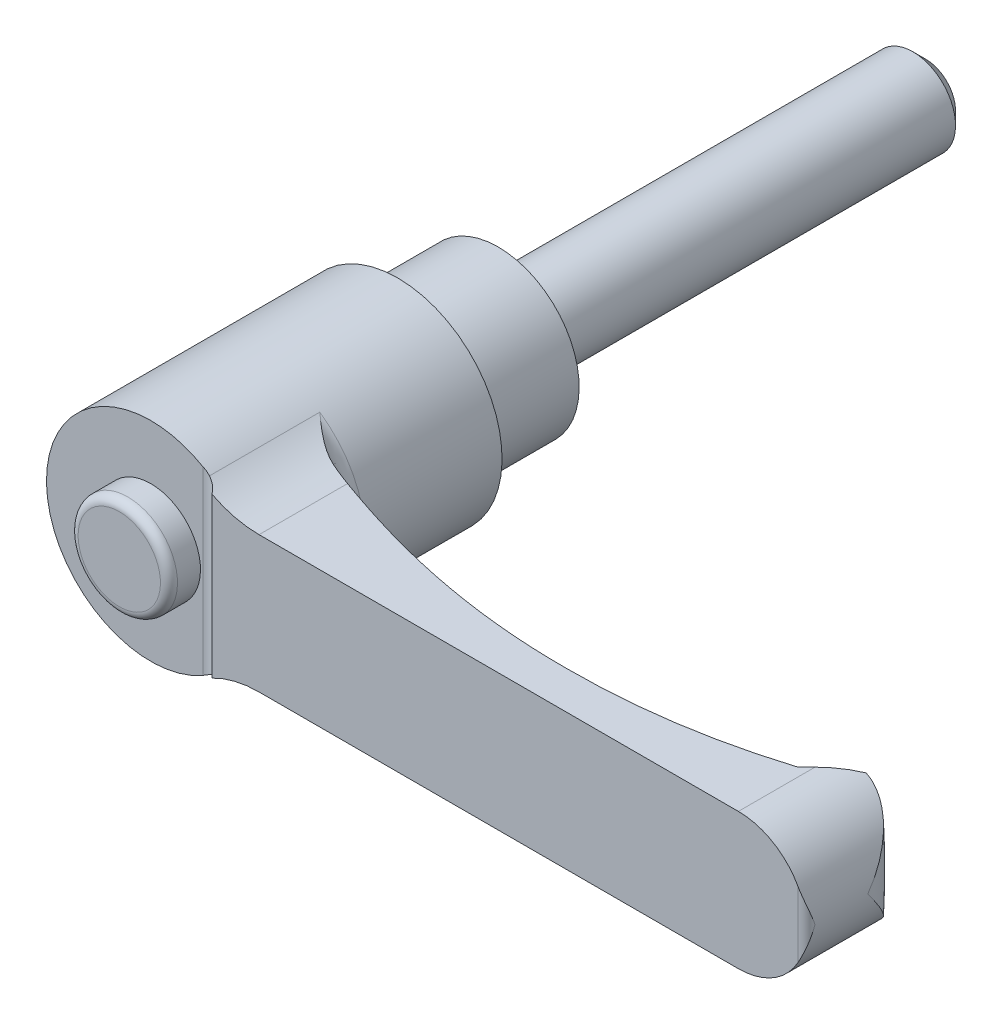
ISO-10303-21;
HEADER;
FILE_DESCRIPTION(('STEP AP214'),'2;1');
FILE_NAME('part.step','',(''),(''),'','','');
FILE_SCHEMA(('AUTOMOTIVE_DESIGN { 1 0 10303 214 1 1 1 1 }'));
ENDSEC;
DATA;
#1=APPLICATION_CONTEXT('core data for automotive mechanical design processes');
#2=APPLICATION_PROTOCOL_DEFINITION('international standard','automotive_design',2000,#1);
#3=PRODUCT_CONTEXT('',#1,'mechanical');
#4=PRODUCT('Part','Part','',(#3));
#5=PRODUCT_RELATED_PRODUCT_CATEGORY('part','',(#4));
#6=PRODUCT_DEFINITION_FORMATION('','',#4);
#7=PRODUCT_DEFINITION_CONTEXT('part definition',#1,'design');
#8=PRODUCT_DEFINITION('design','',#6,#7);
#9=PRODUCT_DEFINITION_SHAPE('','',#8);
#10=(LENGTH_UNIT() NAMED_UNIT(*) SI_UNIT(.MILLI.,.METRE.));
#11=(NAMED_UNIT(*) PLANE_ANGLE_UNIT() SI_UNIT($,.RADIAN.));
#12=(NAMED_UNIT(*) SI_UNIT($,.STERADIAN.) SOLID_ANGLE_UNIT());
#13=UNCERTAINTY_MEASURE_WITH_UNIT(LENGTH_MEASURE(1.E-05),#10,'distance_accuracy_value','');
#14=(GEOMETRIC_REPRESENTATION_CONTEXT(3) GLOBAL_UNCERTAINTY_ASSIGNED_CONTEXT((#13)) GLOBAL_UNIT_ASSIGNED_CONTEXT((#10,
#11,#12)) REPRESENTATION_CONTEXT('',''));
#15=CARTESIAN_POINT('',(0.,0.,0.));
#16=DIRECTION('',(0.,0.,1.));
#17=DIRECTION('',(1.,0.,0.));
#18=AXIS2_PLACEMENT_3D('',#15,#16,#17);
#19=CARTESIAN_POINT('',(7.6,0.,0.));
#20=DIRECTION('',(0.,0.,1.));
#21=DIRECTION('',(0.,-1.,0.));
#22=AXIS2_PLACEMENT_3D('',#19,#20,#21);
#23=PLANE('',#22);
#24=CARTESIAN_POINT('',(0.,0.,0.));
#25=DIRECTION('',(0.,0.,-1.));
#26=DIRECTION('',(0.,1.,0.));
#27=AXIS2_PLACEMENT_3D('',#24,#25,#26);
#28=CIRCLE('',#27,5.);
#29=CARTESIAN_POINT('',(0.,5.,0.));
#30=VERTEX_POINT('',#29);
#31=EDGE_CURVE('E422',#30,#30,#28,.T.);
#32=ORIENTED_EDGE('',*,*,#31,.F.);
#33=EDGE_LOOP('',(#32));
#34=FACE_BOUND('',#33,.T.);
#35=CARTESIAN_POINT('',(0.,0.,0.));
#36=DIRECTION('',(0.,0.,-1.));
#37=DIRECTION('',(0.,1.,0.));
#38=AXIS2_PLACEMENT_3D('',#35,#36,#37);
#39=CIRCLE('',#38,7.6);
#40=CARTESIAN_POINT('',(0.,7.6,0.));
#41=VERTEX_POINT('',#40);
#42=EDGE_CURVE('E347',#41,#41,#39,.T.);
#43=ORIENTED_EDGE('',*,*,#42,.T.);
#44=EDGE_LOOP('',(#43));
#45=FACE_BOUND('',#44,.T.);
#46=ADVANCED_FACE('F14',(#34,#45),#23,.F.);
#47=CARTESIAN_POINT('',(0.,0.,41.));
#48=DIRECTION('',(0.,0.,-1.));
#49=DIRECTION('',(0.,1.,0.));
#50=AXIS2_PLACEMENT_3D('',#47,#48,#49);
#51=PLANE('',#50);
#52=DIRECTION('',(0.,1.,0.));
#53=VECTOR('',#52,1.);
#54=CARTESIAN_POINT('',(6.125,-16.,41.));
#55=LINE('',#54,#53);
#56=CARTESIAN_POINT('',(6.125,-10.6088111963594,41.));
#57=VERTEX_POINT('',#56);
#58=CARTESIAN_POINT('',(6.125,10.6088111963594,41.));
#59=VERTEX_POINT('',#58);
#60=EDGE_CURVE('E385',#57,#59,#55,.T.);
#61=ORIENTED_EDGE('',*,*,#60,.T.);
#62=CARTESIAN_POINT('',(0.,0.,41.));
#63=DIRECTION('',(0.,0.,-1.));
#64=DIRECTION('',(0.,1.,0.));
#65=AXIS2_PLACEMENT_3D('',#62,#63,#64);
#66=CIRCLE('',#65,12.25);
#67=EDGE_CURVE('E332',#57,#59,#66,.T.);
#68=ORIENTED_EDGE('',*,*,#67,.F.);
#69=EDGE_LOOP('',(#61,#68));
#70=FACE_BOUND('',#69,.T.);
#71=CARTESIAN_POINT('',(0.,0.,41.));
#72=DIRECTION('',(0.,0.,-1.));
#73=DIRECTION('',(0.,1.,0.));
#74=AXIS2_PLACEMENT_3D('',#71,#72,#73);
#75=CIRCLE('',#74,5.83333333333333);
#76=CARTESIAN_POINT('',(0.,5.83333333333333,41.));
#77=VERTEX_POINT('',#76);
#78=EDGE_CURVE('E193',#77,#77,#75,.F.);
#79=ORIENTED_EDGE('',*,*,#78,.F.);
#80=EDGE_LOOP('',(#79));
#81=FACE_BOUND('',#80,.T.);
#82=ADVANCED_FACE('F163',(#70,#81),#51,.F.);
#83=CARTESIAN_POINT('',(70.,0.,0.));
#84=DIRECTION('',(0.,0.,1.));
#85=DIRECTION('',(0.,-1.,0.));
#86=AXIS2_PLACEMENT_3D('',#83,#84,#85);
#87=CYLINDRICAL_SURFACE('',#86,8.);
#88=CARTESIAN_POINT('',(78.,0.,34.8));
#89=CARTESIAN_POINT('',(78.0000000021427,-0.00507455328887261,34.7962762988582));
#90=CARTESIAN_POINT('',(77.9999951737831,-0.0101492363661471,34.7925524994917));
#91=CARTESIAN_POINT('',(77.9989416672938,-0.563628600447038,34.3864095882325));
#92=CARTESIAN_POINT('',(77.9414802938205,-1.11346566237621,33.9829298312));
#93=CARTESIAN_POINT('',(77.7692220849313,-1.92787753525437,33.38939297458));
#94=CARTESIAN_POINT('',(77.697249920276,-2.19810314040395,33.1931504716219));
#95=CARTESIAN_POINT('',(77.5237934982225,-2.73341157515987,32.8066637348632));
#96=CARTESIAN_POINT('',(77.4223242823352,-2.99849695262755,32.6164164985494));
#97=CARTESIAN_POINT('',(77.2199237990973,-3.45210642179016,32.2938177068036));
#98=CARTESIAN_POINT('',(77.1259458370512,-3.64233939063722,32.1594598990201));
#99=CARTESIAN_POINT('',(76.9211711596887,-4.01785016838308,31.8966888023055));
#100=CARTESIAN_POINT('',(76.8103745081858,-4.20312799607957,31.7682754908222));
#101=CARTESIAN_POINT('',(76.5717542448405,-4.56719869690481,31.5191542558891));
#102=CARTESIAN_POINT('',(76.4439640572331,-4.74600344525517,31.3984318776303));
#103=CARTESIAN_POINT('',(76.1708976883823,-5.09601175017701,31.1663364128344));
#104=CARTESIAN_POINT('',(76.0256268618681,-5.26721761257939,31.0549604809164));
#105=CARTESIAN_POINT('',(75.6441829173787,-5.67932922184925,30.7937387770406));
#106=CARTESIAN_POINT('',(75.3974573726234,-5.9150123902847,30.6505327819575));
#107=CARTESIAN_POINT('',(74.9987611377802,-6.24839682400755,30.4615945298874));
#108=CARTESIAN_POINT('',(74.8611020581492,-6.35616332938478,30.4029292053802));
#109=CARTESIAN_POINT('',(74.5764070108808,-6.56410843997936,30.2956150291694));
#110=CARTESIAN_POINT('',(74.429373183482,-6.66428876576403,30.2469639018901));
#111=CARTESIAN_POINT('',(74.1592544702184,-6.83522850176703,30.1705684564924));
#112=CARTESIAN_POINT('',(74.0378615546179,-6.90766708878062,30.1405781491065));
#113=CARTESIAN_POINT('',(73.7901015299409,-7.04665102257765,30.0886005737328));
#114=CARTESIAN_POINT('',(73.6637356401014,-7.11319780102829,30.0666113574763));
#115=CARTESIAN_POINT('',(73.4066843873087,-7.23982141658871,30.0315221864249));
#116=CARTESIAN_POINT('',(73.2760017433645,-7.2999022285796,30.0184167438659));
#117=CARTESIAN_POINT('',(73.0110423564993,-7.41312181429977,30.0019547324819));
#118=CARTESIAN_POINT('',(72.8767656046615,-7.46626057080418,29.9985981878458));
#119=CARTESIAN_POINT('',(72.6044130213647,-7.56559501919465,30.0024862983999));
#120=CARTESIAN_POINT('',(72.4663137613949,-7.6117232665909,30.009827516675));
#121=CARTESIAN_POINT('',(72.1887878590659,-7.69611880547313,30.0360283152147));
#122=CARTESIAN_POINT('',(72.0493611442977,-7.73438566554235,30.0548885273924));
#123=CARTESIAN_POINT('',(71.770740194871,-7.80288648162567,30.1046814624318));
#124=CARTESIAN_POINT('',(71.6315458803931,-7.83312431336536,30.1356083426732));
#125=CARTESIAN_POINT('',(71.3550409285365,-7.885663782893,30.2098119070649));
#126=CARTESIAN_POINT('',(71.217729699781,-7.90796796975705,30.2530846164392));
#127=CARTESIAN_POINT('',(70.8920238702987,-7.95241951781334,30.3719934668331));
#128=CARTESIAN_POINT('',(70.7052564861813,-7.97090772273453,30.4536477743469));
#129=CARTESIAN_POINT('',(70.433708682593,-7.98875485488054,30.5937624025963));
#130=CARTESIAN_POINT('',(70.3445710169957,-7.99305594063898,30.6434445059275));
#131=CARTESIAN_POINT('',(70.1696001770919,-7.99868029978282,30.7485120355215));
#132=CARTESIAN_POINT('',(70.0837676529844,-8.00000299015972,30.8038985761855));
#133=CARTESIAN_POINT('',(69.9998,-7.9999999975,30.8620428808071));
#134=B_SPLINE_CURVE_WITH_KNOTS('',3,(#88,#89,#90,#91,#92,#93,#94,#95,#96,#97,#98,#99,#100,#101,
#102,#103,#104,#105,#106,#107,#108,#109,#110,#111,#112,#113,#114,#115,#116,#117,#118,#119,#120,
#121,#122,#123,#124,#125,#126,#127,#128,#129,#130,#131,#132,#133),.UNSPECIFIED.,.F.,.F.,(4,2,2,
2,2,2,2,2,2,2,2,2,2,2,2,2,2,2,2,2,2,2,4),(0.,0.0188831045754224,2.05946970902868,
3.08347088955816,4.10695081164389,4.85978230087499,5.6126109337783,6.36398015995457,
7.11511980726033,8.22062566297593,8.77332293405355,9.32589447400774,9.75904172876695,
10.1920834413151,10.624857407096,11.0576324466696,11.4943381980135,11.9310679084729,
12.3675864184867,12.8039645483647,13.4155655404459,13.721767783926,14.0280299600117),.UNSPECIFIED.);
#135=CARTESIAN_POINT('',(72.9968893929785,-7.41745603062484,30.0031106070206));
#136=VERTEX_POINT('',#135);
#137=CARTESIAN_POINT('',(78.,0.,34.8));
#138=VERTEX_POINT('',#137);
#139=EDGE_CURVE('E126',#136,#138,#134,.F.);
#140=ORIENTED_EDGE('',*,*,#139,.T.);
#141=CARTESIAN_POINT('',(78.,0.,34.8));
#142=CARTESIAN_POINT('',(78.0000000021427,0.00507455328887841,34.7962762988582));
#143=CARTESIAN_POINT('',(77.9999951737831,0.0101492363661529,34.7925524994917));
#144=CARTESIAN_POINT('',(77.9989416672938,0.563628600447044,34.3864095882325));
#145=CARTESIAN_POINT('',(77.9414802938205,1.11346566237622,33.9829298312));
#146=CARTESIAN_POINT('',(77.7692220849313,1.92787753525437,33.38939297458));
#147=CARTESIAN_POINT('',(77.697249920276,2.19810314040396,33.1931504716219));
#148=CARTESIAN_POINT('',(77.5237934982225,2.73341157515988,32.8066637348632));
#149=CARTESIAN_POINT('',(77.4223242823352,2.99849695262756,32.6164164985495));
#150=CARTESIAN_POINT('',(77.2199237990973,3.45210642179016,32.2938177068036));
#151=CARTESIAN_POINT('',(77.1259458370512,3.64233939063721,32.1594598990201));
#152=CARTESIAN_POINT('',(76.9211711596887,4.01785016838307,31.8966888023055));
#153=CARTESIAN_POINT('',(76.8103745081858,4.20312799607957,31.7682754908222));
#154=CARTESIAN_POINT('',(76.5717542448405,4.56719869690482,31.5191542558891));
#155=CARTESIAN_POINT('',(76.4439640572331,4.74600344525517,31.3984318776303));
#156=CARTESIAN_POINT('',(76.1708976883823,5.09601175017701,31.1663364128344));
#157=CARTESIAN_POINT('',(76.0256268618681,5.26721761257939,31.0549604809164));
#158=CARTESIAN_POINT('',(75.6441829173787,5.67932922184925,30.7937387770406));
#159=CARTESIAN_POINT('',(75.3974573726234,5.91501239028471,30.6505327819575));
#160=CARTESIAN_POINT('',(74.9987611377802,6.24839682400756,30.4615945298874));
#161=CARTESIAN_POINT('',(74.8611020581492,6.35616332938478,30.4029292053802));
#162=CARTESIAN_POINT('',(74.5764070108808,6.56410843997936,30.2956150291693));
#163=CARTESIAN_POINT('',(74.429373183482,6.66428876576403,30.2469639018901));
#164=CARTESIAN_POINT('',(74.1592544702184,6.83522850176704,30.1705684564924));
#165=CARTESIAN_POINT('',(74.0378615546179,6.90766708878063,30.1405781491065));
#166=CARTESIAN_POINT('',(73.7901015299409,7.04665102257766,30.0886005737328));
#167=CARTESIAN_POINT('',(73.6637356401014,7.11319780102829,30.0666113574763));
#168=CARTESIAN_POINT('',(73.4066843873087,7.23982141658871,30.0315221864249));
#169=CARTESIAN_POINT('',(73.2760017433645,7.2999022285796,30.0184167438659));
#170=CARTESIAN_POINT('',(73.0110423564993,7.41312181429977,30.0019547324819));
#171=CARTESIAN_POINT('',(72.8767656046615,7.46626057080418,29.9985981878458));
#172=CARTESIAN_POINT('',(72.6044130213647,7.56559501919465,30.0024862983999));
#173=CARTESIAN_POINT('',(72.4663137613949,7.61172326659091,30.009827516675));
#174=CARTESIAN_POINT('',(72.1887878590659,7.69611880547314,30.0360283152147));
#175=CARTESIAN_POINT('',(72.0493611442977,7.73438566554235,30.0548885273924));
#176=CARTESIAN_POINT('',(71.770740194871,7.80288648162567,30.1046814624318));
#177=CARTESIAN_POINT('',(71.6315458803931,7.83312431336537,30.1356083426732));
#178=CARTESIAN_POINT('',(71.3550409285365,7.885663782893,30.2098119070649));
#179=CARTESIAN_POINT('',(71.217729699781,7.90796796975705,30.2530846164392));
#180=CARTESIAN_POINT('',(70.8920238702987,7.95241951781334,30.3719934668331));
#181=CARTESIAN_POINT('',(70.7052564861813,7.97090772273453,30.4536477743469));
#182=CARTESIAN_POINT('',(70.433708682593,7.98875485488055,30.5937624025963));
#183=CARTESIAN_POINT('',(70.3445710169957,7.99305594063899,30.6434445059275));
#184=CARTESIAN_POINT('',(70.1696001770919,7.99868029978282,30.7485120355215));
#185=CARTESIAN_POINT('',(70.0837676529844,8.00000299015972,30.8038985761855));
#186=CARTESIAN_POINT('',(69.9998,7.9999999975,30.8620428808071));
#187=B_SPLINE_CURVE_WITH_KNOTS('',3,(#141,#142,#143,#144,#145,#146,#147,#148,#149,#150,#151,
#152,#153,#154,#155,#156,#157,#158,#159,#160,#161,#162,#163,#164,#165,#166,#167,#168,#169,#170,
#171,#172,#173,#174,#175,#176,#177,#178,#179,#180,#181,#182,#183,#184,#185,#186),.UNSPECIFIED.,
.F.,.F.,(4,2,2,2,2,2,2,2,2,2,2,2,2,2,2,2,2,2,2,2,2,2,4),(0.,0.0188831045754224,2.05946970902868,
3.08347088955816,4.10695081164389,4.85978230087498,5.61261093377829,6.36398015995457,
7.11511980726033,8.22062566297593,8.77332293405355,9.32589447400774,9.75904172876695,
10.1920834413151,10.6248574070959,11.0576324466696,11.4943381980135,11.9310679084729,
12.3675864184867,12.8039645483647,13.4155655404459,13.721767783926,14.0280299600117),.UNSPECIFIED.);
#188=CARTESIAN_POINT('',(72.9968893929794,7.41745603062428,30.0031106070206));
#189=VERTEX_POINT('',#188);
#190=EDGE_CURVE('E123',#138,#189,#187,.T.);
#191=ORIENTED_EDGE('',*,*,#190,.T.);
#192=CARTESIAN_POINT('',(70.,0.,33.));
#193=DIRECTION('',(-0.707106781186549,0.,-0.707106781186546));
#194=DIRECTION('',(-0.707106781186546,0.,0.707106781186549));
#195=AXIS2_PLACEMENT_3D('',#192,#193,#194);
#196=ELLIPSE('',#195,11.3137084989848,8.);
#197=CARTESIAN_POINT('',(70.,8.,33.));
#198=VERTEX_POINT('',#197);
#199=EDGE_CURVE('E378',#189,#198,#196,.F.);
#200=ORIENTED_EDGE('',*,*,#199,.T.);
#201=DIRECTION('',(0.,0.,1.));
#202=VECTOR('',#201,1.);
#203=CARTESIAN_POINT('',(70.,8.,0.));
#204=LINE('',#203,#202);
#205=CARTESIAN_POINT('',(70.,8.,42.));
#206=VERTEX_POINT('',#205);
#207=EDGE_CURVE('E354',#198,#206,#204,.T.);
#208=ORIENTED_EDGE('',*,*,#207,.T.);
#209=CARTESIAN_POINT('',(70.,0.,42.));
#210=DIRECTION('',(0.,0.,1.));
#211=DIRECTION('',(0.,-1.,0.));
#212=AXIS2_PLACEMENT_3D('',#209,#210,#211);
#213=CIRCLE('',#212,8.);
#214=CARTESIAN_POINT('',(77.,3.87298334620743,42.));
#215=VERTEX_POINT('',#214);
#216=EDGE_CURVE('E327',#215,#206,#213,.T.);
#217=ORIENTED_EDGE('',*,*,#216,.F.);
#218=CARTESIAN_POINT('',(77.,3.87298334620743,42.));
#219=CARTESIAN_POINT('',(77.0320487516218,3.8150611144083,41.9999909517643));
#220=CARTESIAN_POINT('',(77.0633658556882,3.75675902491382,41.9984605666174));
#221=CARTESIAN_POINT('',(77.1244803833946,3.63952511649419,41.99269833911));
#222=CARTESIAN_POINT('',(77.1542784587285,3.58059358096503,41.9884676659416));
#223=CARTESIAN_POINT('',(77.241218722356,3.40324230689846,41.9722589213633));
#224=CARTESIAN_POINT('',(77.2960525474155,3.28400247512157,41.9567609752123));
#225=CARTESIAN_POINT('',(77.3991566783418,3.04456972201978,41.9185214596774));
#226=CARTESIAN_POINT('',(77.4474555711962,2.9243835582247,41.8958129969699));
#227=CARTESIAN_POINT('',(77.5378429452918,2.68282861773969,41.8446429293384));
#228=CARTESIAN_POINT('',(77.5799268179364,2.56145903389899,41.8161770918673));
#229=CARTESIAN_POINT('',(77.6827368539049,2.24038507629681,41.7351721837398));
#230=CARTESIAN_POINT('',(77.7382927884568,2.03996193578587,41.6788382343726));
#231=CARTESIAN_POINT('',(77.8332865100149,1.63779800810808,41.55814944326));
#232=CARTESIAN_POINT('',(77.8727175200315,1.43605670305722,41.4937912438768));
#233=CARTESIAN_POINT('',(77.967421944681,0.829293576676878,41.2932012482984));
#234=CARTESIAN_POINT('',(77.999127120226,0.42266785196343,41.1494356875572));
#235=CARTESIAN_POINT('',(77.9999940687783,0.0112434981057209,41.0039751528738));
#236=CARTESIAN_POINT('',(77.9999999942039,0.00562166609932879,41.0019875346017));
#237=CARTESIAN_POINT('',(78.,0.,41.));
#238=B_SPLINE_CURVE_WITH_KNOTS('',3,(#218,#219,#220,#221,#222,#223,#224,#225,#226,#227,#228,
#229,#230,#231,#232,#233,#234,#235,#236,#237),.UNSPECIFIED.,.F.,.F.,(4,2,2,2,2,2,2,2,2,4),(0.,
0.198535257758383,0.396984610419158,0.792983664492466,1.18719018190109,1.5816875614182,
2.22713013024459,2.8728436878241,4.16406208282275,4.18195063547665),.UNSPECIFIED.);
#239=CARTESIAN_POINT('',(78.,0.,41.));
#240=VERTEX_POINT('',#239);
#241=EDGE_CURVE('E179',#240,#215,#238,.F.);
#242=ORIENTED_EDGE('',*,*,#241,.F.);
#243=CARTESIAN_POINT('',(77.,-3.87298334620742,42.));
#244=CARTESIAN_POINT('',(77.0320487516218,-3.81506111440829,41.9999909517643));
#245=CARTESIAN_POINT('',(77.0633658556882,-3.75675902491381,41.9984605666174));
#246=CARTESIAN_POINT('',(77.1244803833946,-3.63952511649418,41.99269833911));
#247=CARTESIAN_POINT('',(77.1542784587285,-3.58059358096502,41.9884676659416));
#248=CARTESIAN_POINT('',(77.241218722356,-3.40324230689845,41.9722589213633));
#249=CARTESIAN_POINT('',(77.2960525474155,-3.28400247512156,41.9567609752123));
#250=CARTESIAN_POINT('',(77.3991566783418,-3.04456972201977,41.9185214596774));
#251=CARTESIAN_POINT('',(77.4474555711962,-2.92438355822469,41.8958129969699));
#252=CARTESIAN_POINT('',(77.5378429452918,-2.68282861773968,41.8446429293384));
#253=CARTESIAN_POINT('',(77.5799268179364,-2.56145903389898,41.8161770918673));
#254=CARTESIAN_POINT('',(77.6827368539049,-2.2403850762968,41.7351721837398));
#255=CARTESIAN_POINT('',(77.7382927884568,-2.03996193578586,41.6788382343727));
#256=CARTESIAN_POINT('',(77.8332865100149,-1.63779800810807,41.55814944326));
#257=CARTESIAN_POINT('',(77.8727175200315,-1.43605670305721,41.4937912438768));
#258=CARTESIAN_POINT('',(77.967421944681,-0.829293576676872,41.2932012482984));
#259=CARTESIAN_POINT('',(77.999127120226,-0.422667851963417,41.1494356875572));
#260=CARTESIAN_POINT('',(77.9999940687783,-0.0112434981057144,41.0039751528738));
#261=CARTESIAN_POINT('',(77.9999999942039,-0.00562166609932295,41.0019875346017));
#262=CARTESIAN_POINT('',(78.,0.,41.));
#263=B_SPLINE_CURVE_WITH_KNOTS('',3,(#243,#244,#245,#246,#247,#248,#249,#250,#251,#252,#253,
#254,#255,#256,#257,#258,#259,#260,#261,#262),.UNSPECIFIED.,.F.,.F.,(4,2,2,2,2,2,2,2,2,4),(0.,
0.19853525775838,0.396984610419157,0.792983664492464,1.18719018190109,1.5816875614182,
2.2271301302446,2.8728436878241,4.16406208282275,4.18195063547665),.UNSPECIFIED.);
#264=CARTESIAN_POINT('',(77.,-3.87298334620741,42.));
#265=VERTEX_POINT('',#264);
#266=EDGE_CURVE('E187',#265,#240,#263,.T.);
#267=ORIENTED_EDGE('',*,*,#266,.F.);
#268=CARTESIAN_POINT('',(70.,-8.,42.));
#269=VERTEX_POINT('',#268);
#270=EDGE_CURVE('E322',#269,#265,#213,.T.);
#271=ORIENTED_EDGE('',*,*,#270,.F.);
#272=DIRECTION('',(0.,0.,1.));
#273=VECTOR('',#272,1.);
#274=CARTESIAN_POINT('',(70.,-8.,0.));
#275=LINE('',#274,#273);
#276=CARTESIAN_POINT('',(70.,-8.,33.));
#277=VERTEX_POINT('',#276);
#278=EDGE_CURVE('E357',#277,#269,#275,.T.);
#279=ORIENTED_EDGE('',*,*,#278,.F.);
#280=EDGE_CURVE('E137',#277,#136,#196,.F.);
#281=ORIENTED_EDGE('',*,*,#280,.T.);
#282=EDGE_LOOP('',(#140,#191,#200,#208,#217,#242,#267,#271,#279,#281));
#283=FACE_BOUND('',#282,.T.);
#284=ADVANCED_FACE('F135',(#283),#87,.T.);
#285=CARTESIAN_POINT('',(73.,-16.,30.));
#286=DIRECTION('',(-0.707106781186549,0.,-0.707106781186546));
#287=DIRECTION('',(0.707106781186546,0.,-0.707106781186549));
#288=AXIS2_PLACEMENT_3D('',#285,#286,#287);
#289=PLANE('',#288);
#290=DIRECTION('',(0.,1.,0.));
#291=VECTOR('',#290,1.);
#292=CARTESIAN_POINT('',(73.,-16.,30.));
#293=LINE('',#292,#291);
#294=CARTESIAN_POINT('',(73.,-5.40740233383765,30.));
#295=VERTEX_POINT('',#294);
#296=CARTESIAN_POINT('',(73.,5.40740233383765,30.));
#297=VERTEX_POINT('',#296);
#298=EDGE_CURVE('E397',#295,#297,#293,.T.);
#299=ORIENTED_EDGE('',*,*,#298,.F.);
#300=CARTESIAN_POINT('',(72.9944134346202,8.0002,30.0055865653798));
#301=CARTESIAN_POINT('',(72.9964174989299,7.60019527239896,30.0035825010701));
#302=CARTESIAN_POINT('',(72.9977626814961,7.20018596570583,30.0022373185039));
#303=CARTESIAN_POINT('',(72.9994970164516,6.40016550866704,30.0005029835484));
#304=CARTESIAN_POINT('',(72.9998861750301,6.00015435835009,30.0001138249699));
#305=CARTESIAN_POINT('',(73.0000702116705,5.20013335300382,29.9999297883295));
#306=CARTESIAN_POINT('',(72.9998650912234,4.80012349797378,30.0001349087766));
#307=CARTESIAN_POINT('',(72.9991717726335,4.00010369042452,30.0008282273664));
#308=CARTESIAN_POINT('',(72.998683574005,3.60009373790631,30.001316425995));
#309=CARTESIAN_POINT('',(72.9972116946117,2.40006658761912,30.0027883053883));
#310=CARTESIAN_POINT('',(72.9962207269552,1.60004928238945,30.0037792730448));
#311=CARTESIAN_POINT('',(72.9954610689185,1.3601944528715E-05,30.0045389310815));
#312=CARTESIAN_POINT('',(72.9956923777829,-0.800004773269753,30.004307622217));
#313=CARTESIAN_POINT('',(72.9968584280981,-2.13336982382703,30.0031415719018));
#314=CARTESIAN_POINT('',(72.9975329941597,-2.66671710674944,30.0024670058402));
#315=CARTESIAN_POINT('',(72.9988528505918,-3.73341119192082,30.0011471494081));
#316=CARTESIAN_POINT('',(72.999498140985,-4.26675799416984,30.000501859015));
#317=CARTESIAN_POINT('',(73.000124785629,-5.33345534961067,29.999875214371));
#318=CARTESIAN_POINT('',(73.0001061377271,-5.86680590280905,29.9998938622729));
#319=CARTESIAN_POINT('',(72.9985813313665,-6.93350631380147,30.0014186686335));
#320=CARTESIAN_POINT('',(72.997075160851,-7.46685617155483,30.002924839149));
#321=CARTESIAN_POINT('',(72.9944134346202,-8.0002,30.0055865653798));
#322=B_SPLINE_CURVE_WITH_KNOTS('',3,(#300,#301,#302,#303,#304,#305,#306,#307,#308,#309,#310,
#311,#312,#313,#314,#315,#316,#317,#318,#319,#320,#321),.UNSPECIFIED.,.F.,.F.,(4,2,2,2,2,2,2,2,
2,2,4),(0.,1.20004037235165,2.40007297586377,3.60010256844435,4.80013422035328,7.20018907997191,
9.60024245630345,11.2002867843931,12.8003298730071,14.4003781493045,16.0004393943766),.UNSPECIFIED.);
#323=EDGE_CURVE('E138',#295,#136,#322,.T.);
#324=ORIENTED_EDGE('',*,*,#323,.T.);
#325=ORIENTED_EDGE('',*,*,#280,.F.);
#326=DIRECTION('',(-0.707106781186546,0.,0.707106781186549));
#327=VECTOR('',#326,1.);
#328=CARTESIAN_POINT('',(86.5,-8.,16.5));
#329=LINE('',#328,#327);
#330=CARTESIAN_POINT('',(69.,-8.,34.));
#331=VERTEX_POINT('',#330);
#332=EDGE_CURVE('E321',#277,#331,#329,.T.);
#333=ORIENTED_EDGE('',*,*,#332,.T.);
#334=DIRECTION('',(0.,1.,0.));
#335=VECTOR('',#334,1.);
#336=CARTESIAN_POINT('',(69.,-16.,34.));
#337=LINE('',#336,#335);
#338=CARTESIAN_POINT('',(69.,8.,34.));
#339=VERTEX_POINT('',#338);
#340=EDGE_CURVE('E319',#331,#339,#337,.T.);
#341=ORIENTED_EDGE('',*,*,#340,.T.);
#342=DIRECTION('',(0.707106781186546,0.,-0.707106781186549));
#343=VECTOR('',#342,1.);
#344=CARTESIAN_POINT('',(58.3567940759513,8.,44.6432059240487));
#345=LINE('',#344,#343);
#346=EDGE_CURVE('E375',#339,#198,#345,.T.);
#347=ORIENTED_EDGE('',*,*,#346,.T.);
#348=ORIENTED_EDGE('',*,*,#199,.F.);
#349=EDGE_CURVE('E129',#189,#297,#322,.T.);
#350=ORIENTED_EDGE('',*,*,#349,.T.);
#351=EDGE_LOOP('',(#299,#324,#325,#333,#341,#347,#348,#350));
#352=FACE_BOUND('',#351,.T.);
#353=ADVANCED_FACE('F162',(#352),#289,.T.);
#354=CARTESIAN_POINT('',(73.2,-16.,30.));
#355=DIRECTION('',(0.,0.,-1.));
#356=DIRECTION('',(0.,1.,0.));
#357=AXIS2_PLACEMENT_3D('',#354,#355,#356);
#358=PLANE('',#357);
#359=ORIENTED_EDGE('',*,*,#298,.T.);
#360=CARTESIAN_POINT('',(0.,0.,30.));
#361=DIRECTION('',(0.,0.,-1.));
#362=DIRECTION('',(0.,1.,0.));
#363=AXIS2_PLACEMENT_3D('',#360,#361,#362);
#364=CIRCLE('',#363,73.2);
#365=EDGE_CURVE('E36',#297,#295,#364,.T.);
#366=ORIENTED_EDGE('',*,*,#365,.T.);
#367=EDGE_LOOP('',(#359,#366));
#368=FACE_BOUND('',#367,.T.);
#369=ADVANCED_FACE('F201',(#368),#358,.T.);
#370=CARTESIAN_POINT('',(0.,0.,42.));
#371=DIRECTION('',(0.,0.,1.));
#372=DIRECTION('',(0.,-1.,0.));
#373=AXIS2_PLACEMENT_3D('',#370,#371,#372);
#374=PLANE('',#373);
#375=CARTESIAN_POINT('',(13.7135881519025,20.,42.));
#376=DIRECTION('',(0.,0.,1.));
#377=DIRECTION('',(1.,0.,0.));
#378=AXIS2_PLACEMENT_3D('',#375,#376,#377);
#379=CIRCLE('',#378,12.);
#380=CARTESIAN_POINT('',(8.16666666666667,9.35896330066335,42.));
#381=VERTEX_POINT('',#380);
#382=CARTESIAN_POINT('',(13.7135881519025,8.,42.));
#383=VERTEX_POINT('',#382);
#384=EDGE_CURVE('E372',#381,#383,#379,.T.);
#385=ORIENTED_EDGE('',*,*,#384,.F.);
#386=DIRECTION('',(0.,1.,0.));
#387=VECTOR('',#386,1.);
#388=CARTESIAN_POINT('',(8.16666666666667,-16.,42.));
#389=LINE('',#388,#387);
#390=CARTESIAN_POINT('',(8.16666666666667,-9.35896330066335,42.));
#391=VERTEX_POINT('',#390);
#392=EDGE_CURVE('E392',#391,#381,#389,.T.);
#393=ORIENTED_EDGE('',*,*,#392,.F.);
#394=CARTESIAN_POINT('',(13.7135881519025,-20.,42.));
#395=DIRECTION('',(0.,0.,1.));
#396=DIRECTION('',(1.,0.,0.));
#397=AXIS2_PLACEMENT_3D('',#394,#395,#396);
#398=CIRCLE('',#397,12.);
#399=CARTESIAN_POINT('',(13.7135881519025,-8.,42.));
#400=VERTEX_POINT('',#399);
#401=EDGE_CURVE('E363',#400,#391,#398,.T.);
#402=ORIENTED_EDGE('',*,*,#401,.F.);
#403=DIRECTION('',(-1.,0.,0.));
#404=VECTOR('',#403,1.);
#405=CARTESIAN_POINT('',(70.,-8.,42.));
#406=LINE('',#405,#404);
#407=EDGE_CURVE('E366',#269,#400,#406,.T.);
#408=ORIENTED_EDGE('',*,*,#407,.F.);
#409=ORIENTED_EDGE('',*,*,#270,.T.);
#410=DIRECTION('',(0.,1.,0.));
#411=VECTOR('',#410,1.);
#412=CARTESIAN_POINT('',(77.,-16.,42.));
#413=LINE('',#412,#411);
#414=EDGE_CURVE('E393',#265,#215,#413,.T.);
#415=ORIENTED_EDGE('',*,*,#414,.T.);
#416=ORIENTED_EDGE('',*,*,#216,.T.);
#417=DIRECTION('',(1.,0.,0.));
#418=VECTOR('',#417,1.);
#419=CARTESIAN_POINT('',(13.7135881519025,8.,42.));
#420=LINE('',#419,#418);
#421=EDGE_CURVE('E369',#383,#206,#420,.T.);
#422=ORIENTED_EDGE('',*,*,#421,.F.);
#423=EDGE_LOOP('',(#385,#393,#402,#408,#409,#415,#416,#422));
#424=FACE_BOUND('',#423,.T.);
#425=ADVANCED_FACE('F248',(#424),#374,.T.);
#426=CARTESIAN_POINT('',(0.,0.,0.));
#427=DIRECTION('',(0.,0.,-1.));
#428=DIRECTION('',(0.,1.,0.));
#429=AXIS2_PLACEMENT_3D('',#426,#427,#428);
#430=CYLINDRICAL_SURFACE('',#429,12.25);
#431=CARTESIAN_POINT('',(0.,0.,28.0779919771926));
#432=DIRECTION('',(0.,0.,-1.));
#433=DIRECTION('',(0.,1.,0.));
#434=AXIS2_PLACEMENT_3D('',#431,#432,#433);
#435=CIRCLE('',#434,12.25);
#436=CARTESIAN_POINT('',(6.92748267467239,10.1030927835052,28.0779919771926));
#437=VERTEX_POINT('',#436);
#438=CARTESIAN_POINT('',(6.92748267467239,-10.1030927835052,28.0779919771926));
#439=VERTEX_POINT('',#438);
#440=EDGE_CURVE('E412',#437,#439,#435,.T.);
#441=ORIENTED_EDGE('',*,*,#440,.T.);
#442=DIRECTION('',(0.,0.,1.));
#443=VECTOR('',#442,1.);
#444=CARTESIAN_POINT('',(6.92748267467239,-10.1030927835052,0.));
#445=LINE('',#444,#443);
#446=CARTESIAN_POINT('',(6.92748267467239,-10.1030927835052,41.0427567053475));
#447=VERTEX_POINT('',#446);
#448=EDGE_CURVE('E361',#439,#447,#445,.T.);
#449=ORIENTED_EDGE('',*,*,#448,.T.);
#450=CARTESIAN_POINT('',(6.125,-10.6088111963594,41.));
#451=CARTESIAN_POINT('',(6.19832883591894,-10.5664875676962,40.9889897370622));
#452=CARTESIAN_POINT('',(6.27164451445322,-10.523132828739,40.9821479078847));
#453=CARTESIAN_POINT('',(6.41753908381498,-10.4347921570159,40.9764986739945));
#454=CARTESIAN_POINT('',(6.49011843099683,-10.3898073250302,40.9776859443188));
#455=CARTESIAN_POINT('',(6.63402897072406,-10.2985167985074,40.9877856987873));
#456=CARTESIAN_POINT('',(6.70535828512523,-10.2522093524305,40.996708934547));
#457=CARTESIAN_POINT('',(6.84611057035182,-10.1587605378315,41.0220012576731));
#458=CARTESIAN_POINT('',(6.91553331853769,-10.1116190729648,41.0383712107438));
#459=CARTESIAN_POINT('',(7.10641045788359,-9.97916014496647,41.094233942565));
#460=CARTESIAN_POINT('',(7.22525798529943,-9.89334730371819,41.1417583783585));
#461=CARTESIAN_POINT('',(7.45241295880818,-9.72337963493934,41.2589427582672));
#462=CARTESIAN_POINT('',(7.56074253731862,-9.63922163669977,41.3285548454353));
#463=CARTESIAN_POINT('',(7.71168483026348,-9.51821587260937,41.4479066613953));
#464=CARTESIAN_POINT('',(7.75936397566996,-9.47936365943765,41.4893658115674));
#465=CARTESIAN_POINT('',(7.85125896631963,-9.40339173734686,41.5773725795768));
#466=CARTESIAN_POINT('',(7.89547657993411,-9.36627114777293,41.6239175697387));
#467=CARTESIAN_POINT('',(7.98020904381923,-9.29418452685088,41.7223463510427));
#468=CARTESIAN_POINT('',(8.02070494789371,-9.25922978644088,41.7742548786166));
#469=CARTESIAN_POINT('',(8.09722101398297,-9.19239515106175,41.8832605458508));
#470=CARTESIAN_POINT('',(8.13323329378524,-9.16052069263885,41.9403665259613));
#471=CARTESIAN_POINT('',(8.16666666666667,-9.13061090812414,42.));
#472=B_SPLINE_CURVE_WITH_KNOTS('',3,(#450,#451,#452,#453,#454,#455,#456,#457,#458,#459,#460,
#461,#462,#463,#464,#465,#466,#467,#468,#469,#470,#471),.UNSPECIFIED.,.F.,.F.,(4,2,2,2,2,2,2,2,
2,2,4),(0.,0.255975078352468,0.511780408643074,0.767941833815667,1.02413304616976,
1.48441304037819,1.94370248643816,2.16599787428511,2.38817894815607,2.61143478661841,
2.83507772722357),.UNSPECIFIED.);
#473=EDGE_CURVE('E222',#57,#447,#472,.T.);
#474=ORIENTED_EDGE('',*,*,#473,.F.);
#475=ORIENTED_EDGE('',*,*,#67,.T.);
#476=CARTESIAN_POINT('',(8.16666666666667,9.13061090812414,42.));
#477=CARTESIAN_POINT('',(8.13602850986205,9.15801692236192,41.9453523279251));
#478=CARTESIAN_POINT('',(8.10323346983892,9.18706943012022,41.8928397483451));
#479=CARTESIAN_POINT('',(8.03382107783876,9.24782874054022,41.7921703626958));
#480=CARTESIAN_POINT('',(7.99720910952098,9.27953179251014,41.7440075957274));
#481=CARTESIAN_POINT('',(7.88274220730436,9.37735907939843,41.6065497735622));
#482=CARTESIAN_POINT('',(7.79984772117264,9.44657197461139,41.5235775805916));
#483=CARTESIAN_POINT('',(7.62397737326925,9.58906879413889,41.3751924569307));
#484=CARTESIAN_POINT('',(7.53106018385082,9.66232791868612,41.3096843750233));
#485=CARTESIAN_POINT('',(7.33643153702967,9.81092784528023,41.1955319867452));
#486=CARTESIAN_POINT('',(7.23469620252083,9.88627389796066,41.1469353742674));
#487=CARTESIAN_POINT('',(7.00601089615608,10.0499435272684,41.0604339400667));
#488=CARTESIAN_POINT('',(6.87776073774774,10.1382349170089,41.0258797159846));
#489=CARTESIAN_POINT('',(6.61511692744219,10.3115145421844,40.9827504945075));
#490=CARTESIAN_POINT('',(6.48074133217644,10.3965112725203,40.9741035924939));
#491=CARTESIAN_POINT('',(6.30869788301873,10.5006996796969,40.9806991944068));
#492=CARTESIAN_POINT('',(6.27199131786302,10.5226640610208,40.9831161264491));
#493=CARTESIAN_POINT('',(6.19852568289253,10.5661055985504,40.9900077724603));
#494=CARTESIAN_POINT('',(6.16176668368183,10.5875831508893,40.9944807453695));
#495=CARTESIAN_POINT('',(6.125,10.6088111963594,41.));
#496=B_SPLINE_CURVE_WITH_KNOTS('',3,(#476,#477,#478,#479,#480,#481,#482,#483,#484,#485,#486,
#487,#488,#489,#490,#491,#492,#493,#494,#495),.UNSPECIFIED.,.F.,.F.,(4,2,2,2,2,2,2,2,2,4),(0.,
0.204930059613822,0.409574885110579,0.816210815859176,1.22058373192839,1.62608799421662,
2.10242753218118,2.57744378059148,2.7059409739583,2.83432955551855),.UNSPECIFIED.);
#497=CARTESIAN_POINT('',(6.92748267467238,10.1030927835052,41.0427567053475));
#498=VERTEX_POINT('',#497);
#499=EDGE_CURVE('E236',#498,#59,#496,.T.);
#500=ORIENTED_EDGE('',*,*,#499,.F.);
#501=DIRECTION('',(0.,0.,1.));
#502=VECTOR('',#501,1.);
#503=CARTESIAN_POINT('',(6.92748267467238,10.1030927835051,0.));
#504=LINE('',#503,#502);
#505=EDGE_CURVE('E350',#437,#498,#504,.T.);
#506=ORIENTED_EDGE('',*,*,#505,.F.);
#507=EDGE_LOOP('',(#441,#449,#474,#475,#500,#506));
#508=FACE_BOUND('',#507,.T.);
#509=CARTESIAN_POINT('',(0.,0.,12.));
#510=DIRECTION('',(0.,0.,-1.));
#511=DIRECTION('',(0.,1.,0.));
#512=AXIS2_PLACEMENT_3D('',#509,#510,#511);
#513=CIRCLE('',#512,12.25);
#514=CARTESIAN_POINT('',(0.,12.25,12.));
#515=VERTEX_POINT('',#514);
#516=EDGE_CURVE('E335',#515,#515,#513,.T.);
#517=ORIENTED_EDGE('',*,*,#516,.F.);
#518=EDGE_LOOP('',(#517));
#519=FACE_BOUND('',#518,.T.);
#520=ADVANCED_FACE('F246',(#508,#519),#430,.T.);
#521=CARTESIAN_POINT('',(13.7135881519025,20.,0.));
#522=DIRECTION('',(0.,0.,1.));
#523=DIRECTION('',(0.,-1.,0.));
#524=AXIS2_PLACEMENT_3D('',#521,#522,#523);
#525=CYLINDRICAL_SURFACE('',#524,12.);
#526=DIRECTION('',(0.,0.,1.));
#527=VECTOR('',#526,1.);
#528=CARTESIAN_POINT('',(13.7135881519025,8.,0.));
#529=LINE('',#528,#527);
#530=CARTESIAN_POINT('',(13.7135881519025,8.,31.611749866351));
#531=VERTEX_POINT('',#530);
#532=EDGE_CURVE('E352',#531,#383,#529,.T.);
#533=ORIENTED_EDGE('',*,*,#532,.F.);
#534=CARTESIAN_POINT('',(16.5591435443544,8.34226374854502,32.6591102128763));
#535=CARTESIAN_POINT('',(16.3261928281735,8.28540329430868,32.5722424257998));
#536=CARTESIAN_POINT('',(16.0917373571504,8.23557224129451,32.4848250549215));
#537=CARTESIAN_POINT('',(15.6204190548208,8.15004770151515,32.3095064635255));
#538=CARTESIAN_POINT('',(15.3835560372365,8.11435531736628,32.2216052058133));
#539=CARTESIAN_POINT('',(14.9085098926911,8.05724969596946,32.0461136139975));
#540=CARTESIAN_POINT('',(14.6703300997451,8.03580964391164,31.9585230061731));
#541=CARTESIAN_POINT('',(14.1928153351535,8.00718735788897,31.7842679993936));
#542=CARTESIAN_POINT('',(13.9534804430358,8.00000415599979,31.697603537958));
#543=CARTESIAN_POINT('',(13.3222890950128,7.99999321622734,31.4717100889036));
#544=CARTESIAN_POINT('',(12.9298365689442,8.01913869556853,31.3339527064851));
#545=CARTESIAN_POINT('',(12.1446747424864,8.09645283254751,31.0677464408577));
#546=CARTESIAN_POINT('',(11.7519664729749,8.15469870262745,30.9393165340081));
#547=CARTESIAN_POINT('',(11.0678445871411,8.29148603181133,30.7286186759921));
#548=CARTESIAN_POINT('',(10.7757440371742,8.36126529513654,30.6428547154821));
#549=CARTESIAN_POINT('',(10.1944299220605,8.52365043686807,30.4833757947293));
#550=CARTESIAN_POINT('',(9.90521727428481,8.61626334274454,30.4096645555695));
#551=CARTESIAN_POINT('',(9.33232622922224,8.82426158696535,30.2779606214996));
#552=CARTESIAN_POINT('',(9.04863462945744,8.93958259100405,30.219924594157));
#553=CARTESIAN_POINT('',(8.48843633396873,9.19295718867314,30.1227055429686));
#554=CARTESIAN_POINT('',(8.21192433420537,9.33099341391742,30.0835082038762));
#555=CARTESIAN_POINT('',(7.70530850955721,9.60902203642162,30.0304308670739));
#556=CARTESIAN_POINT('',(7.47397220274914,9.74624410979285,30.0138509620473));
#557=CARTESIAN_POINT('',(7.13386740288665,9.96379307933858,30.0017184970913));
#558=CARTESIAN_POINT('',(7.0215618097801,10.0383265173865,29.9998008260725));
#559=CARTESIAN_POINT('',(6.79949902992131,10.1911494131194,30.0002323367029));
#560=CARTESIAN_POINT('',(6.68974254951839,10.2694398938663,30.0025826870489));
#561=CARTESIAN_POINT('',(6.5813815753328,10.3495269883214,30.007070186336));
#562=B_SPLINE_CURVE_WITH_KNOTS('',3,(#534,#535,#536,#537,#538,#539,#540,#541,#542,#543,#544,
#545,#546,#547,#548,#549,#550,#551,#552,#553,#554,#555,#556,#557,#558,#559,#560,#561),
.UNSPECIFIED.,.F.,.F.,(4,2,2,2,2,2,2,2,2,2,2,2,2,4),(0.,0.765007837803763,1.53007532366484,
2.29369928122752,3.05727139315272,4.30444442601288,5.55408755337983,6.49010923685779,
7.42641935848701,8.36011402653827,9.29309806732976,10.100354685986,10.5046318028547,
10.9090196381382),.UNSPECIFIED.);
#563=CARTESIAN_POINT('',(11.361472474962,8.23277637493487,30.8190510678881));
#564=VERTEX_POINT('',#563);
#565=EDGE_CURVE('E262',#531,#564,#562,.T.);
#566=ORIENTED_EDGE('',*,*,#565,.T.);
#567=CARTESIAN_POINT('',(14.1569924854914,8.00819477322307,30.9010555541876));
#568=CARTESIAN_POINT('',(14.0595029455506,8.00457612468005,30.9322196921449));
#569=CARTESIAN_POINT('',(13.9606253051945,8.00212380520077,30.9590151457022));
#570=CARTESIAN_POINT('',(13.7610637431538,7.99968329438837,31.004218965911));
#571=CARTESIAN_POINT('',(13.6603822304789,7.99969203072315,31.0226377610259));
#572=CARTESIAN_POINT('',(13.4585847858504,8.00228706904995,31.0514218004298));
#573=CARTESIAN_POINT('',(13.3574757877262,8.00485682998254,31.061837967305));
#574=CARTESIAN_POINT('',(13.1548462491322,8.01258614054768,31.0753001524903));
#575=CARTESIAN_POINT('',(13.053325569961,8.01774665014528,31.0783434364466));
#576=CARTESIAN_POINT('',(12.8251352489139,8.0322613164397,31.0774805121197));
#577=CARTESIAN_POINT('',(12.6985166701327,8.04234092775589,31.07164895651));
#578=CARTESIAN_POINT('',(12.446446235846,8.06641586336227,31.0503579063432));
#579=CARTESIAN_POINT('',(12.3209952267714,8.08041382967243,31.0348919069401));
#580=CARTESIAN_POINT('',(11.9473264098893,8.12804907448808,30.9756133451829));
#581=CARTESIAN_POINT('',(11.7017310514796,8.16733172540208,30.9189189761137));
#582=CARTESIAN_POINT('',(11.4284283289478,8.21954129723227,30.8393902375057));
#583=CARTESIAN_POINT('',(11.3952261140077,8.22603104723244,30.829444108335));
#584=CARTESIAN_POINT('',(11.1613640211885,8.27276596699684,30.7574361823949));
#585=CARTESIAN_POINT('',(10.9642103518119,8.31751135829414,30.6865405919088));
#586=CARTESIAN_POINT('',(10.5777285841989,8.41525886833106,30.5303701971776));
#587=CARTESIAN_POINT('',(10.3884095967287,8.46827027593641,30.4450792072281));
#588=CARTESIAN_POINT('',(10.0168146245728,8.5819543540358,30.262829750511));
#589=CARTESIAN_POINT('',(9.83457244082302,8.64265900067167,30.1658226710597));
#590=CARTESIAN_POINT('',(9.47767438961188,8.77088665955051,29.9630240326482));
#591=CARTESIAN_POINT('',(9.30301613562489,8.83840750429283,29.8572352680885));
#592=CARTESIAN_POINT('',(8.93248691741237,8.99147577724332,29.6209801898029));
#593=CARTESIAN_POINT('',(8.73785326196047,9.07816138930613,29.4893172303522));
#594=CARTESIAN_POINT('',(8.35703282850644,9.25980318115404,29.2196101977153));
#595=CARTESIAN_POINT('',(8.17084790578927,9.35476116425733,29.0815647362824));
#596=CARTESIAN_POINT('',(7.80639286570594,9.55261034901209,28.801722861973));
#597=CARTESIAN_POINT('',(7.62810747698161,9.65548508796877,28.6599346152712));
#598=CARTESIAN_POINT('',(7.27822148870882,9.8694475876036,28.3744148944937));
#599=CARTESIAN_POINT('',(7.10661929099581,9.98053336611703,28.2306838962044));
#600=CARTESIAN_POINT('',(6.93448645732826,10.0982931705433,28.0839649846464));
#601=CARTESIAN_POINT('',(6.93098392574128,10.1006920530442,28.0809784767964));
#602=CARTESIAN_POINT('',(6.92748267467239,10.1030927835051,28.0779919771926));
#603=B_SPLINE_CURVE_WITH_KNOTS('',3,(#567,#568,#569,#570,#571,#572,#573,#574,#575,#576,#577,
#578,#579,#580,#581,#582,#583,#584,#585,#586,#587,#588,#589,#590,#591,#592,#593,#594,#595,#596,
#597,#598,#599,#600,#601,#602),.UNSPECIFIED.,.F.,.F.,(4,2,2,2,2,2,2,2,2,2,2,2,2,2,2,2,2,4),(0.,
0.307060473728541,0.613737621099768,0.918446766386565,1.2232689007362,1.60421628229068,
1.98542114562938,2.74764704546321,2.85344139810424,3.49502286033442,4.13733056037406,
4.78240133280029,5.42726761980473,6.17822336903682,6.9293432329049,7.67894130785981,
8.42835901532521,8.44393060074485),.UNSPECIFIED.);
#604=EDGE_CURVE('E253',#564,#437,#603,.T.);
#605=ORIENTED_EDGE('',*,*,#604,.T.);
#606=ORIENTED_EDGE('',*,*,#505,.T.);
#607=CARTESIAN_POINT('',(8.16666666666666,9.35896330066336,42.));
#608=CARTESIAN_POINT('',(8.13901649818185,9.37337657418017,41.9506476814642));
#609=CARTESIAN_POINT('',(8.10940958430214,9.3889470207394,41.9027481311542));
#610=CARTESIAN_POINT('',(8.04670483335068,9.42230209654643,41.8101553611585));
#611=CARTESIAN_POINT('',(8.01360925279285,9.44008529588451,41.7654600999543));
#612=CARTESIAN_POINT('',(7.9445192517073,9.47767235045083,41.679768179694));
#613=CARTESIAN_POINT('',(7.90854324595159,9.49746355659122,41.6387511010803));
#614=CARTESIAN_POINT('',(7.83394241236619,9.53904426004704,41.5603078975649));
#615=CARTESIAN_POINT('',(7.79531727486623,9.56083399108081,41.522882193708));
#616=CARTESIAN_POINT('',(7.67627287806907,9.628928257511,41.4163832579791));
#617=CARTESIAN_POINT('',(7.59246475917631,9.67807605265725,41.3528199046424));
#618=CARTESIAN_POINT('',(7.41892619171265,9.78297864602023,41.2409217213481));
#619=CARTESIAN_POINT('',(7.32918731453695,9.83874294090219,41.1926091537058));
#620=CARTESIAN_POINT('',(7.1868076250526,9.93000297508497,41.1289842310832));
#621=CARTESIAN_POINT('',(7.13520490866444,9.96362930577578,41.1085023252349));
#622=CARTESIAN_POINT('',(7.03159838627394,10.0323084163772,41.072203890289));
#623=CARTESIAN_POINT('',(6.97959668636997,10.0673556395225,41.0563708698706));
#624=CARTESIAN_POINT('',(6.92748267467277,10.1030927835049,41.0427567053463));
#625=B_SPLINE_CURVE_WITH_KNOTS('',3,(#607,#608,#609,#610,#611,#612,#613,#614,#615,#616,#617,
#618,#619,#620,#621,#622,#623,#624),.UNSPECIFIED.,.F.,.F.,(4,2,2,2,2,2,2,2,4),(0.,
0.17504734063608,0.349982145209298,0.52387635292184,0.697790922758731,1.04453417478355,
1.39178126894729,1.58634089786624,1.78020177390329),.UNSPECIFIED.);
#626=EDGE_CURVE('E230',#381,#498,#625,.T.);
#627=ORIENTED_EDGE('',*,*,#626,.F.);
#628=ORIENTED_EDGE('',*,*,#384,.T.);
#629=EDGE_LOOP('',(#533,#566,#605,#606,#627,#628));
#630=FACE_BOUND('',#629,.T.);
#631=ADVANCED_FACE('F242',(#630),#525,.F.);
#632=CARTESIAN_POINT('',(13.7135881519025,8.,0.));
#633=DIRECTION('',(0.,-1.,0.));
#634=DIRECTION('',(1.,0.,0.));
#635=AXIS2_PLACEMENT_3D('',#632,#633,#634);
#636=PLANE('',#635);
#637=CARTESIAN_POINT('',(45.7315011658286,8.,-40.4484852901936));
#638=DIRECTION('',(0.,-1.,0.));
#639=DIRECTION('',(1.,0.,0.));
#640=AXIS2_PLACEMENT_3D('',#637,#638,#639);
#641=CIRCLE('',#640,78.);
#642=CARTESIAN_POINT('',(45.3816329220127,8.00000000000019,37.5507300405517));
#643=VERTEX_POINT('',#642);
#644=EDGE_CURVE('E379',#643,#339,#641,.F.);
#645=ORIENTED_EDGE('',*,*,#644,.F.);
#646=CARTESIAN_POINT('',(41.2013215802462,8.,37.4608030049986));
#647=CARTESIAN_POINT('',(39.9809181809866,8.,37.4029725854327));
#648=CARTESIAN_POINT('',(38.761796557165,8.,37.3175877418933));
#649=CARTESIAN_POINT('',(36.3285638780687,8.,37.0925358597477));
#650=CARTESIAN_POINT('',(35.1144529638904,8.,36.9528673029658));
#651=CARTESIAN_POINT('',(32.6938673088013,8.,36.620494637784));
#652=CARTESIAN_POINT('',(31.4873906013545,8.,36.4278048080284));
#653=CARTESIAN_POINT('',(29.0837615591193,8.,35.9910366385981));
#654=CARTESIAN_POINT('',(27.8866092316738,8.,35.7469582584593));
#655=CARTESIAN_POINT('',(26.0963309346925,8.,35.3434938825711));
#656=CARTESIAN_POINT('',(25.4990195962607,8.,35.2023884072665));
#657=CARTESIAN_POINT('',(24.307345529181,8.,34.9082411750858));
#658=CARTESIAN_POINT('',(23.7129827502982,8.,34.7551996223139));
#659=CARTESIAN_POINT('',(22.5273511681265,8.,34.4376835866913));
#660=CARTESIAN_POINT('',(21.9360822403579,8.,34.2732095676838));
#661=CARTESIAN_POINT('',(20.7566633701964,8.,33.9334464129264));
#662=CARTESIAN_POINT('',(20.168513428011,8.,33.7581572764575));
#663=CARTESIAN_POINT('',(18.9953081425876,8.,33.3975573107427));
#664=CARTESIAN_POINT('',(18.410252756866,8.,33.2122466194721));
#665=CARTESIAN_POINT('',(17.2430689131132,8.,32.8326229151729));
#666=CARTESIAN_POINT('',(16.6609404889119,8.,32.6383097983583));
#667=CARTESIAN_POINT('',(15.4992827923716,8.,32.2420388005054));
#668=CARTESIAN_POINT('',(14.9197535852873,8.,32.0400807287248));
#669=CARTESIAN_POINT('',(13.7627551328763,8.,31.6303639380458));
#670=CARTESIAN_POINT('',(13.1852858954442,8.,31.4226051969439));
#671=CARTESIAN_POINT('',(12.2105601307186,8.,31.068884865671));
#672=CARTESIAN_POINT('',(11.8129994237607,8.,30.9237570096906));
#673=CARTESIAN_POINT('',(11.01801083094,8.,30.6331667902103));
#674=CARTESIAN_POINT('',(10.6205829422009,8.,30.4877044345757));
#675=CARTESIAN_POINT('',(9.82504247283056,8.,30.1978593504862));
#676=CARTESIAN_POINT('',(9.42692961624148,8.,30.0534773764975));
#677=CARTESIAN_POINT('',(8.62956030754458,8.,29.7678970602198));
#678=CARTESIAN_POINT('',(8.23030386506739,8.,29.6266986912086));
#679=CARTESIAN_POINT('',(7.434658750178,8.,29.3518607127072));
#680=CARTESIAN_POINT('',(7.03829494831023,8.,29.2181496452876));
#681=CARTESIAN_POINT('',(6.24250909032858,8.,28.9598804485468));
#682=CARTESIAN_POINT('',(5.84308667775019,8.,28.8353234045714));
#683=CARTESIAN_POINT('',(5.04058284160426,8.,28.6000350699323));
#684=CARTESIAN_POINT('',(4.63750557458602,8.,28.4892897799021));
#685=CARTESIAN_POINT('',(3.82651409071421,8.,28.287230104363));
#686=CARTESIAN_POINT('',(3.41860155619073,8.,28.1959091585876));
#687=CARTESIAN_POINT('',(2.77898962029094,8.,28.0738229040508));
#688=CARTESIAN_POINT('',(2.54899380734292,8.,28.0341217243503));
#689=CARTESIAN_POINT('',(2.08758367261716,8.,27.9639460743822));
#690=CARTESIAN_POINT('',(1.85616936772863,8.,27.9334714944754));
#691=CARTESIAN_POINT('',(1.39234110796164,8.,27.8827533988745));
#692=CARTESIAN_POINT('',(1.15992777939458,8.,27.8625042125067));
#693=CARTESIAN_POINT('',(0.694402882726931,8.,27.832938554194));
#694=CARTESIAN_POINT('',(0.461291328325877,8.,27.8236218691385));
#695=CARTESIAN_POINT('',(-0.00577358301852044,8.,27.81626587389));
#696=CARTESIAN_POINT('',(-0.239727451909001,8.,27.8182586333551));
#697=CARTESIAN_POINT('',(-0.707274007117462,8.,27.8335186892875));
#698=CARTESIAN_POINT('',(-0.940866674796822,8.,27.8467865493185));
#699=CARTESIAN_POINT('',(-1.40721975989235,8.,27.8841006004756));
#700=CARTESIAN_POINT('',(-1.63998003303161,8.,27.9081485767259));
#701=CARTESIAN_POINT('',(-2.10419851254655,8.,27.9661729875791));
#702=CARTESIAN_POINT('',(-2.33565694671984,8.,28.0001476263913));
#703=CARTESIAN_POINT('',(-2.97420169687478,8.,28.1064680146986));
#704=CARTESIAN_POINT('',(-3.37972262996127,8.,28.1882492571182));
#705=CARTESIAN_POINT('',(-4.18592396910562,8.,28.3731628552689));
#706=CARTESIAN_POINT('',(-4.58660185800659,8.,28.4763058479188));
#707=CARTESIAN_POINT('',(-5.38438882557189,8.,28.6981904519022));
#708=CARTESIAN_POINT('',(-5.78148949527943,8.,28.8169618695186));
#709=CARTESIAN_POINT('',(-6.57226220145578,8.,29.0650744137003));
#710=CARTESIAN_POINT('',(-6.96593476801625,8.,29.1944138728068));
#711=CARTESIAN_POINT('',(-7.75322419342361,8.,29.4607078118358));
#712=CARTESIAN_POINT('',(-8.14682745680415,8.,29.597702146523));
#713=CARTESIAN_POINT('',(-8.93259934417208,8.,29.8757469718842));
#714=CARTESIAN_POINT('',(-9.32476793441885,8.,30.0167975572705));
#715=CARTESIAN_POINT('',(-10.108000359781,8.,30.300645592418));
#716=CARTESIAN_POINT('',(-10.4990649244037,8.,30.4434410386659));
#717=CARTESIAN_POINT('',(-11.2810912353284,8.,30.7292982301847));
#718=CARTESIAN_POINT('',(-11.6720529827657,8.,30.8723599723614));
#719=CARTESIAN_POINT('',(-12.4604268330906,8.,31.1597298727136));
#720=CARTESIAN_POINT('',(-12.857844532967,8.,31.3040227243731));
#721=CARTESIAN_POINT('',(-13.6534067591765,8.,31.5905970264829));
#722=CARTESIAN_POINT('',(-14.051551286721,8.,31.7328784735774));
#723=CARTESIAN_POINT('',(-14.8489307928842,8.,32.0146765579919));
#724=CARTESIAN_POINT('',(-15.2481660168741,8.,32.1541925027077));
#725=CARTESIAN_POINT('',(-16.0478157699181,8.,32.4298018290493));
#726=CARTESIAN_POINT('',(-16.4482302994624,8.,32.5658952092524));
#727=CARTESIAN_POINT('',(-17.6492782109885,8.,32.967534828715));
#728=CARTESIAN_POINT('',(-18.4518884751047,8.,33.2272148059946));
#729=CARTESIAN_POINT('',(-20.062907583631,8.,33.7279015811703));
#730=CARTESIAN_POINT('',(-20.871316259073,8.,33.9689089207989));
#731=CARTESIAN_POINT('',(-22.2651511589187,8.,34.3651668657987));
#732=CARTESIAN_POINT('',(-22.8491532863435,8.,34.5254312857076));
#733=CARTESIAN_POINT('',(-24.0201231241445,8.,34.8347340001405));
#734=CARTESIAN_POINT('',(-24.6070908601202,8.,34.9837721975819));
#735=CARTESIAN_POINT('',(-26.3723282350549,8.,35.4133385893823));
#736=CARTESIAN_POINT('',(-27.5549313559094,8.,35.6763183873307));
#737=CARTESIAN_POINT('',(-29.9310593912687,8.,36.1528528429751));
#738=CARTESIAN_POINT('',(-31.1245924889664,8.,36.3663666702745));
#739=CARTESIAN_POINT('',(-33.5197648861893,8.,36.7417992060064));
#740=CARTESIAN_POINT('',(-34.7214041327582,8.,36.9037182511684));
#741=CARTESIAN_POINT('',(-37.1345480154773,8.,37.1750363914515));
#742=CARTESIAN_POINT('',(-38.3460719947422,8.,37.2842637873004));
#743=CARTESIAN_POINT('',(-40.7728077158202,8.,37.4484491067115));
#744=CARTESIAN_POINT('',(-41.9880194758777,8.,37.5034067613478));
#745=CARTESIAN_POINT('',(-44.4195958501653,8.,37.558389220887));
#746=CARTESIAN_POINT('',(-45.6359603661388,8.,37.5584183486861));
#747=CARTESIAN_POINT('',(-48.0674333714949,8.,37.5031457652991));
#748=CARTESIAN_POINT('',(-49.2825418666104,8.,37.4478443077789));
#749=CARTESIAN_POINT('',(-51.6852618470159,8.,37.283339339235));
#750=CARTESIAN_POINT('',(-52.8729469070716,8.,37.1752095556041));
#751=CARTESIAN_POINT('',(-55.2423682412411,8.,36.9055520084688));
#752=CARTESIAN_POINT('',(-56.4241038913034,8.,36.7440187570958));
#753=CARTESIAN_POINT('',(-58.7789436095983,8.,36.3677286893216));
#754=CARTESIAN_POINT('',(-59.9520485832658,8.,36.152977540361));
#755=CARTESIAN_POINT('',(-62.2874481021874,8.,35.670516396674));
#756=CARTESIAN_POINT('',(-63.4497415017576,8.,35.4028008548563));
#757=CARTESIAN_POINT('',(-65.7567345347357,8.,34.8159414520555));
#758=CARTESIAN_POINT('',(-66.9014830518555,8.,34.4969897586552));
#759=CARTESIAN_POINT('',(-69.1753518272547,8.,33.8075267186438));
#760=CARTESIAN_POINT('',(-70.3044720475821,8.,33.4370152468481));
#761=CARTESIAN_POINT('',(-72.544681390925,8.,32.6451401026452));
#762=CARTESIAN_POINT('',(-73.6557712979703,8.,32.2237786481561));
#763=CARTESIAN_POINT('',(-75.857653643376,8.,31.3309987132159));
#764=CARTESIAN_POINT('',(-76.9484462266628,8.,30.85958059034));
#765=CARTESIAN_POINT('',(-79.034727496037,8.,29.9010302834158));
#766=CARTESIAN_POINT('',(-80.0316867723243,8.,29.4170952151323));
#767=CARTESIAN_POINT('',(-82.0042428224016,8.,28.4072861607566));
#768=CARTESIAN_POINT('',(-82.9798378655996,8.,27.8814087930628));
#769=CARTESIAN_POINT('',(-84.9076630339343,8.,26.7887492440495));
#770=CARTESIAN_POINT('',(-85.8598964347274,8.,26.2219728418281));
#771=CARTESIAN_POINT('',(-87.7394957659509,8.,25.0483937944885));
#772=CARTESIAN_POINT('',(-88.6668593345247,8.,24.4415873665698));
#773=CARTESIAN_POINT('',(-90.4960328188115,8.,23.1883197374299));
#774=CARTESIAN_POINT('',(-91.3978106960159,8.,22.5418117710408));
#775=CARTESIAN_POINT('',(-93.1730809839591,8.,21.2108978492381));
#776=CARTESIAN_POINT('',(-94.0465706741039,8.,20.5264882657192));
#777=CARTESIAN_POINT('',(-95.7635177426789,8.,19.1210970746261));
#778=CARTESIAN_POINT('',(-96.6069776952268,8.,18.4001186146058));
#779=CARTESIAN_POINT('',(-98.2624140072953,8.,16.922839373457));
#780=CARTESIAN_POINT('',(-99.0743874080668,8.,16.1665352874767));
#781=CARTESIAN_POINT('',(-101.445256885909,8.,13.8617444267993));
#782=CARTESIAN_POINT('',(-102.956221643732,8.,12.2633517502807));
#783=CARTESIAN_POINT('',(-105.837524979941,8.,8.94488909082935));
#784=CARTESIAN_POINT('',(-107.20786508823,8.,7.22482043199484));
#785=CARTESIAN_POINT('',(-109.797743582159,8.,3.67584521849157));
#786=CARTESIAN_POINT('',(-111.017354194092,8.,1.84699141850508));
#787=CARTESIAN_POINT('',(-113.297700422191,8.,-1.90719990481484));
#788=CARTESIAN_POINT('',(-114.358435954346,8.,-3.83253747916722));
#789=CARTESIAN_POINT('',(-116.311018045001,8.,-7.76112230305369));
#790=CARTESIAN_POINT('',(-117.203273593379,8.,-9.76416627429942));
#791=CARTESIAN_POINT('',(-118.815729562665,8.,-13.8383453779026));
#792=CARTESIAN_POINT('',(-119.53593033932,8.,-15.9094803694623));
#793=CARTESIAN_POINT('',(-120.79920531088,8.,-20.1053701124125));
#794=CARTESIAN_POINT('',(-121.342256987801,8.,-22.2301316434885));
#795=CARTESIAN_POINT('',(-122.247220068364,8.,-26.5178865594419));
#796=CARTESIAN_POINT('',(-122.609131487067,8.,-28.6808799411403));
#797=CARTESIAN_POINT('',(-123.148944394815,8.,-33.0274417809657));
#798=CARTESIAN_POINT('',(-123.327035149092,8.,-35.210986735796));
#799=CARTESIAN_POINT('',(-123.498591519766,8.,-39.585316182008));
#800=CARTESIAN_POINT('',(-123.492057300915,8.,-41.7761006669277));
#801=CARTESIAN_POINT('',(-123.294410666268,8.,-46.1493274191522));
#802=CARTESIAN_POINT('',(-123.103298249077,8.,-48.3317696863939));
#803=CARTESIAN_POINT('',(-122.537860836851,8.,-52.6727901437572));
#804=CARTESIAN_POINT('',(-122.163535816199,8.,-54.8313683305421));
#805=CARTESIAN_POINT('',(-121.234422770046,8.,-59.1089663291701));
#806=CARTESIAN_POINT('',(-120.679663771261,8.,-61.227992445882));
#807=CARTESIAN_POINT('',(-119.393628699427,8.,-65.4117847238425));
#808=CARTESIAN_POINT('',(-118.662352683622,8.,-67.4765509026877));
#809=CARTESIAN_POINT('',(-117.028617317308,8.,-71.5368832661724));
#810=CARTESIAN_POINT('',(-116.126181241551,8.,-73.5324588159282));
#811=CARTESIAN_POINT('',(-114.156503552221,8.,-77.4405467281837));
#812=CARTESIAN_POINT('',(-113.089261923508,8.,-79.3530590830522));
#813=CARTESIAN_POINT('',(-110.797386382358,8.,-83.0817975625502));
#814=CARTESIAN_POINT('',(-109.572724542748,8.,-84.8980065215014));
#815=CARTESIAN_POINT('',(-106.974898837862,8.,-88.4209142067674));
#816=CARTESIAN_POINT('',(-105.601734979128,8.,-90.1276129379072));
#817=CARTESIAN_POINT('',(-102.716043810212,8.,-93.4201933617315));
#818=CARTESIAN_POINT('',(-101.203453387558,8.,-95.0060197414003));
#819=CARTESIAN_POINT('',(-98.0502415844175,8.,-98.0448134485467));
#820=CARTESIAN_POINT('',(-96.4096199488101,8.,-99.4977805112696));
#821=CARTESIAN_POINT('',(-93.0094106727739,8.,-102.262787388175));
#822=CARTESIAN_POINT('',(-91.2496439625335,8.,-103.574607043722));
#823=CARTESIAN_POINT('',(-87.6260782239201,8.,-106.045531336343));
#824=CARTESIAN_POINT('',(-85.7622793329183,8.,-107.204636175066));
#825=CARTESIAN_POINT('',(-81.9459395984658,8.,-109.360920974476));
#826=CARTESIAN_POINT('',(-79.9935099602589,8.,-110.358297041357));
#827=CARTESIAN_POINT('',(-77.0078484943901,8.,-111.728844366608));
#828=CARTESIAN_POINT('',(-76.002987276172,8.,-112.164823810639));
#829=CARTESIAN_POINT('',(-73.9759079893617,8.,-112.99429499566));
#830=CARTESIAN_POINT('',(-72.9536915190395,8.,-113.387790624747));
#831=CARTESIAN_POINT('',(-70.890916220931,8.,-114.132655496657));
#832=CARTESIAN_POINT('',(-69.850315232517,8.,-114.483907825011));
#833=CARTESIAN_POINT('',(-67.7553990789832,8.,-115.14246646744));
#834=CARTESIAN_POINT('',(-66.7010851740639,8.,-115.449776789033));
#835=CARTESIAN_POINT('',(-64.5804277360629,8.,-116.020041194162));
#836=CARTESIAN_POINT('',(-63.5140831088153,8.,-116.282991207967));
#837=CARTESIAN_POINT('',(-61.3714401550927,8.,-116.764102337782));
#838=CARTESIAN_POINT('',(-60.29514274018,8.,-116.982267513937));
#839=CARTESIAN_POINT('',(-58.1319341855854,8.,-117.374004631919));
#840=CARTESIAN_POINT('',(-57.0450044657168,8.,-117.54747395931));
#841=CARTESIAN_POINT('',(-54.8649626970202,8.,-117.848977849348));
#842=CARTESIAN_POINT('',(-53.7718512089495,8.,-117.97701646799));
#843=CARTESIAN_POINT('',(-51.58119396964,8.,-118.187619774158));
#844=CARTESIAN_POINT('',(-50.4836479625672,8.,-118.270181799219));
#845=CARTESIAN_POINT('',(-48.2861804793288,8.,-118.389867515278));
#846=CARTESIAN_POINT('',(-47.1862592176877,8.,-118.426995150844));
#847=CARTESIAN_POINT('',(-44.9763990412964,8.,-118.456132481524));
#848=CARTESIAN_POINT('',(-43.8664550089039,8.,-118.447753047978));
#849=CARTESIAN_POINT('',(-41.6479509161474,8.,-118.385316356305));
#850=CARTESIAN_POINT('',(-40.539390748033,8.,-118.331262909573));
#851=CARTESIAN_POINT('',(-38.3251645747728,8.,-118.177984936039));
#852=CARTESIAN_POINT('',(-37.2194992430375,8.,-118.078750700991));
#853=CARTESIAN_POINT('',(-35.0130734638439,8.,-117.835843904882));
#854=CARTESIAN_POINT('',(-33.9123130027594,8.,-117.692171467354));
#855=CARTESIAN_POINT('',(-31.7163075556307,8.,-117.361240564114));
#856=CARTESIAN_POINT('',(-30.6210687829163,8.,-117.173940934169));
#857=CARTESIAN_POINT('',(-28.4386526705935,8.,-116.757220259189));
#858=CARTESIAN_POINT('',(-27.351475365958,8.,-116.527799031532));
#859=CARTESIAN_POINT('',(-25.1876132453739,8.,-116.029015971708));
#860=CARTESIAN_POINT('',(-24.110917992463,8.,-115.759699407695));
#861=CARTESIAN_POINT('',(-22.5034932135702,8.,-115.327727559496));
#862=CARTESIAN_POINT('',(-21.9689549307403,8.,-115.179070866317));
#863=CARTESIAN_POINT('',(-20.9024220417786,8.,-114.872896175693));
#864=CARTESIAN_POINT('',(-20.3704274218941,8.,-114.715378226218));
#865=CARTESIAN_POINT('',(-19.082843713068,8.,-114.323156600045));
#866=CARTESIAN_POINT('',(-18.3285614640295,8.,-114.084160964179));
#867=CARTESIAN_POINT('',(-16.8248131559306,8.,-113.591440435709));
#868=CARTESIAN_POINT('',(-16.0753472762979,8.,-113.33771499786));
#869=CARTESIAN_POINT('',(-14.9527535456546,8.,-112.94801302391));
#870=CARTESIAN_POINT('',(-14.5781218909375,8.,-112.816337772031));
#871=CARTESIAN_POINT('',(-13.8296867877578,8.,-112.55065306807));
#872=CARTESIAN_POINT('',(-13.4558833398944,8.,-112.416643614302));
#873=CARTESIAN_POINT('',(-12.7089638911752,8.,-112.14699816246));
#874=CARTESIAN_POINT('',(-12.335847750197,8.,-112.011362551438));
#875=CARTESIAN_POINT('',(-11.5899077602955,8.,-111.739292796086));
#876=CARTESIAN_POINT('',(-11.2170839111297,8.,-111.60285865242));
#877=CARTESIAN_POINT('',(-10.479422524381,8.,-111.333246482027));
#878=CARTESIAN_POINT('',(-10.1145873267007,8.,-111.200062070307));
#879=CARTESIAN_POINT('',(-9.3843276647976,8.,-110.93529913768));
#880=CARTESIAN_POINT('',(-9.01890319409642,8.,-110.803720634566));
#881=CARTESIAN_POINT('',(-8.28647129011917,8.,-110.543745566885));
#882=CARTESIAN_POINT('',(-7.91946256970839,8.,-110.415352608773));
#883=CARTESIAN_POINT('',(-7.18353265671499,8.,-110.164145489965));
#884=CARTESIAN_POINT('',(-6.81461149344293,8.,-110.041331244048));
#885=CARTESIAN_POINT('',(-6.07673532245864,8.,-109.805079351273));
#886=CARTESIAN_POINT('',(-5.7078004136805,8.,-109.691579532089));
#887=CARTESIAN_POINT('',(-4.96633657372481,8.,-109.476629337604));
#888=CARTESIAN_POINT('',(-4.5938071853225,8.,-109.375180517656));
#889=CARTESIAN_POINT('',(-3.84531639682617,8.,-109.189083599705));
#890=CARTESIAN_POINT('',(-3.46936355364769,8.,-109.104401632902));
#891=CARTESIAN_POINT('',(-2.71327053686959,8.,-108.956783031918));
#892=CARTESIAN_POINT('',(-2.3331324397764,8.,-108.893836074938));
#893=CARTESIAN_POINT('',(-1.69248874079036,8.,-108.810602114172));
#894=CARTESIAN_POINT('',(-1.43291810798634,8.,-108.783104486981));
#895=CARTESIAN_POINT('',(-0.912633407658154,8.,-108.741521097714));
#896=CARTESIAN_POINT('',(-0.651919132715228,8.,-108.727437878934));
#897=CARTESIAN_POINT('',(-0.130028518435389,8.,-108.713360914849));
#898=CARTESIAN_POINT('',(0.131147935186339,8.,-108.713371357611));
#899=CARTESIAN_POINT('',(0.653102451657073,8.,-108.727489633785));
#900=CARTESIAN_POINT('',(0.913880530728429,8.,-108.741596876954));
#901=CARTESIAN_POINT('',(1.43451233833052,8.,-108.7832559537));
#902=CARTESIAN_POINT('',(1.69436538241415,8.,-108.810816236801));
#903=CARTESIAN_POINT('',(2.21245838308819,8.,-108.878187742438));
#904=CARTESIAN_POINT('',(2.47069827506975,8.,-108.91799945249));
#905=CARTESIAN_POINT('',(3.24290181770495,8.,-109.053603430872));
#906=CARTESIAN_POINT('',(3.75405102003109,8.,-109.165537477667));
#907=CARTESIAN_POINT('',(4.50831767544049,8.,-109.354397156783));
#908=CARTESIAN_POINT('',(4.75449112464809,8.,-109.419847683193));
#909=CARTESIAN_POINT('',(5.24522594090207,8.,-109.556586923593));
#910=CARTESIAN_POINT('',(5.48978731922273,8.,-109.627875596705));
#911=CARTESIAN_POINT('',(5.97738356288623,8.,-109.775075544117));
#912=CARTESIAN_POINT('',(6.22041904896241,8.,-109.850984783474));
#913=CARTESIAN_POINT('',(6.70532362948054,8.,-110.006446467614));
#914=CARTESIAN_POINT('',(6.94719270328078,8.,-110.085998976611));
#915=CARTESIAN_POINT('',(7.43069602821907,8.,-110.248123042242));
#916=CARTESIAN_POINT('',(7.67232754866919,8.,-110.330702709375));
#917=CARTESIAN_POINT('',(8.15486960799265,8.,-110.497933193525));
#918=CARTESIAN_POINT('',(8.39578015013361,8.,-110.582584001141));
#919=CARTESIAN_POINT('',(8.87712037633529,8.,-110.753358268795));
#920=CARTESIAN_POINT('',(9.11754997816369,8.,-110.839481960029));
#921=CARTESIAN_POINT('',(9.59806807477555,8.,-111.012679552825));
#922=CARTESIAN_POINT('',(9.83815656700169,8.,-111.099753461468));
#923=CARTESIAN_POINT('',(10.5593952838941,8.,-111.362187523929));
#924=CARTESIAN_POINT('',(11.0402671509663,8.,-111.538310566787));
#925=CARTESIAN_POINT('',(12.0022665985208,8.,-111.889861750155));
#926=CARTESIAN_POINT('',(12.4833941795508,8.,-112.065289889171));
#927=CARTESIAN_POINT('',(13.4465990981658,8.,-112.413507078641));
#928=CARTESIAN_POINT('',(13.928676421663,8.,-112.586296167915));
#929=CARTESIAN_POINT('',(14.89427793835,8.,-112.927791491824));
#930=CARTESIAN_POINT('',(15.3778021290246,8.,-113.096497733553));
#931=CARTESIAN_POINT('',(16.3464764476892,8.,-113.428685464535));
#932=CARTESIAN_POINT('',(16.8316260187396,8.,-113.592168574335));
#933=CARTESIAN_POINT('',(17.8039116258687,8.,-113.91312515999));
#934=CARTESIAN_POINT('',(18.2910476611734,8.,-114.070598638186));
#935=CARTESIAN_POINT('',(19.2674414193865,8.,-114.378879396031));
#936=CARTESIAN_POINT('',(19.7566991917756,8.,-114.529686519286));
#937=CARTESIAN_POINT('',(20.7373751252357,8.,-114.82410664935));
#938=CARTESIAN_POINT('',(21.2287933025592,8.,-114.967719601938));
#939=CARTESIAN_POINT('',(22.7037837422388,8.,-115.386389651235));
#940=CARTESIAN_POINT('',(23.6906178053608,8.,-115.650080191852));
#941=CARTESIAN_POINT('',(25.6725098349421,8.,-116.144501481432));
#942=CARTESIAN_POINT('',(26.6675677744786,8.,-116.37523233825));
#943=CARTESIAN_POINT('',(28.6655686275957,8.,-116.802054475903));
#944=CARTESIAN_POINT('',(29.6685148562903,8.,-116.998130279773));
#945=CARTESIAN_POINT('',(31.6807921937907,8.,-117.354196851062));
#946=CARTESIAN_POINT('',(32.6901232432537,8.,-117.514187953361));
#947=CARTESIAN_POINT('',(34.7240591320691,8.,-117.798519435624));
#948=CARTESIAN_POINT('',(35.7487159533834,8.,-117.922488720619));
#949=CARTESIAN_POINT('',(37.8019678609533,8.,-118.131868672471));
#950=CARTESIAN_POINT('',(38.830562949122,8.,-118.217279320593));
#951=CARTESIAN_POINT('',(40.8900801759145,8.,-118.348970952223));
#952=CARTESIAN_POINT('',(41.9210018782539,8.,-118.39525874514));
#953=CARTESIAN_POINT('',(43.9839387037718,8.,-118.448329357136));
#954=CARTESIAN_POINT('',(45.0159538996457,8.,-118.455109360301));
#955=CARTESIAN_POINT('',(47.0819889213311,8.,-118.428854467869));
#956=CARTESIAN_POINT('',(48.1160075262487,8.,-118.395722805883));
#957=CARTESIAN_POINT('',(50.1820560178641,8.,-118.289321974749));
#958=CARTESIAN_POINT('',(51.2140857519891,8.,-118.216049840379));
#959=CARTESIAN_POINT('',(53.2745889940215,8.,-118.029304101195));
#960=CARTESIAN_POINT('',(54.3030622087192,8.,-117.915827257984));
#961=CARTESIAN_POINT('',(56.3547866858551,8.,-117.648713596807));
#962=CARTESIAN_POINT('',(57.3780378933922,8.,-117.495076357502));
#963=CARTESIAN_POINT('',(59.5167730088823,8.,-117.130902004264));
#964=CARTESIAN_POINT('',(60.6315652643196,8.,-116.916288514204));
#965=CARTESIAN_POINT('',(62.8508702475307,8.,-116.439151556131));
#966=CARTESIAN_POINT('',(63.9553827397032,8.,-116.176626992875));
#967=CARTESIAN_POINT('',(66.1520234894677,8.,-115.604066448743));
#968=CARTESIAN_POINT('',(67.2441517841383,8.,-115.294030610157));
#969=CARTESIAN_POINT('',(69.4140568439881,8.,-114.626919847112));
#970=CARTESIAN_POINT('',(70.4918322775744,8.,-114.269840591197));
#971=CARTESIAN_POINT('',(72.630172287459,8.,-113.509524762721));
#972=CARTESIAN_POINT('',(73.690747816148,8.,-113.106318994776));
#973=CARTESIAN_POINT('',(75.7935088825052,8.,-112.254222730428));
#974=CARTESIAN_POINT('',(76.8356925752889,8.,-111.805327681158));
#975=CARTESIAN_POINT('',(78.8994462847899,8.,-110.862747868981));
#976=CARTESIAN_POINT('',(79.9210189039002,8.,-110.369068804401));
#977=CARTESIAN_POINT('',(81.9418308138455,8.,-109.337722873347));
#978=CARTESIAN_POINT('',(82.9410679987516,8.,-108.800051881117));
#979=CARTESIAN_POINT('',(84.8889399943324,8.,-107.696620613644));
#980=CARTESIAN_POINT('',(85.8382137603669,8.,-107.131988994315));
#981=CARTESIAN_POINT('',(87.7120125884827,8.,-105.963004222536));
#982=CARTESIAN_POINT('',(88.6365353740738,8.,-105.358647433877));
#983=CARTESIAN_POINT('',(91.3702257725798,8.,-103.48766923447));
#984=CARTESIAN_POINT('',(93.1400680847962,8.,-102.162826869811));
#985=CARTESIAN_POINT('',(96.5609798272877,8.,-99.3678713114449));
#986=CARTESIAN_POINT('',(98.2120365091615,8.,-97.8977425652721));
#987=CARTESIAN_POINT('',(101.383515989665,8.,-94.8226316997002));
#988=CARTESIAN_POINT('',(102.903938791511,8.,-93.2176495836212));
#989=CARTESIAN_POINT('',(105.793833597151,8.,-89.8949654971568));
#990=CARTESIAN_POINT('',(107.164199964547,8.,-88.178041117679));
#991=CARTESIAN_POINT('',(109.755139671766,8.,-84.6346636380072));
#992=CARTESIAN_POINT('',(110.975713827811,8.,-82.8082111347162));
#993=CARTESIAN_POINT('',(113.258239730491,8.,-79.0588898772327));
#994=CARTESIAN_POINT('',(114.3202006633,8.,-77.13602671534));
#995=CARTESIAN_POINT('',(116.277963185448,8.,-73.2074926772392));
#996=CARTESIAN_POINT('',(117.17376479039,8.,-71.2018218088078));
#997=CARTESIAN_POINT('',(118.79113586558,8.,-67.1261200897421));
#998=CARTESIAN_POINT('',(119.513054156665,8.,-65.0562276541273));
#999=CARTESIAN_POINT('',(120.779831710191,8.,-60.8629554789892));
#1000=CARTESIAN_POINT('',(121.324691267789,8.,-58.7395758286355));
#1001=CARTESIAN_POINT('',(122.233458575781,8.,-54.4544205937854));
#1002=CARTESIAN_POINT('',(122.5973646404,8.,-52.2926446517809));
#1003=CARTESIAN_POINT('',(123.141613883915,8.,-47.9461074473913));
#1004=CARTESIAN_POINT('',(123.321957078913,8.,-45.7613461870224));
#1005=CARTESIAN_POINT('',(123.497724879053,8.,-41.3860293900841));
#1006=CARTESIAN_POINT('',(123.493287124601,8.,-39.1954793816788));
#1007=CARTESIAN_POINT('',(123.299865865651,8.,-34.8225431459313));
#1008=CARTESIAN_POINT('',(123.110882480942,8.,-32.6401569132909));
#1009=CARTESIAN_POINT('',(122.549721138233,8.,-28.2990732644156));
#1010=CARTESIAN_POINT('',(122.177543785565,8.,-26.1403757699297));
#1011=CARTESIAN_POINT('',(121.25265353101,8.,-21.8620087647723));
#1012=CARTESIAN_POINT('',(120.699940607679,8.,-19.7423392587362));
#1013=CARTESIAN_POINT('',(119.417982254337,8.,-15.5572714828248));
#1014=CARTESIAN_POINT('',(118.688751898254,8.,-13.4918685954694));
#1015=CARTESIAN_POINT('',(117.058941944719,8.,-9.42981438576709));
#1016=CARTESIAN_POINT('',(116.158362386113,8.,-7.43316304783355));
#1017=CARTESIAN_POINT('',(114.192287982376,8.,-3.5227877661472));
#1018=CARTESIAN_POINT('',(113.126793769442,8.,-1.60906350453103));
#1019=CARTESIAN_POINT('',(110.83849357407,8.,2.1219004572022));
#1020=CARTESIAN_POINT('',(109.615687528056,8.,3.9391401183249));
#1021=CARTESIAN_POINT('',(107.020842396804,8.,7.46515196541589));
#1022=CARTESIAN_POINT('',(105.648729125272,8.,9.17386955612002));
#1023=CARTESIAN_POINT('',(102.765567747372,8.,12.4697651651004));
#1024=CARTESIAN_POINT('',(101.254519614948,8.,14.0569431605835));
#1025=CARTESIAN_POINT('',(98.1042751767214,8.,17.0985678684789));
#1026=CARTESIAN_POINT('',(96.4650789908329,8.,18.5530147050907));
#1027=CARTESIAN_POINT('',(93.0702310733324,8.,21.3189662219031));
#1028=CARTESIAN_POINT('',(91.3145793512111,8.,22.6304709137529));
#1029=CARTESIAN_POINT('',(87.6967200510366,8.,25.1031717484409));
#1030=CARTESIAN_POINT('',(85.8343624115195,8.,26.264148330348));
#1031=CARTESIAN_POINT('',(82.018689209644,8.,28.4255291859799));
#1032=CARTESIAN_POINT('',(80.0653731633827,8.,29.4259326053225));
#1033=CARTESIAN_POINT('',(76.0815840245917,8.,31.2593919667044));
#1034=CARTESIAN_POINT('',(74.0511065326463,8.,32.0924383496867));
#1035=CARTESIAN_POINT('',(69.927622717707,8.,33.585569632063));
#1036=CARTESIAN_POINT('',(67.8346177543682,8.,34.2456582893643));
#1037=CARTESIAN_POINT('',(63.7242907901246,8.,35.3554073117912));
#1038=CARTESIAN_POINT('',(61.7096853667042,8.,35.8151039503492));
#1039=CARTESIAN_POINT('',(58.6659520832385,8.,36.3851809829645));
#1040=CARTESIAN_POINT('',(57.6476753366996,8.,36.5553019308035));
#1041=CARTESIAN_POINT('',(55.6052722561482,8.,36.8556088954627));
#1042=CARTESIAN_POINT('',(54.5811463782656,8.,36.9857979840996));
#1043=CARTESIAN_POINT('',(52.5299047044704,8.,37.2060222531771));
#1044=CARTESIAN_POINT('',(51.5027942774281,8.,37.296107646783));
#1045=CARTESIAN_POINT('',(49.445931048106,8.,37.4363764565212));
#1046=CARTESIAN_POINT('',(48.4161784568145,8.,37.4865629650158));
#1047=CARTESIAN_POINT('',(46.3552052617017,8.,37.5471627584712));
#1048=CARTESIAN_POINT('',(45.3239843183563,8.,37.5575644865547));
#1049=CARTESIAN_POINT('',(43.2619785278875,8.,37.5387843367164));
#1050=CARTESIAN_POINT('',(42.2311936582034,8.,37.5096048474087));
#1051=CARTESIAN_POINT('',(41.2013215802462,8.,37.4608030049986));
#1052=B_SPLINE_CURVE_WITH_KNOTS('',3,(#646,#647,#648,#649,#650,#651,#652,#653,#654,#655,#656,
#657,#658,#659,#660,#661,#662,#663,#664,#665,#666,#667,#668,#669,#670,#671,#672,#673,#674,#675,
#676,#677,#678,#679,#680,#681,#682,#683,#684,#685,#686,#687,#688,#689,#690,#691,#692,#693,#694,
#695,#696,#697,#698,#699,#700,#701,#702,#703,#704,#705,#706,#707,#708,#709,#710,#711,#712,#713,
#714,#715,#716,#717,#718,#719,#720,#721,#722,#723,#724,#725,#726,#727,#728,#729,#730,#731,#732,
#733,#734,#735,#736,#737,#738,#739,#740,#741,#742,#743,#744,#745,#746,#747,#748,#749,#750,#751,
#752,#753,#754,#755,#756,#757,#758,#759,#760,#761,#762,#763,#764,#765,#766,#767,#768,#769,#770,
#771,#772,#773,#774,#775,#776,#777,#778,#779,#780,#781,#782,#783,#784,#785,#786,#787,#788,#789,
#790,#791,#792,#793,#794,#795,#796,#797,#798,#799,#800,#801,#802,#803,#804,#805,#806,#807,#808,
#809,#810,#811,#812,#813,#814,#815,#816,#817,#818,#819,#820,#821,#822,#823,#824,#825,#826,#827,
#828,#829,#830,#831,#832,#833,#834,#835,#836,#837,#838,#839,#840,#841,#842,#843,#844,#845,#846,
#847,#848,#849,#850,#851,#852,#853,#854,#855,#856,#857,#858,#859,#860,#861,#862,#863,#864,#865,
#866,#867,#868,#869,#870,#871,#872,#873,#874,#875,#876,#877,#878,#879,#880,#881,#882,#883,#884,
#885,#886,#887,#888,#889,#890,#891,#892,#893,#894,#895,#896,#897,#898,#899,#900,#901,#902,#903,
#904,#905,#906,#907,#908,#909,#910,#911,#912,#913,#914,#915,#916,#917,#918,#919,#920,#921,#922,
#923,#924,#925,#926,#927,#928,#929,#930,#931,#932,#933,#934,#935,#936,#937,#938,#939,#940,#941,
#942,#943,#944,#945,#946,#947,#948,#949,#950,#951,#952,#953,#954,#955,#956,#957,#958,#959,#960,
#961,#962,#963,#964,#965,#966,#967,#968,#969,#970,#971,#972,#973,#974,#975,#976,#977,#978,#979,
#980,#981,#982,#983,#984,#985,#986,#987,#988,#989,#990,#991,#992,#993,#994,#995,#996,#997,#998,
#999,#1000,#1001,#1002,#1003,#1004,#1005,#1006,#1007,#1008,#1009,#1010,#1011,#1012,#1013,#1014,
#1015,#1016,#1017,#1018,#1019,#1020,#1021,#1022,#1023,#1024,#1025,#1026,#1027,#1028,#1029,#1030,
#1031,#1032,#1033,#1034,#1035,#1036,#1037,#1038,#1039,#1040,#1041,#1042,#1043,#1044,#1045,#1046,
#1047,#1048,#1049,#1050,#1051),.UNSPECIFIED.,.T.,.F.,(4,2,2,2,2,2,2,2,2,2,2,2,2,2,2,2,2,2,2,2,2,
2,2,2,2,2,2,2,2,2,2,2,2,2,2,2,2,2,2,2,2,2,2,2,2,2,2,2,2,2,2,2,2,2,2,2,2,2,2,2,2,2,2,2,2,2,2,2,2,
2,2,2,2,2,2,2,2,2,2,2,2,2,2,2,2,2,2,2,2,2,2,2,2,2,2,2,2,2,2,2,2,2,2,2,2,2,2,2,2,2,2,2,2,2,2,2,2,
2,2,2,2,2,2,2,2,2,2,2,2,2,2,2,2,2,2,2,2,2,2,2,2,2,2,2,2,2,2,2,2,2,2,2,2,2,2,2,2,2,2,2,2,2,2,2,2,
2,2,2,2,2,2,2,2,2,2,2,2,2,2,2,2,2,2,2,2,2,2,2,2,2,2,2,2,2,2,2,2,2,2,2,2,2,4),(0.,
3.66505770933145,7.33021792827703,10.9943920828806,14.6585691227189,16.4997240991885,
18.3408475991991,20.1818964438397,22.0229454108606,23.8639690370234,25.7050138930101,
27.5461047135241,29.3872025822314,30.6568675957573,31.9265030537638,33.1969550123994,
34.4673963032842,35.7222586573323,36.9772695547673,38.2309978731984,39.4843020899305,
40.1843375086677,40.884364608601,41.584003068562,42.2836278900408,42.9852375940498,
43.6868823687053,44.3886433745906,45.0902775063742,46.3304851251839,47.5713117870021,
48.8145401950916,50.05757282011,51.3078228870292,52.5581021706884,53.8070602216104,
55.0560038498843,56.3244057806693,57.5928098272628,58.8615276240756,60.1302459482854,
62.6607644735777,65.1912095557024,67.0078817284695,68.8245696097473,72.4579475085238,
76.0943138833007,79.7306565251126,83.3787697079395,87.0269009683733,90.6747451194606,
94.3225725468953,97.8991626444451,101.476120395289,105.052697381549,108.629649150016,
112.193485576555,115.757330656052,119.321020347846,122.884684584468,126.208317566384,
129.532218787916,132.855651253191,136.17939823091,139.507138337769,142.835197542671,
146.162970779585,149.491055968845,156.081044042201,162.67096041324,169.257706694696,
175.844456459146,182.415005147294,188.985540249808,195.556910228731,202.128279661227,
208.692876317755,215.257467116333,221.822057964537,228.386649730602,234.95018596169,
241.5137200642,248.076362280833,254.639005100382,261.202813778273,267.766622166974,
274.333416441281,280.900223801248,287.477129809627,294.054027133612,300.622888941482,
303.908196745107,307.1932036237,310.487102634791,313.780701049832,317.074601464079,
320.368203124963,323.669300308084,326.970102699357,330.271098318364,333.571807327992,
336.900784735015,340.229484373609,343.558899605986,346.888305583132,350.220865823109,
353.553440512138,356.8822623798,358.546671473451,360.211071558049,362.58460627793,
364.958228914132,366.149518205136,367.340808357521,368.531820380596,369.72283141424,
370.887985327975,372.053152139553,373.21958287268,374.385995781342,375.543852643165,
376.701858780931,377.857501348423,379.012594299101,379.795356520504,380.578267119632,
381.361410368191,382.144520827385,382.928123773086,383.711757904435,385.279921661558,
386.044072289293,386.808217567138,387.572028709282,388.335853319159,389.101900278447,
389.86794376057,390.634108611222,391.400279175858,392.936609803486,394.472943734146,
396.009255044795,397.545563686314,399.081390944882,400.617217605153,402.153080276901,
403.688954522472,406.752755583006,409.816546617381,412.88170250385,415.946829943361,
419.042497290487,422.138166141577,425.233296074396,428.328646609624,431.431516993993,
434.534616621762,437.637966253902,440.741348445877,444.146063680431,447.550856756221,
450.95563963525,454.360736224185,457.763571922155,461.166747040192,464.569489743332,
467.972551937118,471.285029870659,474.597811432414,481.22147509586,487.845848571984,
494.470221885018,501.052674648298,507.635091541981,514.21712706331,520.799161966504,
527.367880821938,533.93658872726,540.505357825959,547.07412634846,553.638001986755,
560.201873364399,566.765723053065,573.329573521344,579.892863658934,586.456152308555,
593.019415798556,599.582681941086,606.149224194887,612.715767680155,619.282305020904,
625.848841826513,632.424851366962,639.00089589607,645.577315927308,652.153593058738,
658.34588795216,661.442405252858,664.538684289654,667.631075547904,670.723227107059,
673.816276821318,676.909139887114),.UNSPECIFIED.);
#1053=EDGE_CURVE('E271',#643,#531,#1052,.T.);
#1054=ORIENTED_EDGE('',*,*,#1053,.T.);
#1055=ORIENTED_EDGE('',*,*,#532,.T.);
#1056=ORIENTED_EDGE('',*,*,#421,.T.);
#1057=ORIENTED_EDGE('',*,*,#207,.F.);
#1058=ORIENTED_EDGE('',*,*,#346,.F.);
#1059=EDGE_LOOP('',(#645,#1054,#1055,#1056,#1057,#1058));
#1060=FACE_BOUND('',#1059,.T.);
#1061=ADVANCED_FACE('F167',(#1060),#636,.F.);
#1062=CARTESIAN_POINT('',(70.,-8.,0.));
#1063=DIRECTION('',(0.,1.,0.));
#1064=DIRECTION('',(-1.,0.,0.));
#1065=AXIS2_PLACEMENT_3D('',#1062,#1063,#1064);
#1066=PLANE('',#1065);
#1067=DIRECTION('',(0.,0.,1.));
#1068=VECTOR('',#1067,1.);
#1069=CARTESIAN_POINT('',(13.7135881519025,-8.,0.));
#1070=LINE('',#1069,#1068);
#1071=CARTESIAN_POINT('',(13.7135881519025,-8.,31.611749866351));
#1072=VERTEX_POINT('',#1071);
#1073=EDGE_CURVE('E359',#1072,#400,#1070,.T.);
#1074=ORIENTED_EDGE('',*,*,#1073,.F.);
#1075=CARTESIAN_POINT('',(41.2013215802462,-8.,37.4608030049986));
#1076=CARTESIAN_POINT('',(42.3214581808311,-8.,37.5138799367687));
#1077=CARTESIAN_POINT('',(43.4427238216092,-8.,37.5437481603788));
#1078=CARTESIAN_POINT('',(45.6855653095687,-8.,37.5566272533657));
#1079=CARTESIAN_POINT('',(46.8071411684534,-8.,37.5396360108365));
#1080=CARTESIAN_POINT('',(49.0488564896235,-8.,37.4585223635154));
#1081=CARTESIAN_POINT('',(50.1689955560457,-8.,37.3943889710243));
#1082=CARTESIAN_POINT('',(52.4058261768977,-8.,37.2188440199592));
#1083=CARTESIAN_POINT('',(53.5225168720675,-8.,37.107421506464));
#1084=CARTESIAN_POINT('',(55.7481692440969,-8.,36.8375597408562));
#1085=CARTESIAN_POINT('',(56.8571412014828,-8.,36.6792053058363));
#1086=CARTESIAN_POINT('',(59.067490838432,-8.,36.315527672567));
#1087=CARTESIAN_POINT('',(60.1688676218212,-8.,36.1101990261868));
#1088=CARTESIAN_POINT('',(62.3618803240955,-8.,35.6528399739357));
#1089=CARTESIAN_POINT('',(63.4535162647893,-8.,35.4008096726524));
#1090=CARTESIAN_POINT('',(65.6249165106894,-8.,34.8504436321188));
#1091=CARTESIAN_POINT('',(66.7046822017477,-8.,34.5521133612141));
#1092=CARTESIAN_POINT('',(68.8488199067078,-8.,33.9100908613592));
#1093=CARTESIAN_POINT('',(69.9132131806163,-8.,33.5664696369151));
#1094=CARTESIAN_POINT('',(72.0260775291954,-8.,32.8341672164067));
#1095=CARTESIAN_POINT('',(73.0745526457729,-8.,32.4454976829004));
#1096=CARTESIAN_POINT('',(75.1540513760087,-8.,31.6236356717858));
#1097=CARTESIAN_POINT('',(76.1850728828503,-8.,31.1904378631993));
#1098=CARTESIAN_POINT('',(78.2276977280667,-8.,30.2802767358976));
#1099=CARTESIAN_POINT('',(79.2392997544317,-8.,29.8033104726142));
#1100=CARTESIAN_POINT('',(81.2419946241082,-8.,28.8060503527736));
#1101=CARTESIAN_POINT('',(82.2330692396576,-8.,28.2857198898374));
#1102=CARTESIAN_POINT('',(84.192073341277,-8.,27.2029575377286));
#1103=CARTESIAN_POINT('',(85.1600005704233,-8.,26.6405215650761));
#1104=CARTESIAN_POINT('',(87.0707046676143,-8.,25.4746679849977));
#1105=CARTESIAN_POINT('',(88.013484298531,-8.,24.8712549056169));
#1106=CARTESIAN_POINT('',(89.8723385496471,-8.,23.6244237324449));
#1107=CARTESIAN_POINT('',(90.7884106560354,-8.,22.9810018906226));
#1108=CARTESIAN_POINT('',(92.57741806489,-8.,21.6661300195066));
#1109=CARTESIAN_POINT('',(93.4508120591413,-8.,20.9953039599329));
#1110=CARTESIAN_POINT('',(95.1685190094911,-8.,19.6172382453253));
#1111=CARTESIAN_POINT('',(96.0128292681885,-8.,18.9099952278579));
#1112=CARTESIAN_POINT('',(97.6706730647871,-8.,17.4604828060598));
#1113=CARTESIAN_POINT('',(98.4842097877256,-8.,16.7182170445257));
#1114=CARTESIAN_POINT('',(100.079205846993,-8.,15.1998394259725));
#1115=CARTESIAN_POINT('',(100.860662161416,-8.,14.4237243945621));
#1116=CARTESIAN_POINT('',(102.389613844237,-8.,12.8395010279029));
#1117=CARTESIAN_POINT('',(103.137126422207,-8.,12.0314093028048));
#1118=CARTESIAN_POINT('',(104.597334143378,-8.,10.3842286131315));
#1119=CARTESIAN_POINT('',(105.310025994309,-8.,9.54513673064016));
#1120=CARTESIAN_POINT('',(106.699177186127,-8.,7.83758412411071));
#1121=CARTESIAN_POINT('',(107.37563993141,-8.,6.96912617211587));
#1122=CARTESIAN_POINT('',(108.691199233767,-8.,5.20432150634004));
#1123=CARTESIAN_POINT('',(109.330292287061,-8.,4.3079721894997));
#1124=CARTESIAN_POINT('',(111.184705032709,-8.,1.58683257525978));
#1125=CARTESIAN_POINT('',(112.343049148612,-8.,-0.277294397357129));
#1126=CARTESIAN_POINT('',(114.49821039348,-8.,-4.09635100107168));
#1127=CARTESIAN_POINT('',(115.495028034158,-8.,-6.05128034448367));
#1128=CARTESIAN_POINT('',(117.320336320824,-8.,-10.0385724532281));
#1129=CARTESIAN_POINT('',(118.148806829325,-8.,-12.07094444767));
#1130=CARTESIAN_POINT('',(119.63127034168,-8.,-16.1983360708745));
#1131=CARTESIAN_POINT('',(120.285263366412,-8.,-18.29335569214));
#1132=CARTESIAN_POINT('',(121.413259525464,-8.,-22.5279688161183));
#1133=CARTESIAN_POINT('',(121.887528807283,-8.,-24.6674914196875));
#1134=CARTESIAN_POINT('',(122.65405466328,-8.,-28.9788938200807));
#1135=CARTESIAN_POINT('',(122.946311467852,-8.,-31.1507735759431));
#1136=CARTESIAN_POINT('',(123.346714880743,-8.,-35.5113334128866));
#1137=CARTESIAN_POINT('',(123.454870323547,-8.,-37.700012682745));
#1138=CARTESIAN_POINT('',(123.486324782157,-8.,-42.0786993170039));
#1139=CARTESIAN_POINT('',(123.409623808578,-8.,-44.2687066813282));
#1140=CARTESIAN_POINT('',(123.071995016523,-8.,-48.6334173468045));
#1141=CARTESIAN_POINT('',(122.811155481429,-8.,-50.808127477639));
#1142=CARTESIAN_POINT('',(122.107208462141,-8.,-55.1278440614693));
#1143=CARTESIAN_POINT('',(121.664101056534,-8.,-57.2728505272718));
#1144=CARTESIAN_POINT('',(120.598759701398,-8.,-61.5180088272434));
#1145=CARTESIAN_POINT('',(119.976517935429,-8.,-63.6181586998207));
#1146=CARTESIAN_POINT('',(118.557359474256,-8.,-67.7585872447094));
#1147=CARTESIAN_POINT('',(117.760442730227,-8.,-69.7988659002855));
#1148=CARTESIAN_POINT('',(115.997505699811,-8.,-73.8053368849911));
#1149=CARTESIAN_POINT('',(115.031462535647,-8.,-75.7715191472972));
#1150=CARTESIAN_POINT('',(112.937246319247,-8.,-79.6155535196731));
#1151=CARTESIAN_POINT('',(111.809073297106,-8.,-81.4934056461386));
#1152=CARTESIAN_POINT('',(109.398781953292,-8.,-85.1472737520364));
#1153=CARTESIAN_POINT('',(108.116680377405,-8.,-86.9233007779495));
#1154=CARTESIAN_POINT('',(105.407590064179,-8.,-90.3611730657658));
#1155=CARTESIAN_POINT('',(103.98060126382,-8.,-92.0230182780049));
#1156=CARTESIAN_POINT('',(100.990855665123,-8.,-95.2219206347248));
#1157=CARTESIAN_POINT('',(99.4280054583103,-8.,-96.7588904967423));
#1158=CARTESIAN_POINT('',(96.1786331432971,-8.,-99.6958820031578));
#1159=CARTESIAN_POINT('',(94.492111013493,-8.,-101.095903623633));
#1160=CARTESIAN_POINT('',(91.0066795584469,-8.,-103.74969069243));
#1161=CARTESIAN_POINT('',(89.2077434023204,-8.,-105.003421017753));
#1162=CARTESIAN_POINT('',(86.4356162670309,-8.,-106.767121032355));
#1163=CARTESIAN_POINT('',(85.4991562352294,-8.,-107.335606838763));
#1164=CARTESIAN_POINT('',(83.6032070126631,-8.,-108.432727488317));
#1165=CARTESIAN_POINT('',(82.643719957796,-8.,-108.961366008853));
#1166=CARTESIAN_POINT('',(80.7013305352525,-8.,-109.978977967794));
#1167=CARTESIAN_POINT('',(79.7183822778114,-8.,-110.467863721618));
#1168=CARTESIAN_POINT('',(77.7328907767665,-8.,-111.403841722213));
#1169=CARTESIAN_POINT('',(76.7303493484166,-8.,-111.850937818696));
#1170=CARTESIAN_POINT('',(74.7072821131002,-8.,-112.702671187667));
#1171=CARTESIAN_POINT('',(73.6867546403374,-8.,-113.107304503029));
#1172=CARTESIAN_POINT('',(71.6297167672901,-8.,-113.873362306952));
#1173=CARTESIAN_POINT('',(70.5932078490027,-8.,-114.234790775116));
#1174=CARTESIAN_POINT('',(68.5061072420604,-8.,-114.913851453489));
#1175=CARTESIAN_POINT('',(67.4555175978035,-8.,-115.231489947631));
#1176=CARTESIAN_POINT('',(65.3420678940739,-8.,-115.822513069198));
#1177=CARTESIAN_POINT('',(64.2792089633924,-8.,-116.095901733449));
#1178=CARTESIAN_POINT('',(62.1429186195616,-8.,-116.598080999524));
#1179=CARTESIAN_POINT('',(61.0694863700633,-8.,-116.826868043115));
#1180=CARTESIAN_POINT('',(58.9141193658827,-8.,-117.239495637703));
#1181=CARTESIAN_POINT('',(57.8321853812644,-8.,-117.423340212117));
#1182=CARTESIAN_POINT('',(55.6538376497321,-8.,-117.747063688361));
#1183=CARTESIAN_POINT('',(54.557375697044,-8.,-117.886618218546));
#1184=CARTESIAN_POINT('',(52.3596783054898,-8.,-118.119851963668));
#1185=CARTESIAN_POINT('',(51.2584432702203,-8.,-118.21353498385));
#1186=CARTESIAN_POINT('',(49.0529305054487,-8.,-118.355073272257));
#1187=CARTESIAN_POINT('',(47.9486524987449,-8.,-118.402924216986));
#1188=CARTESIAN_POINT('',(45.7390710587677,-8.,-118.452936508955));
#1189=CARTESIAN_POINT('',(44.6337676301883,-8.,-118.455098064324));
#1190=CARTESIAN_POINT('',(42.4261057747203,-8.,-118.414070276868));
#1191=CARTESIAN_POINT('',(41.3237457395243,-8.,-118.370966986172));
#1192=CARTESIAN_POINT('',(39.1216903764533,-8.,-118.240008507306));
#1193=CARTESIAN_POINT('',(38.0219950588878,-8.,-118.152153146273));
#1194=CARTESIAN_POINT('',(35.8273032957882,-8.,-117.932380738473));
#1195=CARTESIAN_POINT('',(34.7323057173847,-8.,-117.800474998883));
#1196=CARTESIAN_POINT('',(32.5484680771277,-8.,-117.493535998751));
#1197=CARTESIAN_POINT('',(31.4596276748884,-8.,-117.318505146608));
#1198=CARTESIAN_POINT('',(29.0493640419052,-8.,-116.883144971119));
#1199=CARTESIAN_POINT('',(27.7297846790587,-8.,-116.612511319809));
#1200=CARTESIAN_POINT('',(25.7607206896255,-8.,-116.16216665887));
#1201=CARTESIAN_POINT('',(25.1060592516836,-8.,-116.004646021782));
#1202=CARTESIAN_POINT('',(23.8003054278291,-8.,-115.675371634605));
#1203=CARTESIAN_POINT('',(23.1492130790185,-8.,-115.503617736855));
#1204=CARTESIAN_POINT('',(21.8454383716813,-8.,-115.145117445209));
#1205=CARTESIAN_POINT('',(21.1927867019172,-8.,-114.958259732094));
#1206=CARTESIAN_POINT('',(19.8913003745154,-8.,-114.571718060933));
#1207=CARTESIAN_POINT('',(19.2424657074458,-8.,-114.372034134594));
#1208=CARTESIAN_POINT('',(17.9489623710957,-8.,-113.961206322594));
#1209=CARTESIAN_POINT('',(17.3042910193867,-8.,-113.750070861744));
#1210=CARTESIAN_POINT('',(16.0183084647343,-8.,-113.317843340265));
#1211=CARTESIAN_POINT('',(15.3769972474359,-8.,-113.096751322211));
#1212=CARTESIAN_POINT('',(14.1908758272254,-8.,-112.679871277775));
#1213=CARTESIAN_POINT('',(13.6456981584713,-8.,-112.48512391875));
#1214=CARTESIAN_POINT('',(12.5566294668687,-8.,-112.092047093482));
#1215=CARTESIAN_POINT('',(12.0127384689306,-8.,-111.893717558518));
#1216=CARTESIAN_POINT('',(10.9237663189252,-8.,-111.495705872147));
#1217=CARTESIAN_POINT('',(10.37868597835,-8.,-111.296021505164));
#1218=CARTESIAN_POINT('',(9.56017677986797,-8.,-110.998974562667));
#1219=CARTESIAN_POINT('',(9.28719870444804,-8.,-110.900374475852));
#1220=CARTESIAN_POINT('',(8.74069655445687,-8.,-110.70470151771));
#1221=CARTESIAN_POINT('',(8.46717248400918,-8.,-110.607628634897));
#1222=CARTESIAN_POINT('',(7.9266267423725,-8.,-110.418397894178));
#1223=CARTESIAN_POINT('',(7.6596268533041,-8.,-110.326178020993));
#1224=CARTESIAN_POINT('',(7.12455119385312,-8.,-110.144895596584));
#1225=CARTESIAN_POINT('',(6.85647541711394,-8.,-110.055833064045));
#1226=CARTESIAN_POINT('',(6.31881136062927,-8.,-109.881953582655));
#1227=CARTESIAN_POINT('',(6.04922245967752,-8.,-109.797138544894));
#1228=CARTESIAN_POINT('',(5.50832423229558,-8.,-109.633154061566));
#1229=CARTESIAN_POINT('',(5.23701491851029,-8.,-109.553984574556));
#1230=CARTESIAN_POINT('',(4.69365770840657,-8.,-109.403253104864));
#1231=CARTESIAN_POINT('',(4.4216193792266,-8.,-109.331656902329));
#1232=CARTESIAN_POINT('',(3.87529860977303,-8.,-109.197461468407));
#1233=CARTESIAN_POINT('',(3.60101607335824,-8.,-109.134862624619));
#1234=CARTESIAN_POINT('',(3.05040971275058,-8.,-109.020710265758));
#1235=CARTESIAN_POINT('',(2.77408809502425,-8.,-108.969146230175));
#1236=CARTESIAN_POINT('',(2.21936054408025,-8.,-108.879005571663));
#1237=CARTESIAN_POINT('',(1.94095504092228,-8.,-108.840426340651));
#1238=CARTESIAN_POINT('',(1.39470436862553,-8.,-108.779388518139));
#1239=CARTESIAN_POINT('',(1.12693069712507,-8.,-108.756297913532));
#1240=CARTESIAN_POINT('',(0.590501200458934,-8.,-108.724707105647));
#1241=CARTESIAN_POINT('',(0.321845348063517,-8.,-108.71620735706));
#1242=CARTESIAN_POINT('',(-0.215559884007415,-8.,-108.714233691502));
#1243=CARTESIAN_POINT('',(-0.484309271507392,-8.,-108.720761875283));
#1244=CARTESIAN_POINT('',(-1.02103876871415,-8.,-108.748513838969));
#1245=CARTESIAN_POINT('',(-1.28901886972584,-8.,-108.769737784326));
#1246=CARTESIAN_POINT('',(-1.82680174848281,-8.,-108.826199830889));
#1247=CARTESIAN_POINT('',(-2.09658656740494,-8.,-108.86160662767));
#1248=CARTESIAN_POINT('',(-2.63421331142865,-8.,-108.944863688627));
#1249=CARTESIAN_POINT('',(-2.90205515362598,-8.,-108.992714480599));
#1250=CARTESIAN_POINT('',(-3.43586624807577,-8.,-109.099108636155));
#1251=CARTESIAN_POINT('',(-3.70183335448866,-8.,-109.157662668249));
#1252=CARTESIAN_POINT('',(-4.09917219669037,-8.,-109.252118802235));
#1253=CARTESIAN_POINT('',(-4.23134580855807,-8.,-109.284707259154));
#1254=CARTESIAN_POINT('',(-4.49518318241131,-8.,-109.351879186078));
#1255=CARTESIAN_POINT('',(-4.62684695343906,-8.,-109.386462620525));
#1256=CARTESIAN_POINT('',(-5.01262783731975,-8.,-109.490603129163));
#1257=CARTESIAN_POINT('',(-5.26608325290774,-8.,-109.562614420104));
#1258=CARTESIAN_POINT('',(-5.77142302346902,-8.,-109.711972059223));
#1259=CARTESIAN_POINT('',(-6.02330726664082,-8.,-109.789318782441));
#1260=CARTESIAN_POINT('',(-6.52581751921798,-8.,-109.948194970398));
#1261=CARTESIAN_POINT('',(-6.77644319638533,-8.,-110.029725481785));
#1262=CARTESIAN_POINT('',(-7.27664139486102,-8.,-110.195962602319));
#1263=CARTESIAN_POINT('',(-7.5262138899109,-8.,-110.28066929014));
#1264=CARTESIAN_POINT('',(-8.02478753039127,-8.,-110.452507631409));
#1265=CARTESIAN_POINT('',(-8.27378789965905,-8.,-110.539641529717));
#1266=CARTESIAN_POINT('',(-8.77120328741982,-8.,-110.715566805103));
#1267=CARTESIAN_POINT('',(-9.01961830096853,-8.,-110.804358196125));
#1268=CARTESIAN_POINT('',(-9.76421698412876,-8.,-111.072295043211));
#1269=CARTESIAN_POINT('',(-10.2598272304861,-8.,-111.253028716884));
#1270=CARTESIAN_POINT('',(-11.2513968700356,-8.,-111.615364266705));
#1271=CARTESIAN_POINT('',(-11.7473559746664,-8.,-111.796966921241));
#1272=CARTESIAN_POINT('',(-12.7399656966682,-8.,-112.158326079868));
#1273=CARTESIAN_POINT('',(-13.2366163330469,-8.,-112.338082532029));
#1274=CARTESIAN_POINT('',(-14.2309761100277,-8.,-112.693819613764));
#1275=CARTESIAN_POINT('',(-14.7286845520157,-8.,-112.869802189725));
#1276=CARTESIAN_POINT('',(-15.725850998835,-8.,-113.216736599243));
#1277=CARTESIAN_POINT('',(-16.2253089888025,-8.,-113.387688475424));
#1278=CARTESIAN_POINT('',(-17.2244770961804,-8.,-113.722937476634));
#1279=CARTESIAN_POINT('',(-17.7241799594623,-8.,-113.887256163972));
#1280=CARTESIAN_POINT('',(-18.7257672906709,-8.,-114.209100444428));
#1281=CARTESIAN_POINT('',(-19.2276517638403,-8.,-114.366626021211));
#1282=CARTESIAN_POINT('',(-20.7368651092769,-8.,-114.828096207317));
#1283=CARTESIAN_POINT('',(-21.7476394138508,-8.,-115.120895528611));
#1284=CARTESIAN_POINT('',(-23.7783906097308,-8.,-115.673156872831));
#1285=CARTESIAN_POINT('',(-24.7983685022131,-8.,-115.932615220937));
#1286=CARTESIAN_POINT('',(-26.8467607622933,-8.,-116.415748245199));
#1287=CARTESIAN_POINT('',(-27.8751749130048,-8.,-116.639423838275));
#1288=CARTESIAN_POINT('',(-29.9511798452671,-8.,-117.051592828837));
#1289=CARTESIAN_POINT('',(-30.9988558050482,-8.,-117.23965815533));
#1290=CARTESIAN_POINT('',(-33.1005787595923,-8.,-117.576123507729));
#1291=CARTESIAN_POINT('',(-34.1546258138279,-8.,-117.724523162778));
#1292=CARTESIAN_POINT('',(-36.267442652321,-8.,-117.980664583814));
#1293=CARTESIAN_POINT('',(-37.3262114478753,-8.,-118.088414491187));
#1294=CARTESIAN_POINT('',(-39.4471454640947,-8.,-118.262585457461));
#1295=CARTESIAN_POINT('',(-40.5093106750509,-8.,-118.329006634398));
#1296=CARTESIAN_POINT('',(-42.6455738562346,-8.,-118.42043770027));
#1297=CARTESIAN_POINT('',(-43.7196890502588,-8.,-118.445046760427));
#1298=CARTESIAN_POINT('',(-45.8680453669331,-8.,-118.451252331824));
#1299=CARTESIAN_POINT('',(-46.9422864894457,-8.,-118.432848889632));
#1300=CARTESIAN_POINT('',(-49.0893227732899,-8.,-118.352799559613));
#1301=CARTESIAN_POINT('',(-50.1621176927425,-8.,-118.29114716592));
#1302=CARTESIAN_POINT('',(-52.3044305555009,-8.,-118.12448727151));
#1303=CARTESIAN_POINT('',(-53.373948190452,-8.,-118.019475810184));
#1304=CARTESIAN_POINT('',(-55.585539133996,-8.,-117.756883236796));
#1305=CARTESIAN_POINT('',(-56.7272256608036,-8.,-117.596031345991));
#1306=CARTESIAN_POINT('',(-59.0025961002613,-8.,-117.224571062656));
#1307=CARTESIAN_POINT('',(-60.1362791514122,-8.,-117.013957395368));
#1308=CARTESIAN_POINT('',(-62.3932195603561,-8.,-116.543283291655));
#1309=CARTESIAN_POINT('',(-63.5164779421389,-8.,-116.283227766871));
#1310=CARTESIAN_POINT('',(-65.7506074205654,-8.,-115.714026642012));
#1311=CARTESIAN_POINT('',(-66.8614772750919,-8.,-115.40487616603));
#1312=CARTESIAN_POINT('',(-69.0636487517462,-8.,-114.73949792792));
#1313=CARTESIAN_POINT('',(-70.1550153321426,-8.,-114.383485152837));
#1314=CARTESIAN_POINT('',(-72.3212003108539,-8.,-113.623910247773));
#1315=CARTESIAN_POINT('',(-73.3960170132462,-8.,-113.220343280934));
#1316=CARTESIAN_POINT('',(-75.526767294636,-8.,-112.366462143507));
#1317=CARTESIAN_POINT('',(-76.582703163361,-8.,-111.916153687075));
#1318=CARTESIAN_POINT('',(-78.6738646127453,-8.,-110.969529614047));
#1319=CARTESIAN_POINT('',(-79.7090882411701,-8.,-110.47320968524));
#1320=CARTESIAN_POINT('',(-81.7190181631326,-8.,-109.454612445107));
#1321=CARTESIAN_POINT('',(-82.6945492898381,-8.,-108.933963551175));
#1322=CARTESIAN_POINT('',(-84.6226913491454,-8.,-107.851773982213));
#1323=CARTESIAN_POINT('',(-85.5753001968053,-8.,-107.290229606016));
#1324=CARTESIAN_POINT('',(-88.3958876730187,-8.,-105.545814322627));
#1325=CARTESIAN_POINT('',(-90.2272160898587,-8.,-104.302862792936));
#1326=CARTESIAN_POINT('',(-93.7801316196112,-8.,-101.664297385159));
#1327=CARTESIAN_POINT('',(-95.5015553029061,-8.,-100.268464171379));
#1328=CARTESIAN_POINT('',(-98.8195470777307,-8.,-97.335411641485));
#1329=CARTESIAN_POINT('',(-100.416114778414,-8.,-95.7981918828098));
#1330=CARTESIAN_POINT('',(-103.460233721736,-8.,-92.6065009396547));
#1331=CARTESIAN_POINT('',(-104.908888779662,-8.,-90.9530821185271));
#1332=CARTESIAN_POINT('',(-107.661411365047,-8.,-87.5298322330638));
#1333=CARTESIAN_POINT('',(-108.965280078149,-8.,-85.760002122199));
#1334=CARTESIAN_POINT('',(-111.418274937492,-8.,-82.1174025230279));
#1335=CARTESIAN_POINT('',(-112.567474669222,-8.,-80.2446825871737));
#1336=CARTESIAN_POINT('',(-114.703614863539,-8.,-76.4088770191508));
#1337=CARTESIAN_POINT('',(-115.690555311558,-8.,-74.4457913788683));
#1338=CARTESIAN_POINT('',(-117.493127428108,-8.,-70.4476106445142));
#1339=CARTESIAN_POINT('',(-118.309125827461,-8.,-68.4126808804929));
#1340=CARTESIAN_POINT('',(-119.766667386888,-8.,-64.2812761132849));
#1341=CARTESIAN_POINT('',(-120.408210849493,-8.,-62.1848012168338));
#1342=CARTESIAN_POINT('',(-121.512316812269,-8.,-57.9449808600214));
#1343=CARTESIAN_POINT('',(-121.974858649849,-8.,-55.8016300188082));
#1344=CARTESIAN_POINT('',(-122.71754571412,-8.,-51.4835563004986));
#1345=CARTESIAN_POINT('',(-122.997690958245,-8.,-49.3088334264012));
#1346=CARTESIAN_POINT('',(-123.373406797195,-8.,-44.945518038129));
#1347=CARTESIAN_POINT('',(-123.469146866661,-8.,-42.7569401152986));
#1348=CARTESIAN_POINT('',(-123.475880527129,-8.,-38.379501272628));
#1349=CARTESIAN_POINT('',(-123.386874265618,-8.,-36.1906403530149));
#1350=CARTESIAN_POINT('',(-123.024750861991,-8.,-31.8281952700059));
#1351=CARTESIAN_POINT('',(-122.751633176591,-8.,-29.6546111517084));
#1352=CARTESIAN_POINT('',(-122.023237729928,-8.,-25.338182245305));
#1353=CARTESIAN_POINT('',(-121.567959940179,-8.,-23.1953374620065));
#1354=CARTESIAN_POINT('',(-120.478556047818,-8.,-18.955851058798));
#1355=CARTESIAN_POINT('',(-119.844449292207,-8.,-16.8592044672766));
#1356=CARTESIAN_POINT('',(-118.401896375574,-8.,-12.7267711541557));
#1357=CARTESIAN_POINT('',(-117.593450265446,-8.,-10.6909844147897));
#1358=CARTESIAN_POINT('',(-115.808095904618,-8.,-6.69495684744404));
#1359=CARTESIAN_POINT('',(-114.83120724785,-8.,-4.73470726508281));
#1360=CARTESIAN_POINT('',(-112.715876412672,-8.,-0.903405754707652));
#1361=CARTESIAN_POINT('',(-111.577434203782,-8.,0.967646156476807));
#1362=CARTESIAN_POINT('',(-109.146766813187,-8.,4.60782976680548));
#1363=CARTESIAN_POINT('',(-107.854496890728,-8.,6.37693159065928));
#1364=CARTESIAN_POINT('',(-105.125662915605,-8.,9.80010756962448));
#1365=CARTESIAN_POINT('',(-103.68909886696,-8.,11.45418172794));
#1366=CARTESIAN_POINT('',(-100.681411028,-8.,14.6361774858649));
#1367=CARTESIAN_POINT('',(-99.1102406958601,-8.,16.1640550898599));
#1368=CARTESIAN_POINT('',(-95.8449560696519,-8.,19.0822747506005));
#1369=CARTESIAN_POINT('',(-94.1508415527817,-8.,20.4726165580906));
#1370=CARTESIAN_POINT('',(-90.6492240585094,-8.,23.1079531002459));
#1371=CARTESIAN_POINT('',(-88.8415552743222,-8.,24.3527273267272));
#1372=CARTESIAN_POINT('',(-85.12769101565,-8.,26.6859922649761));
#1373=CARTESIAN_POINT('',(-83.221495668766,-8.,27.7744831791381));
#1374=CARTESIAN_POINT('',(-80.2999562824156,-8.,29.2836967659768));
#1375=CARTESIAN_POINT('',(-79.3159882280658,-8.,29.7660760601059));
#1376=CARTESIAN_POINT('',(-77.328705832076,-8.,30.6891185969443));
#1377=CARTESIAN_POINT('',(-76.3253932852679,-8.,31.1297856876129));
#1378=CARTESIAN_POINT('',(-74.3011009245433,-8.,31.9687047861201));
#1379=CARTESIAN_POINT('',(-73.2801194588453,-8.,32.3669528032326));
#1380=CARTESIAN_POINT('',(-71.2224652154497,-8.,33.1203122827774));
#1381=CARTESIAN_POINT('',(-70.1857938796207,-8.,33.4754276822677));
#1382=CARTESIAN_POINT('',(-68.0946055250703,-8.,34.1432400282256));
#1383=CARTESIAN_POINT('',(-67.0400362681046,-8.,34.4557733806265));
#1384=CARTESIAN_POINT('',(-64.9188227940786,-8.,35.0363390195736));
#1385=CARTESIAN_POINT('',(-63.8521796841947,-8.,35.3043753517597));
#1386=CARTESIAN_POINT('',(-61.70852011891,-8.,35.7956140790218));
#1387=CARTESIAN_POINT('',(-60.631502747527,-8.,36.0188124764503));
#1388=CARTESIAN_POINT('',(-58.4691889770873,-8.,36.420036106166));
#1389=CARTESIAN_POINT('',(-57.3838933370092,-8.,36.5980654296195));
#1390=CARTESIAN_POINT('',(-55.2062674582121,-8.,36.9088699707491));
#1391=CARTESIAN_POINT('',(-54.1139338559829,-8.,37.0416216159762));
#1392=CARTESIAN_POINT('',(-51.924796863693,-8.,37.2616543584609));
#1393=CARTESIAN_POINT('',(-50.827993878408,-8.,37.3489394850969));
#1394=CARTESIAN_POINT('',(-48.6316538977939,-8.,37.4781000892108));
#1395=CARTESIAN_POINT('',(-47.5321167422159,-8.,37.5199728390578));
#1396=CARTESIAN_POINT('',(-45.3323490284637,-8.,37.5584666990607));
#1397=CARTESIAN_POINT('',(-44.2321185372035,-8.,37.5550916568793));
#1398=CARTESIAN_POINT('',(-42.0236823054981,-8.,37.503200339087));
#1399=CARTESIAN_POINT('',(-40.9154852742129,-8.,37.4543135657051));
#1400=CARTESIAN_POINT('',(-38.7020238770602,-8.,37.3113679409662));
#1401=CARTESIAN_POINT('',(-37.5967595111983,-8.,37.217309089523));
#1402=CARTESIAN_POINT('',(-35.3907544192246,-8.,36.9847016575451));
#1403=CARTESIAN_POINT('',(-34.2900142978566,-8.,36.8461473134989));
#1404=CARTESIAN_POINT('',(-32.6437502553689,-8.,36.6057038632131));
#1405=CARTESIAN_POINT('',(-32.0957960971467,-8.,36.5201193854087));
#1406=CARTESIAN_POINT('',(-31.0016439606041,-8.,36.3382327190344));
#1407=CARTESIAN_POINT('',(-30.4554460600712,-8.,36.2419300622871));
#1408=CARTESIAN_POINT('',(-28.8128335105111,-8.,35.9359099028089));
#1409=CARTESIAN_POINT('',(-27.7193801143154,-8.,35.7101023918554));
#1410=CARTESIAN_POINT('',(-25.5417173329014,-8.,35.2176214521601));
#1411=CARTESIAN_POINT('',(-24.4575081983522,-8.,34.9509469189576));
#1412=CARTESIAN_POINT('',(-22.8394027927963,-8.,34.5224880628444));
#1413=CARTESIAN_POINT('',(-22.3016742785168,-8.,34.3750096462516));
#1414=CARTESIAN_POINT('',(-21.2287842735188,-8.,34.0709975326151));
#1415=CARTESIAN_POINT('',(-20.6936227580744,-8.,33.9144639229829));
#1416=CARTESIAN_POINT('',(-19.6258800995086,-8.,33.5928956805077));
#1417=CARTESIAN_POINT('',(-19.0932988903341,-8.,33.427861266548));
#1418=CARTESIAN_POINT('',(-18.0306171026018,-8.,33.0899842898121));
#1419=CARTESIAN_POINT('',(-17.5005165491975,-8.,32.9171416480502));
#1420=CARTESIAN_POINT('',(-16.3335512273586,-8.,32.5281783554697));
#1421=CARTESIAN_POINT('',(-15.6972120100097,-8.,32.3104831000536));
#1422=CARTESIAN_POINT('',(-14.427332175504,-8.,31.867101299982));
#1423=CARTESIAN_POINT('',(-13.7937915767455,-8.,31.6414147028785));
#1424=CARTESIAN_POINT('',(-12.8437863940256,-8.,31.2988027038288));
#1425=CARTESIAN_POINT('',(-12.52665074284,-8.,31.1837268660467));
#1426=CARTESIAN_POINT('',(-11.8926412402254,-8.,30.9528557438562));
#1427=CARTESIAN_POINT('',(-11.5757673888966,-8.,30.8370604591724));
#1428=CARTESIAN_POINT('',(-10.9420914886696,-8.,30.6053844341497));
#1429=CARTESIAN_POINT('',(-10.6252894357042,-8.,30.4895037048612));
#1430=CARTESIAN_POINT('',(-9.99143784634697,-8.,30.2584190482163));
#1431=CARTESIAN_POINT('',(-9.67438830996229,-8.,30.1432151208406));
#1432=CARTESIAN_POINT('',(-9.04954514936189,-8.,29.9180023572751));
#1433=CARTESIAN_POINT('',(-8.74176969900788,-8.,29.8079432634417));
#1434=CARTESIAN_POINT('',(-8.12527869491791,-8.,29.5904712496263));
#1435=CARTESIAN_POINT('',(-7.81656313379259,-8.,29.4830583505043));
#1436=CARTESIAN_POINT('',(-7.1975412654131,-8.,29.2721869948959));
#1437=CARTESIAN_POINT('',(-6.88723401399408,-8.,29.1687312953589));
#1438=CARTESIAN_POINT('',(-6.26474811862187,-8.,28.9675805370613));
#1439=CARTESIAN_POINT('',(-5.95256949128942,-8.,28.8698854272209));
#1440=CARTESIAN_POINT('',(-5.32764515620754,-8.,28.6829365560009));
#1441=CARTESIAN_POINT('',(-5.01491322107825,-8.,28.5936371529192));
#1442=CARTESIAN_POINT('',(-4.38662456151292,-8.,28.4253796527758));
#1443=CARTESIAN_POINT('',(-4.07106764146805,-8.,28.3464222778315));
#1444=CARTESIAN_POINT('',(-3.43731171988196,-8.,28.2018909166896));
#1445=CARTESIAN_POINT('',(-3.11911687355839,-8.,28.1362989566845));
#1446=CARTESIAN_POINT('',(-2.47982070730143,-8.,28.0215112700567));
#1447=CARTESIAN_POINT('',(-2.15872026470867,-8.,27.9723107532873));
#1448=CARTESIAN_POINT('',(-1.5544034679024,-8.,27.8981186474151));
#1449=CARTESIAN_POINT('',(-1.27146695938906,-8.,27.8708702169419));
#1450=CARTESIAN_POINT('',(-0.704455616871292,-8.,27.832543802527));
#1451=CARTESIAN_POINT('',(-0.420380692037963,-8.,27.8214671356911));
#1452=CARTESIAN_POINT('',(0.147915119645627,-8.,27.8161197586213));
#1453=CARTESIAN_POINT('',(0.432135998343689,-8.,27.8218481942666));
#1454=CARTESIAN_POINT('',(0.999754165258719,-8.,27.8497795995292));
#1455=CARTESIAN_POINT('',(1.28315144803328,-8.,27.8719826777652));
#1456=CARTESIAN_POINT('',(1.85172719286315,-8.,27.9320226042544));
#1457=CARTESIAN_POINT('',(2.13688571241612,-8.,27.97004537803));
#1458=CARTESIAN_POINT('',(2.70500437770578,-8.,28.0598685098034));
#1459=CARTESIAN_POINT('',(2.98796441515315,-8.,28.1116695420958));
#1460=CARTESIAN_POINT('',(3.55187753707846,-8.,28.2269846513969));
#1461=CARTESIAN_POINT('',(3.83282723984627,-8.,28.2905150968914));
#1462=CARTESIAN_POINT('',(4.2524685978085,-8.,28.3929498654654));
#1463=CARTESIAN_POINT('',(4.39204803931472,-8.,28.428283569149));
#1464=CARTESIAN_POINT('',(4.6706473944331,-8.,28.5010832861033));
#1465=CARTESIAN_POINT('',(4.80966731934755,-8.,28.5385492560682));
#1466=CARTESIAN_POINT('',(5.21639536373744,-8.,28.6511438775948));
#1467=CARTESIAN_POINT('',(5.4833888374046,-8.,28.7288559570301));
#1468=CARTESIAN_POINT('',(6.01571259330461,-8.,28.8898007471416));
#1469=CARTESIAN_POINT('',(6.28104275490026,-8.,28.9730338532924));
#1470=CARTESIAN_POINT('',(6.81041147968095,-8.,29.1437392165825));
#1471=CARTESIAN_POINT('',(7.07444966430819,-8.,29.2312126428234));
#1472=CARTESIAN_POINT('',(7.60145794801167,-8.,29.4092867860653));
#1473=CARTESIAN_POINT('',(7.86442807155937,-8.,29.4998874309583));
#1474=CARTESIAN_POINT('',(8.38983609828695,-8.,29.6834023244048));
#1475=CARTESIAN_POINT('',(8.65227326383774,-8.,29.776318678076));
#1476=CARTESIAN_POINT('',(9.17661581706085,-8.,29.9636420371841));
#1477=CARTESIAN_POINT('',(9.43852120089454,-8.,30.0580490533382));
#1478=CARTESIAN_POINT('',(10.2236939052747,-8.,30.3425223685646));
#1479=CARTESIAN_POINT('',(10.7464958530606,-8.,30.5338686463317));
#1480=CARTESIAN_POINT('',(11.7926271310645,-8.,30.9163505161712));
#1481=CARTESIAN_POINT('',(12.3159565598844,-8.,31.1074858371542));
#1482=CARTESIAN_POINT('',(13.363705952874,-8.,31.4868059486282));
#1483=CARTESIAN_POINT('',(13.8881259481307,-8.,31.6749906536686));
#1484=CARTESIAN_POINT('',(14.9384196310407,-8.,32.0464258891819));
#1485=CARTESIAN_POINT('',(15.4642924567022,-8.,32.2296788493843));
#1486=CARTESIAN_POINT('',(16.5181672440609,-8.,32.5899642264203));
#1487=CARTESIAN_POINT('',(17.046169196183,-8.,32.7669966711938));
#1488=CARTESIAN_POINT('',(18.1020317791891,-8.,33.1129683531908));
#1489=CARTESIAN_POINT('',(18.6298810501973,-8.,33.2819421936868));
#1490=CARTESIAN_POINT('',(19.6880676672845,-8.,33.6118963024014));
#1491=CARTESIAN_POINT('',(20.2184049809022,-8.,33.7728766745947));
#1492=CARTESIAN_POINT('',(21.281711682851,-8.,34.0862447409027));
#1493=CARTESIAN_POINT('',(21.8146814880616,-8.,34.238631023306));
#1494=CARTESIAN_POINT('',(22.8831461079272,-8.,34.5342829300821));
#1495=CARTESIAN_POINT('',(23.418640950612,-8.,34.6775484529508));
#1496=CARTESIAN_POINT('',(25.0288656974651,-8.,35.0930406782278));
#1497=CARTESIAN_POINT('',(26.1073328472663,-8.,35.3509621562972));
#1498=CARTESIAN_POINT('',(28.2731569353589,-8.,35.8261290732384));
#1499=CARTESIAN_POINT('',(29.3605135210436,-8.,36.0433761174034));
#1500=CARTESIAN_POINT('',(31.3373722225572,-8.,36.3985734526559));
#1501=CARTESIAN_POINT('',(32.2255797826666,-8.,36.5437524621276));
#1502=CARTESIAN_POINT('',(34.005926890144,-8.,36.8054584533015));
#1503=CARTESIAN_POINT('',(34.8980650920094,-8.,36.9219945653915));
#1504=CARTESIAN_POINT('',(36.6905872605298,-8.,37.1264933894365));
#1505=CARTESIAN_POINT('',(37.5909895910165,-8.,37.2142954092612));
#1506=CARTESIAN_POINT('',(39.3944563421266,-8.,37.360041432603));
#1507=CARTESIAN_POINT('',(40.2975214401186,-8.,37.4179770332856));
#1508=CARTESIAN_POINT('',(41.2013215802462,-8.,37.4608030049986));
#1509=B_SPLINE_CURVE_WITH_KNOTS('',3,(#1075,#1076,#1077,#1078,#1079,#1080,#1081,#1082,#1083,
#1084,#1085,#1086,#1087,#1088,#1089,#1090,#1091,#1092,#1093,#1094,#1095,#1096,#1097,#1098,#1099,
#1100,#1101,#1102,#1103,#1104,#1105,#1106,#1107,#1108,#1109,#1110,#1111,#1112,#1113,#1114,#1115,
#1116,#1117,#1118,#1119,#1120,#1121,#1122,#1123,#1124,#1125,#1126,#1127,#1128,#1129,#1130,#1131,
#1132,#1133,#1134,#1135,#1136,#1137,#1138,#1139,#1140,#1141,#1142,#1143,#1144,#1145,#1146,#1147,
#1148,#1149,#1150,#1151,#1152,#1153,#1154,#1155,#1156,#1157,#1158,#1159,#1160,#1161,#1162,#1163,
#1164,#1165,#1166,#1167,#1168,#1169,#1170,#1171,#1172,#1173,#1174,#1175,#1176,#1177,#1178,#1179,
#1180,#1181,#1182,#1183,#1184,#1185,#1186,#1187,#1188,#1189,#1190,#1191,#1192,#1193,#1194,#1195,
#1196,#1197,#1198,#1199,#1200,#1201,#1202,#1203,#1204,#1205,#1206,#1207,#1208,#1209,#1210,#1211,
#1212,#1213,#1214,#1215,#1216,#1217,#1218,#1219,#1220,#1221,#1222,#1223,#1224,#1225,#1226,#1227,
#1228,#1229,#1230,#1231,#1232,#1233,#1234,#1235,#1236,#1237,#1238,#1239,#1240,#1241,#1242,#1243,
#1244,#1245,#1246,#1247,#1248,#1249,#1250,#1251,#1252,#1253,#1254,#1255,#1256,#1257,#1258,#1259,
#1260,#1261,#1262,#1263,#1264,#1265,#1266,#1267,#1268,#1269,#1270,#1271,#1272,#1273,#1274,#1275,
#1276,#1277,#1278,#1279,#1280,#1281,#1282,#1283,#1284,#1285,#1286,#1287,#1288,#1289,#1290,#1291,
#1292,#1293,#1294,#1295,#1296,#1297,#1298,#1299,#1300,#1301,#1302,#1303,#1304,#1305,#1306,#1307,
#1308,#1309,#1310,#1311,#1312,#1313,#1314,#1315,#1316,#1317,#1318,#1319,#1320,#1321,#1322,#1323,
#1324,#1325,#1326,#1327,#1328,#1329,#1330,#1331,#1332,#1333,#1334,#1335,#1336,#1337,#1338,#1339,
#1340,#1341,#1342,#1343,#1344,#1345,#1346,#1347,#1348,#1349,#1350,#1351,#1352,#1353,#1354,#1355,
#1356,#1357,#1358,#1359,#1360,#1361,#1362,#1363,#1364,#1365,#1366,#1367,#1368,#1369,#1370,#1371,
#1372,#1373,#1374,#1375,#1376,#1377,#1378,#1379,#1380,#1381,#1382,#1383,#1384,#1385,#1386,#1387,
#1388,#1389,#1390,#1391,#1392,#1393,#1394,#1395,#1396,#1397,#1398,#1399,#1400,#1401,#1402,#1403,
#1404,#1405,#1406,#1407,#1408,#1409,#1410,#1411,#1412,#1413,#1414,#1415,#1416,#1417,#1418,#1419,
#1420,#1421,#1422,#1423,#1424,#1425,#1426,#1427,#1428,#1429,#1430,#1431,#1432,#1433,#1434,#1435,
#1436,#1437,#1438,#1439,#1440,#1441,#1442,#1443,#1444,#1445,#1446,#1447,#1448,#1449,#1450,#1451,
#1452,#1453,#1454,#1455,#1456,#1457,#1458,#1459,#1460,#1461,#1462,#1463,#1464,#1465,#1466,#1467,
#1468,#1469,#1470,#1471,#1472,#1473,#1474,#1475,#1476,#1477,#1478,#1479,#1480,#1481,#1482,#1483,
#1484,#1485,#1486,#1487,#1488,#1489,#1490,#1491,#1492,#1493,#1494,#1495,#1496,#1497,#1498,#1499,
#1500,#1501,#1502,#1503,#1504,#1505,#1506,#1507,#1508),.UNSPECIFIED.,.T.,.F.,(4,2,2,2,2,2,2,2,2,
2,2,2,2,2,2,2,2,2,2,2,2,2,2,2,2,2,2,2,2,2,2,2,2,2,2,2,2,2,2,2,2,2,2,2,2,2,2,2,2,2,2,2,2,2,2,2,2,
2,2,2,2,2,2,2,2,2,2,2,2,2,2,2,2,2,2,2,2,2,2,2,2,2,2,2,2,2,2,2,2,2,2,2,2,2,2,2,2,2,2,2,2,2,2,2,2,
2,2,2,2,2,2,2,2,2,2,2,2,2,2,2,2,2,2,2,2,2,2,2,2,2,2,2,2,2,2,2,2,2,2,2,2,2,2,2,2,2,2,2,2,2,2,2,2,
2,2,2,2,2,2,2,2,2,2,2,2,2,2,2,2,2,2,2,2,2,2,2,2,2,2,2,2,2,2,2,2,2,2,2,2,2,2,2,2,2,2,2,2,2,2,2,2,
2,2,2,2,2,2,2,2,2,2,2,2,2,2,2,4),(0.,3.36398544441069,6.72812250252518,10.0930439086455,
13.4587452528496,16.8184006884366,20.1784459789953,23.5384837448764,26.8981249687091,
30.2525604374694,33.6061294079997,36.9601003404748,40.3142970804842,43.6713545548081,
47.0287380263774,50.3857511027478,53.7430791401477,57.045946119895,60.3491186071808,
63.6519482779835,66.9550883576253,70.2565345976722,73.5582923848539,76.8597393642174,
80.1614953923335,86.7370841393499,93.312652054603,99.8890060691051,106.465359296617,
113.031935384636,119.598503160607,126.164755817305,132.73100809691,139.294114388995,
145.85721785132,152.420607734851,158.983999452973,165.548279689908,172.11255870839,
178.676124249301,185.239692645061,191.807809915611,198.375928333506,204.945620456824,
208.231347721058,211.516771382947,214.809255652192,218.101436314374,221.393923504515,
224.686107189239,227.97781794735,231.269228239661,234.560901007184,237.85227898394,
241.167234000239,244.481913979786,247.796906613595,251.111884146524,254.420571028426,
257.729270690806,261.037121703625,264.344788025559,268.384307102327,270.404217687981,
272.424149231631,274.460632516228,276.497110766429,278.532110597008,280.567101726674,
282.303834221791,284.040600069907,285.782114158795,286.652830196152,287.523539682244,
288.370957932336,289.218381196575,290.066182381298,290.913977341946,291.757761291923,
292.601581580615,293.444593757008,294.287436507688,295.09336664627,295.89932189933,
296.705389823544,297.511466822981,298.327430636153,299.143429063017,299.960245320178,
300.368628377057,300.777004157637,301.567382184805,302.357815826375,303.148448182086,
303.93910013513,304.730509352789,305.521925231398,307.104525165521,308.68901260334,
310.273544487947,311.857238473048,313.440919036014,315.018950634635,316.596986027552,
319.75341929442,322.910200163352,326.066900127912,329.259423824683,332.451977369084,
335.643891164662,338.835795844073,342.058130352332,345.28046137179,348.503277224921,
351.726387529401,355.184162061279,358.64230328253,362.100101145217,365.558242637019,
369.001039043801,372.444185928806,375.886912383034,379.329961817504,382.646249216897,
385.962837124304,392.594038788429,399.234881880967,405.875745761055,412.462735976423,
419.049672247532,425.633463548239,432.217255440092,438.786774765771,445.356282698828,
451.926548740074,458.49681415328,465.061038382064,471.625257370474,478.189495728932,
484.753735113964,491.317264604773,497.8807921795,504.443556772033,511.006322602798,
517.571001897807,524.135681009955,530.702639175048,537.269609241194,543.846401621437,
550.423185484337,553.709940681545,556.996392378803,560.283152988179,563.569613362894,
566.868363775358,570.166814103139,573.4655583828,576.764003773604,580.064163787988,
583.364031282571,586.664096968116,589.963882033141,593.290766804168,596.617651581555,
599.944967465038,601.608669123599,603.272443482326,606.621141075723,609.969929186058,
611.642619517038,613.315293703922,614.987924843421,616.660572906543,618.678140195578,
620.695720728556,621.707825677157,622.719931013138,623.731922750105,624.743914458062,
625.724493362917,626.705079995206,627.68633779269,628.667586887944,629.643148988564,
630.618779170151,631.593088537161,632.567112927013,633.419426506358,634.271809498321,
635.124149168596,635.976494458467,636.839153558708,637.701854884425,638.565769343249,
638.997702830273,639.429627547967,640.263761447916,641.097955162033,641.932380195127,
642.766786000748,643.601980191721,644.437180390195,646.10733225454,647.778754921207,
649.450225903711,651.120857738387,652.791482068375,654.454130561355,656.116757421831,
657.779656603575,659.44257428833,662.768418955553,666.094132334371,668.793672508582,
671.492351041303,674.20587350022,676.920158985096),.UNSPECIFIED.);
#1510=CARTESIAN_POINT('',(45.3816329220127,-8.00000000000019,37.5507300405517));
#1511=VERTEX_POINT('',#1510);
#1512=EDGE_CURVE('E301',#1072,#1511,#1509,.T.);
#1513=ORIENTED_EDGE('',*,*,#1512,.T.);
#1514=CARTESIAN_POINT('',(45.7315011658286,-8.,-40.4484852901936));
#1515=DIRECTION('',(0.,1.,0.));
#1516=DIRECTION('',(-1.,0.,0.));
#1517=AXIS2_PLACEMENT_3D('',#1514,#1515,#1516);
#1518=CIRCLE('',#1517,78.);
#1519=EDGE_CURVE('E318',#331,#1511,#1518,.F.);
#1520=ORIENTED_EDGE('',*,*,#1519,.F.);
#1521=ORIENTED_EDGE('',*,*,#332,.F.);
#1522=ORIENTED_EDGE('',*,*,#278,.T.);
#1523=ORIENTED_EDGE('',*,*,#407,.T.);
#1524=EDGE_LOOP('',(#1074,#1513,#1520,#1521,#1522,#1523));
#1525=FACE_BOUND('',#1524,.T.);
#1526=ADVANCED_FACE('F164',(#1525),#1066,.F.);
#1527=CARTESIAN_POINT('',(13.7135881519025,-20.,0.));
#1528=DIRECTION('',(0.,0.,1.));
#1529=DIRECTION('',(0.,-1.,0.));
#1530=AXIS2_PLACEMENT_3D('',#1527,#1528,#1529);
#1531=CYLINDRICAL_SURFACE('',#1530,12.);
#1532=CARTESIAN_POINT('',(6.92748267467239,-10.1030927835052,28.0779919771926));
#1533=CARTESIAN_POINT('',(6.93098392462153,-10.1006920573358,28.0809784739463));
#1534=CARTESIAN_POINT('',(6.93448645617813,-10.0982931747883,28.0839649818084));
#1535=CARTESIAN_POINT('',(7.15660553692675,-9.94633647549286,28.273290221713));
#1536=CARTESIAN_POINT('',(7.38022248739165,-9.80394890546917,28.4596375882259));
#1537=CARTESIAN_POINT('',(7.83914498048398,-9.53281312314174,28.8281358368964));
#1538=CARTESIAN_POINT('',(8.07445710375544,-9.40407272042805,29.0102842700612));
#1539=CARTESIAN_POINT('',(8.55846783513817,-9.1603461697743,29.3654912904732));
#1540=CARTESIAN_POINT('',(8.80715640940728,-9.04534991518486,29.538556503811));
#1541=CARTESIAN_POINT('',(9.31994808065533,-8.82980738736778,29.8699510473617));
#1542=CARTESIAN_POINT('',(9.58403617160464,-8.72924736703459,30.0282943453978));
#1543=CARTESIAN_POINT('',(10.0941563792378,-8.55611696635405,30.3039005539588));
#1544=CARTESIAN_POINT('',(10.338067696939,-8.48160721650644,30.4238279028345));
#1545=CARTESIAN_POINT('',(10.8398193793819,-8.34628920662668,30.6407971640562));
#1546=CARTESIAN_POINT('',(11.0976634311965,-8.28548459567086,30.7378329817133));
#1547=CARTESIAN_POINT('',(11.6002844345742,-8.18506241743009,30.8925734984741));
#1548=CARTESIAN_POINT('',(11.8438113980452,-8.14393932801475,30.9532296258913));
#1549=CARTESIAN_POINT('',(12.214605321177,-8.0933374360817,31.0194176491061));
#1550=CARTESIAN_POINT('',(12.338956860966,-8.07832949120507,31.0373404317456));
#1551=CARTESIAN_POINT('',(12.5890208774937,-8.05215005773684,31.0639471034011));
#1552=CARTESIAN_POINT('',(12.7147325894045,-8.04097651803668,31.0726359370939));
#1553=CARTESIAN_POINT('',(12.9510647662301,-8.02374011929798,31.0792841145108));
#1554=CARTESIAN_POINT('',(13.0616171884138,-8.01721441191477,31.0784437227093));
#1555=CARTESIAN_POINT('',(13.2824332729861,-8.00723891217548,31.0681854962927));
#1556=CARTESIAN_POINT('',(13.3926970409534,-8.00378776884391,31.0587714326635));
#1557=CARTESIAN_POINT('',(13.6132681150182,-7.99990873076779,31.0305779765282));
#1558=CARTESIAN_POINT('',(13.7235639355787,-7.99951266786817,31.0117021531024));
#1559=CARTESIAN_POINT('',(13.9421234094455,-8.00167250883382,30.9639908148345));
#1560=CARTESIAN_POINT('',(14.0503835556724,-8.00423310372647,30.9351395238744));
#1561=CARTESIAN_POINT('',(14.1569924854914,-8.00819477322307,30.9010555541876));
#1562=B_SPLINE_CURVE_WITH_KNOTS('',3,(#1532,#1533,#1534,#1535,#1536,#1537,#1538,#1539,#1540,
#1541,#1542,#1543,#1544,#1545,#1546,#1547,#1548,#1549,#1550,#1551,#1552,#1553,#1554,#1555,#1556,
#1557,#1558,#1559,#1560,#1561),.UNSPECIFIED.,.F.,.F.,(4,2,2,2,2,2,2,2,2,2,2,2,2,2,4),(0.,
0.01557158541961,0.98713684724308,1.95925511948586,2.93065409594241,3.90112181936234,
4.7453331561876,5.5897690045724,6.35023994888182,6.72949975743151,7.10855637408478,
7.44045928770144,7.77221628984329,8.10742536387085,8.44316701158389),.UNSPECIFIED.);
#1563=CARTESIAN_POINT('',(11.361472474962,-8.23277637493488,30.8190510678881));
#1564=VERTEX_POINT('',#1563);
#1565=EDGE_CURVE('E400',#439,#1564,#1562,.T.);
#1566=ORIENTED_EDGE('',*,*,#1565,.T.);
#1567=CARTESIAN_POINT('',(6.5813815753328,-10.3495269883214,30.007070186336));
#1568=CARTESIAN_POINT('',(6.69865489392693,-10.262848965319,30.0022066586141));
#1569=CARTESIAN_POINT('',(6.81758021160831,-10.1782690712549,29.9998564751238));
#1570=CARTESIAN_POINT('',(7.05842096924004,-10.0135090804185,30.0001562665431));
#1571=CARTESIAN_POINT('',(7.18033617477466,-9.93332864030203,30.0028058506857));
#1572=CARTESIAN_POINT('',(7.42672495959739,-9.77764360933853,30.0130722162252));
#1573=CARTESIAN_POINT('',(7.55119556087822,-9.70213394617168,30.0206835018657));
#1574=CARTESIAN_POINT('',(7.80249758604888,-9.55585543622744,30.0407301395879));
#1575=CARTESIAN_POINT('',(7.92932901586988,-9.48508660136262,30.0531655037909));
#1576=CARTESIAN_POINT('',(8.31040314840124,-9.28142056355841,30.0971377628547));
#1577=CARTESIAN_POINT('',(8.56770633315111,-9.15559994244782,30.1354515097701));
#1578=CARTESIAN_POINT('',(9.08813316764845,-8.92361136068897,30.2280543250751));
#1579=CARTESIAN_POINT('',(9.35125656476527,-8.81744254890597,30.2823427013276));
#1580=CARTESIAN_POINT('',(9.75989905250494,-8.66899478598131,30.3762406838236));
#1581=CARTESIAN_POINT('',(9.90401940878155,-8.61974298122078,30.4111662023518));
#1582=CARTESIAN_POINT('',(10.193185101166,-8.5269965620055,30.4844642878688));
#1583=CARTESIAN_POINT('',(10.3382301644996,-8.48350032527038,30.5228358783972));
#1584=CARTESIAN_POINT('',(10.774719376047,-8.36151326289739,30.6425544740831));
#1585=CARTESIAN_POINT('',(11.0673395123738,-8.29158849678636,30.7284634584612));
#1586=CARTESIAN_POINT('',(11.7514976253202,-8.15479048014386,30.9391716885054));
#1587=CARTESIAN_POINT('',(12.1437022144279,-8.09659634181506,31.067428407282));
#1588=CARTESIAN_POINT('',(12.9288533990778,-8.01918792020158,31.3336077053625));
#1589=CARTESIAN_POINT('',(13.3218002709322,-7.99999352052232,31.4715351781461));
#1590=CARTESIAN_POINT('',(13.9537730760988,-8.00000396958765,31.6977082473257));
#1591=CARTESIAN_POINT('',(14.1933985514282,-8.00720480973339,31.7844791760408));
#1592=CARTESIAN_POINT('',(14.6714969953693,-8.03589715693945,31.9589504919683));
#1593=CARTESIAN_POINT('',(14.9099698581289,-8.05738995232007,32.046650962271));
#1594=CARTESIAN_POINT('',(15.3850129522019,-8.11456594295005,32.2221454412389));
#1595=CARTESIAN_POINT('',(15.6215841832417,-8.1502411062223,32.3099393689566));
#1596=CARTESIAN_POINT('',(16.0923182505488,-8.23569573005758,32.4850415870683));
#1597=CARTESIAN_POINT('',(16.326481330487,-8.28547374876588,32.5723499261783));
#1598=CARTESIAN_POINT('',(16.5591435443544,-8.34226374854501,32.6591102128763));
#1599=B_SPLINE_CURVE_WITH_KNOTS('',3,(#1567,#1568,#1569,#1570,#1571,#1572,#1573,#1574,#1575,
#1576,#1577,#1578,#1579,#1580,#1581,#1582,#1583,#1584,#1585,#1586,#1587,#1588,#1589,#1590,#1591,
#1592,#1593,#1594,#1595,#1596,#1597,#1598),.UNSPECIFIED.,.F.,.F.,(4,2,2,2,2,2,2,2,2,2,2,2,2,2,2,
4),(0.,0.437680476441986,0.875326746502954,1.31248908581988,1.74965252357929,2.61521325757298,
3.48073649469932,3.94937592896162,4.41788298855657,5.35547686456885,6.60356692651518,
7.85229315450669,8.61679502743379,9.38136582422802,10.1455042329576,10.9095645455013),.UNSPECIFIED.);
#1600=EDGE_CURVE('E270',#1564,#1072,#1599,.T.);
#1601=ORIENTED_EDGE('',*,*,#1600,.T.);
#1602=ORIENTED_EDGE('',*,*,#1073,.T.);
#1603=ORIENTED_EDGE('',*,*,#401,.T.);
#1604=CARTESIAN_POINT('',(6.92748267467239,-10.1030927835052,41.0427567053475));
#1605=CARTESIAN_POINT('',(6.98158968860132,-10.0659893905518,41.0568930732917));
#1606=CARTESIAN_POINT('',(7.0355693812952,-10.0296331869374,41.0734170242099));
#1607=CARTESIAN_POINT('',(7.14293128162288,-9.95855545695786,41.1114085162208));
#1608=CARTESIAN_POINT('',(7.19631292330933,-9.92383539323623,41.1328803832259));
#1609=CARTESIAN_POINT('',(7.35575739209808,-9.82188987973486,41.2053158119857));
#1610=CARTESIAN_POINT('',(7.46023156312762,-9.75748523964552,41.2640761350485));
#1611=CARTESIAN_POINT('',(7.66093981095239,-9.63760652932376,41.4030328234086));
#1612=CARTESIAN_POINT('',(7.75712497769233,-9.58218396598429,41.4833462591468));
#1613=CARTESIAN_POINT('',(7.89042593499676,-9.50746009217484,41.6185125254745));
#1614=CARTESIAN_POINT('',(7.932945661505,-9.48399774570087,41.665892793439));
#1615=CARTESIAN_POINT('',(8.01381240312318,-9.43994956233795,41.7652957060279));
#1616=CARTESIAN_POINT('',(8.05216328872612,-9.41936105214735,41.8173139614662));
#1617=CARTESIAN_POINT('',(8.10192896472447,-9.39294916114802,41.8922519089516));
#1618=CARTESIAN_POINT('',(8.11539985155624,-9.38583457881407,41.9133851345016));
#1619=CARTESIAN_POINT('',(8.14159781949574,-9.3720584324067,41.956249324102));
#1620=CARTESIAN_POINT('',(8.15432495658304,-9.36539683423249,41.9779802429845));
#1621=CARTESIAN_POINT('',(8.16666666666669,-9.35896330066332,42.));
#1622=B_SPLINE_CURVE_WITH_KNOTS('',3,(#1604,#1605,#1606,#1607,#1608,#1609,#1610,#1611,#1612,
#1613,#1614,#1615,#1616,#1617,#1618,#1619,#1620,#1621),.UNSPECIFIED.,.F.,.F.,(4,2,2,2,2,2,2,2,
4),(0.,0.201254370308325,0.402685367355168,0.808803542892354,1.21717392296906,1.42043524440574,
1.62350620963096,1.70164501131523,1.77977792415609),.UNSPECIFIED.);
#1623=EDGE_CURVE('E212',#447,#391,#1622,.T.);
#1624=ORIENTED_EDGE('',*,*,#1623,.F.);
#1625=ORIENTED_EDGE('',*,*,#448,.F.);
#1626=EDGE_LOOP('',(#1566,#1601,#1602,#1603,#1624,#1625));
#1627=FACE_BOUND('',#1626,.T.);
#1628=ADVANCED_FACE('F207',(#1627),#1531,.F.);
#1629=CARTESIAN_POINT('',(12.25,0.,12.));
#1630=DIRECTION('',(0.,0.,1.));
#1631=DIRECTION('',(0.,-1.,0.));
#1632=AXIS2_PLACEMENT_3D('',#1629,#1630,#1631);
#1633=PLANE('',#1632);
#1634=CARTESIAN_POINT('',(0.,0.,12.));
#1635=DIRECTION('',(0.,0.,-1.));
#1636=DIRECTION('',(0.,1.,0.));
#1637=AXIS2_PLACEMENT_3D('',#1634,#1635,#1636);
#1638=CIRCLE('',#1637,9.5);
#1639=CARTESIAN_POINT('',(0.,9.5,12.));
#1640=VERTEX_POINT('',#1639);
#1641=EDGE_CURVE('E338',#1640,#1640,#1638,.T.);
#1642=ORIENTED_EDGE('',*,*,#1641,.F.);
#1643=EDGE_LOOP('',(#1642));
#1644=FACE_BOUND('',#1643,.T.);
#1645=ORIENTED_EDGE('',*,*,#516,.T.);
#1646=EDGE_LOOP('',(#1645));
#1647=FACE_BOUND('',#1646,.T.);
#1648=ADVANCED_FACE('F447',(#1644,#1647),#1633,.F.);
#1649=CARTESIAN_POINT('',(0.,0.,0.));
#1650=DIRECTION('',(0.,0.,-1.));
#1651=DIRECTION('',(0.,1.,0.));
#1652=AXIS2_PLACEMENT_3D('',#1649,#1650,#1651);
#1653=CYLINDRICAL_SURFACE('',#1652,9.5);
#1654=CARTESIAN_POINT('',(0.,0.,0.2));
#1655=DIRECTION('',(0.,0.,-1.));
#1656=DIRECTION('',(0.,1.,0.));
#1657=AXIS2_PLACEMENT_3D('',#1654,#1655,#1656);
#1658=CIRCLE('',#1657,9.5);
#1659=CARTESIAN_POINT('',(0.,9.5,0.2));
#1660=VERTEX_POINT('',#1659);
#1661=EDGE_CURVE('E341',#1660,#1660,#1658,.T.);
#1662=ORIENTED_EDGE('',*,*,#1661,.F.);
#1663=EDGE_LOOP('',(#1662));
#1664=FACE_BOUND('',#1663,.T.);
#1665=ORIENTED_EDGE('',*,*,#1641,.T.);
#1666=EDGE_LOOP('',(#1665));
#1667=FACE_BOUND('',#1666,.T.);
#1668=ADVANCED_FACE('F441',(#1664,#1667),#1653,.T.);
#1669=CARTESIAN_POINT('',(9.5,0.,0.2));
#1670=DIRECTION('',(0.,0.,1.));
#1671=DIRECTION('',(0.,-1.,0.));
#1672=AXIS2_PLACEMENT_3D('',#1669,#1670,#1671);
#1673=PLANE('',#1672);
#1674=CARTESIAN_POINT('',(0.,0.,0.200000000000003));
#1675=DIRECTION('',(0.,0.,-1.));
#1676=DIRECTION('',(0.,1.,0.));
#1677=AXIS2_PLACEMENT_3D('',#1674,#1675,#1676);
#1678=CIRCLE('',#1677,7.6);
#1679=CARTESIAN_POINT('',(0.,7.6,0.200000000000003));
#1680=VERTEX_POINT('',#1679);
#1681=EDGE_CURVE('E344',#1680,#1680,#1678,.T.);
#1682=ORIENTED_EDGE('',*,*,#1681,.F.);
#1683=EDGE_LOOP('',(#1682));
#1684=FACE_BOUND('',#1683,.T.);
#1685=ORIENTED_EDGE('',*,*,#1661,.T.);
#1686=EDGE_LOOP('',(#1685));
#1687=FACE_BOUND('',#1686,.T.);
#1688=ADVANCED_FACE('F435',(#1684,#1687),#1673,.F.);
#1689=CARTESIAN_POINT('',(0.,0.,0.));
#1690=DIRECTION('',(0.,0.,-1.));
#1691=DIRECTION('',(0.,1.,0.));
#1692=AXIS2_PLACEMENT_3D('',#1689,#1690,#1691);
#1693=CYLINDRICAL_SURFACE('',#1692,7.6);
#1694=ORIENTED_EDGE('',*,*,#42,.F.);
#1695=EDGE_LOOP('',(#1694));
#1696=FACE_BOUND('',#1695,.T.);
#1697=ORIENTED_EDGE('',*,*,#1681,.T.);
#1698=EDGE_LOOP('',(#1697));
#1699=FACE_BOUND('',#1698,.T.);
#1700=ADVANCED_FACE('F432',(#1696,#1699),#1693,.T.);
#1701=CARTESIAN_POINT('',(45.7315011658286,-16.,-40.4484852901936));
#1702=DIRECTION('',(0.,1.,0.));
#1703=DIRECTION('',(-1.,0.,0.));
#1704=AXIS2_PLACEMENT_3D('',#1701,#1702,#1703);
#1705=CYLINDRICAL_SURFACE('',#1704,78.);
#1706=ORIENTED_EDGE('',*,*,#644,.T.);
#1707=ORIENTED_EDGE('',*,*,#340,.F.);
#1708=ORIENTED_EDGE('',*,*,#1519,.T.);
#1709=CARTESIAN_POINT('',(45.7315011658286,0.,-118.448485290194));
#1710=CARTESIAN_POINT('',(45.7315011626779,-0.100809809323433,-118.448485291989));
#1711=CARTESIAN_POINT('',(45.7313344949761,-0.20161943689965,-118.448485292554));
#1712=CARTESIAN_POINT('',(45.7305219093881,-0.447370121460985,-118.448485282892));
#1713=CARTESIAN_POINT('',(45.7296981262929,-0.592310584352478,-118.448485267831));
#1714=CARTESIAN_POINT('',(45.7238564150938,-1.31702612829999,-118.448485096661));
#1715=CARTESIAN_POINT('',(45.7136702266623,-1.8967672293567,-118.448484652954));
#1716=CARTESIAN_POINT('',(45.6778817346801,-3.21856996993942,-118.448469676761));
#1717=CARTESIAN_POINT('',(45.6487560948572,-3.96053880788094,-118.448451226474));
#1718=CARTESIAN_POINT('',(45.5755334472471,-5.3848860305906,-118.448336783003));
#1719=CARTESIAN_POINT('',(45.5328025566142,-6.06733669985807,-118.448247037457));
#1720=CARTESIAN_POINT('',(45.3817365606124,-8.11442487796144,-118.447768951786));
#1721=CARTESIAN_POINT('',(45.2505666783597,-9.47747622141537,-118.447171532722));
#1722=CARTESIAN_POINT('',(45.0089469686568,-11.5167993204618,-118.445178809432));
#1723=CARTESIAN_POINT('',(44.9209082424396,-12.1958286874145,-118.444331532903));
#1724=CARTESIAN_POINT('',(44.7300374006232,-13.5518815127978,-118.442114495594));
#1725=CARTESIAN_POINT('',(44.6272037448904,-14.2289047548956,-118.440744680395));
#1726=CARTESIAN_POINT('',(44.29361542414,-16.2759443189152,-118.435552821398));
#1727=CARTESIAN_POINT('',(44.0400997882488,-17.6423139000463,-118.430657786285));
#1728=CARTESIAN_POINT('',(43.4748327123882,-20.363070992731,-118.416345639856));
#1729=CARTESIAN_POINT('',(43.1630723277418,-21.7174566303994,-118.406927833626));
#1730=CARTESIAN_POINT('',(42.4833863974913,-24.4127305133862,-118.381568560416));
#1731=CARTESIAN_POINT('',(42.1154328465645,-25.7536116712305,-118.365623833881));
#1732=CARTESIAN_POINT('',(41.3259710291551,-28.4194251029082,-118.324972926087));
#1733=CARTESIAN_POINT('',(40.9044573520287,-29.7443557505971,-118.300265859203));
#1734=CARTESIAN_POINT('',(39.5614068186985,-33.6990728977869,-118.209258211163));
#1735=CARTESIAN_POINT('',(38.5629051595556,-36.3027340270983,-118.12610670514));
#1736=CARTESIAN_POINT('',(36.384633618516,-41.4289552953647,-117.894167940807));
#1737=CARTESIAN_POINT('',(35.2048901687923,-43.9515271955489,-117.745390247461));
#1738=CARTESIAN_POINT('',(32.6952300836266,-48.895271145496,-117.361796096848));
#1739=CARTESIAN_POINT('',(31.3662315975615,-51.3169497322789,-117.127487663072));
#1740=CARTESIAN_POINT('',(28.5759527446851,-56.0699889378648,-116.55180530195));
#1741=CARTESIAN_POINT('',(27.1146680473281,-58.4013465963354,-116.210427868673));
#1742=CARTESIAN_POINT('',(24.8419765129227,-61.826702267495,-115.603279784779));
#1743=CARTESIAN_POINT('',(24.0710458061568,-62.9564140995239,-115.385080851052));
#1744=CARTESIAN_POINT('',(22.5050858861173,-65.1917494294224,-114.914596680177));
#1745=CARTESIAN_POINT('',(21.7100583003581,-66.2973745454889,-114.662313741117));
#1746=CARTESIAN_POINT('',(20.098842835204,-68.4841252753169,-114.121337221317));
#1747=CARTESIAN_POINT('',(19.2826536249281,-69.5652493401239,-113.832641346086));
#1748=CARTESIAN_POINT('',(17.6322483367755,-71.7023411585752,-113.216663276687));
#1749=CARTESIAN_POINT('',(16.7980335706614,-72.7583107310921,-112.889383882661));
#1750=CARTESIAN_POINT('',(15.1007762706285,-74.8617414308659,-112.188400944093));
#1751=CARTESIAN_POINT('',(14.2374852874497,-75.9087776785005,-111.814022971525));
#1752=CARTESIAN_POINT('',(12.4987944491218,-77.9755994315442,-111.02114325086));
#1753=CARTESIAN_POINT('',(11.6233955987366,-78.995387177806,-110.602645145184));
#1754=CARTESIAN_POINT('',(9.8636605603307,-81.0072393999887,-109.719455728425));
#1755=CARTESIAN_POINT('',(8.979322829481,-81.9992989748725,-109.254756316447));
#1756=CARTESIAN_POINT('',(7.20544576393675,-83.9545894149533,-108.277449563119));
#1757=CARTESIAN_POINT('',(6.31590693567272,-84.91782303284,-107.76484681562));
#1758=CARTESIAN_POINT('',(4.53572333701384,-86.8140390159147,-106.690375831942));
#1759=CARTESIAN_POINT('',(3.64507963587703,-87.7470403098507,-106.128539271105));
#1760=CARTESIAN_POINT('',(1.86591207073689,-89.5823588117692,-104.953883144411));
#1761=CARTESIAN_POINT('',(0.977388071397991,-90.4846780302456,-104.341066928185));
#1762=CARTESIAN_POINT('',(-0.793479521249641,-92.2573255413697,-103.063322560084));
#1763=CARTESIAN_POINT('',(-1.67582490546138,-93.1276634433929,-102.398410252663));
#1764=CARTESIAN_POINT('',(-3.43077325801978,-94.8355839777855,-101.015139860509));
#1765=CARTESIAN_POINT('',(-4.30337373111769,-95.6731583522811,-100.296768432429));
#1766=CARTESIAN_POINT('',(-6.54248567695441,-97.7955317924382,-98.3683867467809));
#1767=CARTESIAN_POINT('',(-7.8984315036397,-99.0544311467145,-97.11719391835));
#1768=CARTESIAN_POINT('',(-10.5574100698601,-101.479929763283,-94.4768757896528));
#1769=CARTESIAN_POINT('',(-11.8604538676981,-102.646548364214,-93.0877795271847));
#1770=CARTESIAN_POINT('',(-13.7616659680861,-104.322383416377,-90.9014044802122));
#1771=CARTESIAN_POINT('',(-14.3865999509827,-104.868721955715,-90.1553725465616));
#1772=CARTESIAN_POINT('',(-15.6163556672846,-105.935843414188,-88.6293963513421));
#1773=CARTESIAN_POINT('',(-16.2211808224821,-106.456630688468,-87.8494579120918));
#1774=CARTESIAN_POINT('',(-17.4084941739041,-107.471879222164,-86.2559998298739));
#1775=CARTESIAN_POINT('',(-17.9909800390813,-107.966337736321,-85.442476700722));
#1776=CARTESIAN_POINT('',(-19.1312182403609,-108.928000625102,-83.7825538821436));
#1777=CARTESIAN_POINT('',(-19.6889694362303,-109.395203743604,-82.9361526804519));
#1778=CARTESIAN_POINT('',(-20.7819876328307,-110.305283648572,-81.2040184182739));
#1779=CARTESIAN_POINT('',(-21.3170217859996,-110.747918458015,-80.3180110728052));
#1780=CARTESIAN_POINT('',(-22.3570635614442,-111.603548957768,-78.5146222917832));
#1781=CARTESIAN_POINT('',(-22.8620717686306,-112.016545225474,-77.5972414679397));
#1782=CARTESIAN_POINT('',(-23.839725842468,-112.811988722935,-75.7323740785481));
#1783=CARTESIAN_POINT('',(-24.3123696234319,-113.19443398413,-74.7848855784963));
#1784=CARTESIAN_POINT('',(-25.2229392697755,-113.927813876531,-72.8614387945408));
#1785=CARTESIAN_POINT('',(-25.6608651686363,-114.278748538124,-71.885480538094));
#1786=CARTESIAN_POINT('',(-26.4994728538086,-114.947968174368,-69.9075991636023));
#1787=CARTESIAN_POINT('',(-26.9001803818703,-115.266275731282,-68.9056946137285));
#1788=CARTESIAN_POINT('',(-27.6625820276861,-115.869657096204,-66.8773036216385));
#1789=CARTESIAN_POINT('',(-28.024275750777,-116.154730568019,-65.8508169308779));
#1790=CARTESIAN_POINT('',(-28.7066148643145,-116.69078367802,-63.7757144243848));
#1791=CARTESIAN_POINT('',(-29.0272665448,-116.941768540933,-62.7271020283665));
#1792=CARTESIAN_POINT('',(-29.6257706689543,-117.408940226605,-60.6101167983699));
#1793=CARTESIAN_POINT('',(-29.9036249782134,-117.625128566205,-59.541744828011));
#1794=CARTESIAN_POINT('',(-30.3783445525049,-117.993639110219,-57.5420818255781));
#1795=CARTESIAN_POINT('',(-30.5811095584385,-118.150673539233,-56.6130523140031));
#1796=CARTESIAN_POINT('',(-30.9531666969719,-118.438340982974,-54.7442653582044));
#1797=CARTESIAN_POINT('',(-31.122459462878,-118.568974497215,-53.804508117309));
#1798=CARTESIAN_POINT('',(-31.4268099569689,-118.803515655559,-51.9162444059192));
#1799=CARTESIAN_POINT('',(-31.5618708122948,-118.907425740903,-50.9677387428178));
#1800=CARTESIAN_POINT('',(-31.7971742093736,-119.088282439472,-49.0638510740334));
#1801=CARTESIAN_POINT('',(-31.8974165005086,-119.165228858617,-48.1084690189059));
#1802=CARTESIAN_POINT('',(-32.0625862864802,-119.291934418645,-46.1933320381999));
#1803=CARTESIAN_POINT('',(-32.1275310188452,-119.341706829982,-45.2335794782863));
#1804=CARTESIAN_POINT('',(-32.221883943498,-119.413996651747,-43.3113069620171));
#1805=CARTESIAN_POINT('',(-32.2512922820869,-119.436514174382,-42.3487870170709));
#1806=CARTESIAN_POINT('',(-32.2744379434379,-119.454237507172,-40.423100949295));
#1807=CARTESIAN_POINT('',(-32.2681764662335,-119.44944423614,-39.4599348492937));
#1808=CARTESIAN_POINT('',(-32.2200133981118,-119.412559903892,-37.5350294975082));
#1809=CARTESIAN_POINT('',(-32.1781124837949,-119.380469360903,-36.5732902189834));
#1810=CARTESIAN_POINT('',(-32.0641212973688,-119.293101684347,-34.7379296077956));
#1811=CARTESIAN_POINT('',(-31.9950166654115,-119.240116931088,-33.8640113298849));
#1812=CARTESIAN_POINT('',(-31.8275906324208,-119.111623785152,-32.1205670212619));
#1813=CARTESIAN_POINT('',(-31.7292669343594,-119.03611362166,-31.2510413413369));
#1814=CARTESIAN_POINT('',(-31.5037931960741,-118.86274153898,-29.5181310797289));
#1815=CARTESIAN_POINT('',(-31.3766480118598,-118.764883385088,-28.6547454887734));
#1816=CARTESIAN_POINT('',(-31.0939813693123,-118.546996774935,-26.9353677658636));
#1817=CARTESIAN_POINT('',(-30.9384572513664,-118.426966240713,-26.0793763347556));
#1818=CARTESIAN_POINT('',(-30.5996444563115,-118.165006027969,-24.3764680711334));
#1819=CARTESIAN_POINT('',(-30.4163612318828,-118.023080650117,-23.5295494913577));
#1820=CARTESIAN_POINT('',(-30.0226516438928,-117.717576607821,-21.8459096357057));
#1821=CARTESIAN_POINT('',(-29.8122227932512,-117.553995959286,-21.0091893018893));
#1822=CARTESIAN_POINT('',(-29.364995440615,-117.205513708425,-19.3473823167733));
#1823=CARTESIAN_POINT('',(-29.1281987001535,-117.020613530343,-18.5222948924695));
#1824=CARTESIAN_POINT('',(-28.6290260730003,-116.629808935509,-16.8848545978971));
#1825=CARTESIAN_POINT('',(-28.3666478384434,-116.423902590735,-16.0725029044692));
#1826=CARTESIAN_POINT('',(-27.8132448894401,-115.988338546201,-14.4501122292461));
#1827=CARTESIAN_POINT('',(-27.5218611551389,-115.758380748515,-13.6402761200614));
#1828=CARTESIAN_POINT('',(-26.9146931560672,-115.27764665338,-12.0360518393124));
#1829=CARTESIAN_POINT('',(-26.5989067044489,-115.026868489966,-11.2416650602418));
#1830=CARTESIAN_POINT('',(-25.6165537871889,-114.243981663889,-8.8834183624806));
#1831=CARTESIAN_POINT('',(-24.9148552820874,-113.681212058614,-7.34406800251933));
#1832=CARTESIAN_POINT('',(-23.4268964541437,-112.477692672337,-4.33852010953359));
#1833=CARTESIAN_POINT('',(-22.6406232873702,-111.836931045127,-2.87233373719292));
#1834=CARTESIAN_POINT('',(-20.9928831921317,-110.481150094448,-0.0186543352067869));
#1835=CARTESIAN_POINT('',(-20.1314124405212,-109.766126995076,1.36883468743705));
#1836=CARTESIAN_POINT('',(-18.2544570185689,-108.191382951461,4.19398886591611));
#1837=CARTESIAN_POINT('',(-17.2321660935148,-107.324345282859,5.6230520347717));
#1838=CARTESIAN_POINT('',(-15.1212231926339,-105.510040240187,8.3772964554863));
#1839=CARTESIAN_POINT('',(-14.0325686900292,-104.562769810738,9.70247374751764));
#1840=CARTESIAN_POINT('',(-11.8010606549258,-102.592264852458,12.2475303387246));
#1841=CARTESIAN_POINT('',(-10.6581841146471,-101.568997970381,13.4673643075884));
#1842=CARTESIAN_POINT('',(-8.3307221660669,-99.4510326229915,15.8008859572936));
#1843=CARTESIAN_POINT('',(-7.14613189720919,-98.3563258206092,16.9145612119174));
#1844=CARTESIAN_POINT('',(-5.09190814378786,-96.4239082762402,18.7316143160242));
#1845=CARTESIAN_POINT('',(-4.22954198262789,-95.602697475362,19.4609609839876));
#1846=CARTESIAN_POINT('',(-2.49368844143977,-93.9273279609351,20.8669161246));
#1847=CARTESIAN_POINT('',(-1.62020021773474,-93.0731667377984,21.5435205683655));
#1848=CARTESIAN_POINT('',(0.134026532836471,-91.3330229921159,22.8449855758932));
#1849=CARTESIAN_POINT('',(1.01476663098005,-90.4470334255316,23.4698345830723));
#1850=CARTESIAN_POINT('',(2.77958364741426,-88.6444306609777,24.6688776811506));
#1851=CARTESIAN_POINT('',(3.66366091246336,-87.7278141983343,25.2430663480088));
#1852=CARTESIAN_POINT('',(5.43258498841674,-85.8637850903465,26.3428579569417));
#1853=CARTESIAN_POINT('',(6.31743117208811,-84.916331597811,26.8683925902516));
#1854=CARTESIAN_POINT('',(8.08317073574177,-82.9926736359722,27.871602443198));
#1855=CARTESIAN_POINT('',(8.96406372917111,-82.0164664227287,28.3492730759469));
#1856=CARTESIAN_POINT('',(10.7181631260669,-80.0364290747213,29.2583420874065));
#1857=CARTESIAN_POINT('',(11.5913710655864,-79.0326046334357,29.6897499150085));
#1858=CARTESIAN_POINT('',(13.3269929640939,-76.997807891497,30.5083223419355));
#1859=CARTESIAN_POINT('',(14.1894059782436,-75.9668332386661,30.8954830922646));
#1860=CARTESIAN_POINT('',(15.9134546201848,-73.8621740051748,31.6332525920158));
#1861=CARTESIAN_POINT('',(16.7748674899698,-72.7880737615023,31.983195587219));
#1862=CARTESIAN_POINT('',(18.4798117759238,-70.6132091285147,32.6417374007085));
#1863=CARTESIAN_POINT('',(19.3233417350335,-69.5124425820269,32.950332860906));
#1864=CARTESIAN_POINT('',(20.9891857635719,-67.2848673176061,33.5285050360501));
#1865=CARTESIAN_POINT('',(21.8114993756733,-66.1580580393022,33.7980809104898));
#1866=CARTESIAN_POINT('',(23.4316584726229,-63.8789481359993,34.3006731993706));
#1867=CARTESIAN_POINT('',(24.2295022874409,-62.7266457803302,34.5336871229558));
#1868=CARTESIAN_POINT('',(26.5794505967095,-59.235291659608,35.1811096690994));
#1869=CARTESIAN_POINT('',(28.090335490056,-56.8586535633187,35.5446988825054));
#1870=CARTESIAN_POINT('',(30.9756616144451,-52.0105774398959,36.1572625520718));
#1871=CARTESIAN_POINT('',(32.3501409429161,-49.5391661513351,36.4062690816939));
#1872=CARTESIAN_POINT('',(34.394905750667,-45.5619711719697,36.7270291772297));
#1873=CARTESIAN_POINT('',(35.1187579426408,-44.0859310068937,36.8293228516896));
#1874=CARTESIAN_POINT('',(36.5071462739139,-41.1046917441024,37.0073148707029));
#1875=CARTESIAN_POINT('',(37.1716875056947,-39.5994951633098,37.0830155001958));
#1876=CARTESIAN_POINT('',(38.4361096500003,-36.5625601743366,37.2121930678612));
#1877=CARTESIAN_POINT('',(39.0360389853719,-35.0308426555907,37.2656867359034));
#1878=CARTESIAN_POINT('',(40.1669960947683,-31.9417909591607,37.3548439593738));
#1879=CARTESIAN_POINT('',(40.6980297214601,-30.384458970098,37.3905090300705));
#1880=CARTESIAN_POINT('',(41.7689623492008,-26.9851883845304,37.4529412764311));
#1881=CARTESIAN_POINT('',(42.2956314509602,-25.1390140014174,37.4772401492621));
#1882=CARTESIAN_POINT('',(43.2422714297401,-21.4196537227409,37.5132268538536));
#1883=CARTESIAN_POINT('',(43.66226503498,-19.5464736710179,37.5249173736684));
#1884=CARTESIAN_POINT('',(44.2527466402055,-16.4888237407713,37.537822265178));
#1885=CARTESIAN_POINT('',(44.4576080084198,-15.3109107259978,37.5413245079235));
#1886=CARTESIAN_POINT('',(44.8225932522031,-12.9482852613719,37.5464329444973));
#1887=CARTESIAN_POINT('',(44.9827220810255,-11.7635735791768,37.5480393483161));
#1888=CARTESIAN_POINT('',(45.2904941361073,-9.10189220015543,37.5504568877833));
#1889=CARTESIAN_POINT('',(45.4257738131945,-7.62346593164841,37.5509821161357));
#1890=CARTESIAN_POINT('',(45.5852327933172,-5.24928827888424,37.5513987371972));
#1891=CARTESIAN_POINT('',(45.6321962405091,-4.35500558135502,37.5514589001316));
#1892=CARTESIAN_POINT('',(45.6857591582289,-2.93919711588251,37.5515037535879));
#1893=CARTESIAN_POINT('',(45.7010247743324,-2.41799249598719,37.5515094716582));
#1894=CARTESIAN_POINT('',(45.7228538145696,-1.36533944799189,37.5515150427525));
#1895=CARTESIAN_POINT('',(45.7292437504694,-0.833887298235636,37.5515147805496));
#1896=CARTESIAN_POINT('',(45.7313345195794,-0.201619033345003,37.551514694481));
#1897=CARTESIAN_POINT('',(45.7315011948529,-0.10080931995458,37.5515146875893));
#1898=CARTESIAN_POINT('',(45.7315011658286,0.,37.5515147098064));
#1899=B_SPLINE_CURVE_WITH_KNOTS('',3,(#1709,#1710,#1711,#1712,#1713,#1714,#1715,#1716,#1717,
#1718,#1719,#1720,#1721,#1722,#1723,#1724,#1725,#1726,#1727,#1728,#1729,#1730,#1731,#1732,#1733,
#1734,#1735,#1736,#1737,#1738,#1739,#1740,#1741,#1742,#1743,#1744,#1745,#1746,#1747,#1748,#1749,
#1750,#1751,#1752,#1753,#1754,#1755,#1756,#1757,#1758,#1759,#1760,#1761,#1762,#1763,#1764,#1765,
#1766,#1767,#1768,#1769,#1770,#1771,#1772,#1773,#1774,#1775,#1776,#1777,#1778,#1779,#1780,#1781,
#1782,#1783,#1784,#1785,#1786,#1787,#1788,#1789,#1790,#1791,#1792,#1793,#1794,#1795,#1796,#1797,
#1798,#1799,#1800,#1801,#1802,#1803,#1804,#1805,#1806,#1807,#1808,#1809,#1810,#1811,#1812,#1813,
#1814,#1815,#1816,#1817,#1818,#1819,#1820,#1821,#1822,#1823,#1824,#1825,#1826,#1827,#1828,#1829,
#1830,#1831,#1832,#1833,#1834,#1835,#1836,#1837,#1838,#1839,#1840,#1841,#1842,#1843,#1844,#1845,
#1846,#1847,#1848,#1849,#1850,#1851,#1852,#1853,#1854,#1855,#1856,#1857,#1858,#1859,#1860,#1861,
#1862,#1863,#1864,#1865,#1866,#1867,#1868,#1869,#1870,#1871,#1872,#1873,#1874,#1875,#1876,#1877,
#1878,#1879,#1880,#1881,#1882,#1883,#1884,#1885,#1886,#1887,#1888,#1889,#1890,#1891,#1892,#1893,
#1894,#1895,#1896,#1897,#1898),.UNSPECIFIED.,.F.,.F.,(4,2,2,2,2,2,2,2,2,2,2,2,2,2,2,2,2,2,2,2,2,
2,2,2,2,2,2,2,2,2,2,2,2,2,2,2,2,2,2,2,2,2,2,2,2,2,2,2,2,2,2,2,2,2,2,2,2,2,2,2,2,2,2,2,2,2,2,2,2,
2,2,2,2,2,2,2,2,2,2,2,2,2,2,2,2,2,2,2,2,2,2,2,2,2,4),(0.,0.302428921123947,0.737256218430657,
2.47663907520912,4.70402063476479,6.75525631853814,10.8616930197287,12.915705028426,
14.9699310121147,19.1375936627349,23.305896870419,27.4762842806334,31.6470933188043,
40.007391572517,48.3664717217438,56.67668885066,64.9871781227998,69.1414613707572,
73.2954646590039,77.4497298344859,81.6036937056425,85.8259103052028,90.0477786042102,
94.2703884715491,98.4925938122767,102.712102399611,106.931333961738,111.149287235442,
115.368296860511,122.062435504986,128.755167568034,132.102528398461,135.449316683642,
138.796453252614,142.143743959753,145.519636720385,148.895463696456,152.27150801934,
155.647549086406,159.021237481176,162.394960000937,165.768164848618,169.141222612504,
172.03159384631,174.921910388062,177.811962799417,180.702036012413,183.590696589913,
186.479345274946,189.367896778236,192.256393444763,194.890356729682,197.524527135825,
200.158254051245,202.792227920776,205.425685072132,208.059383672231,210.692906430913,
213.32667112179,215.998476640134,218.670521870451,224.013293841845,229.356878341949,
234.700734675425,240.572933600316,246.44535624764,252.320293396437,258.195917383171,
262.383847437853,266.57209708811,270.761279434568,274.950909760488,279.146335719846,
283.342163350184,287.537132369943,291.732466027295,295.993361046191,300.254601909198,
304.515934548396,308.777557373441,317.288800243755,325.797659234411,330.737783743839,
335.677483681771,340.613455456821,345.549007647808,351.305874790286,357.06151434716,
360.647537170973,364.233162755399,368.685084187,371.371271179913,372.935486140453,
374.529865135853,374.832294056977),.UNSPECIFIED.);
#1900=CARTESIAN_POINT('',(45.7315011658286,0.,37.5515147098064));
#1901=VERTEX_POINT('',#1900);
#1902=EDGE_CURVE('E132',#1901,#1511,#1899,.F.);
#1903=ORIENTED_EDGE('',*,*,#1902,.F.);
#1904=CARTESIAN_POINT('',(45.7315011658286,0.,-118.448485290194));
#1905=CARTESIAN_POINT('',(45.7315011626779,0.100809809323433,-118.448485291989));
#1906=CARTESIAN_POINT('',(45.7313344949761,0.20161943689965,-118.448485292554));
#1907=CARTESIAN_POINT('',(45.7305219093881,0.447370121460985,-118.448485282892));
#1908=CARTESIAN_POINT('',(45.7296981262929,0.592310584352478,-118.448485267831));
#1909=CARTESIAN_POINT('',(45.7238564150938,1.31702612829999,-118.448485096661));
#1910=CARTESIAN_POINT('',(45.7136702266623,1.8967672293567,-118.448484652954));
#1911=CARTESIAN_POINT('',(45.6778817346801,3.21856996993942,-118.448469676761));
#1912=CARTESIAN_POINT('',(45.6487560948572,3.96053880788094,-118.448451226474));
#1913=CARTESIAN_POINT('',(45.5755334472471,5.3848860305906,-118.448336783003));
#1914=CARTESIAN_POINT('',(45.5328025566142,6.06733669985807,-118.448247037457));
#1915=CARTESIAN_POINT('',(45.3817365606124,8.11442487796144,-118.447768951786));
#1916=CARTESIAN_POINT('',(45.2505666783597,9.47747622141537,-118.447171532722));
#1917=CARTESIAN_POINT('',(45.0089469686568,11.5167993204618,-118.445178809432));
#1918=CARTESIAN_POINT('',(44.9209082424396,12.1958286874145,-118.444331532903));
#1919=CARTESIAN_POINT('',(44.7300374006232,13.5518815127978,-118.442114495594));
#1920=CARTESIAN_POINT('',(44.6272037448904,14.2289047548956,-118.440744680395));
#1921=CARTESIAN_POINT('',(44.29361542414,16.2759443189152,-118.435552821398));
#1922=CARTESIAN_POINT('',(44.0400997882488,17.6423139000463,-118.430657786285));
#1923=CARTESIAN_POINT('',(43.4748327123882,20.363070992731,-118.416345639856));
#1924=CARTESIAN_POINT('',(43.1630723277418,21.7174566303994,-118.406927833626));
#1925=CARTESIAN_POINT('',(42.4833863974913,24.4127305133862,-118.381568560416));
#1926=CARTESIAN_POINT('',(42.1154328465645,25.7536116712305,-118.365623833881));
#1927=CARTESIAN_POINT('',(41.3259710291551,28.4194251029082,-118.324972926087));
#1928=CARTESIAN_POINT('',(40.9044573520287,29.7443557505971,-118.300265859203));
#1929=CARTESIAN_POINT('',(39.5614068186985,33.6990728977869,-118.209258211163));
#1930=CARTESIAN_POINT('',(38.5629051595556,36.3027340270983,-118.12610670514));
#1931=CARTESIAN_POINT('',(36.384633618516,41.4289552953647,-117.894167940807));
#1932=CARTESIAN_POINT('',(35.2048901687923,43.9515271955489,-117.745390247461));
#1933=CARTESIAN_POINT('',(32.6952300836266,48.895271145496,-117.361796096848));
#1934=CARTESIAN_POINT('',(31.3662315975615,51.3169497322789,-117.127487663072));
#1935=CARTESIAN_POINT('',(28.5759527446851,56.0699889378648,-116.55180530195));
#1936=CARTESIAN_POINT('',(27.1146680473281,58.4013465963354,-116.210427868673));
#1937=CARTESIAN_POINT('',(24.8419765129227,61.826702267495,-115.603279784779));
#1938=CARTESIAN_POINT('',(24.0710458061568,62.9564140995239,-115.385080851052));
#1939=CARTESIAN_POINT('',(22.5050858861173,65.1917494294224,-114.914596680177));
#1940=CARTESIAN_POINT('',(21.7100583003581,66.2973745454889,-114.662313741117));
#1941=CARTESIAN_POINT('',(20.098842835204,68.4841252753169,-114.121337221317));
#1942=CARTESIAN_POINT('',(19.2826536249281,69.5652493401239,-113.832641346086));
#1943=CARTESIAN_POINT('',(17.6322483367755,71.7023411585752,-113.216663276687));
#1944=CARTESIAN_POINT('',(16.7980335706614,72.7583107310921,-112.889383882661));
#1945=CARTESIAN_POINT('',(15.1007762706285,74.8617414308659,-112.188400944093));
#1946=CARTESIAN_POINT('',(14.2374852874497,75.9087776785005,-111.814022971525));
#1947=CARTESIAN_POINT('',(12.4987944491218,77.9755994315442,-111.02114325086));
#1948=CARTESIAN_POINT('',(11.6233955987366,78.995387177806,-110.602645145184));
#1949=CARTESIAN_POINT('',(9.8636605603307,81.0072393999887,-109.719455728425));
#1950=CARTESIAN_POINT('',(8.979322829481,81.9992989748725,-109.254756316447));
#1951=CARTESIAN_POINT('',(7.20544576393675,83.9545894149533,-108.277449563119));
#1952=CARTESIAN_POINT('',(6.31590693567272,84.91782303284,-107.76484681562));
#1953=CARTESIAN_POINT('',(4.53572333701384,86.8140390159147,-106.690375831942));
#1954=CARTESIAN_POINT('',(3.64507963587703,87.7470403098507,-106.128539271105));
#1955=CARTESIAN_POINT('',(1.86591207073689,89.5823588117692,-104.953883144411));
#1956=CARTESIAN_POINT('',(0.977388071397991,90.4846780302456,-104.341066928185));
#1957=CARTESIAN_POINT('',(-0.793479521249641,92.2573255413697,-103.063322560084));
#1958=CARTESIAN_POINT('',(-1.67582490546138,93.1276634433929,-102.398410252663));
#1959=CARTESIAN_POINT('',(-3.43077325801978,94.8355839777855,-101.015139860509));
#1960=CARTESIAN_POINT('',(-4.30337373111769,95.6731583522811,-100.296768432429));
#1961=CARTESIAN_POINT('',(-6.54248567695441,97.7955317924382,-98.3683867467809));
#1962=CARTESIAN_POINT('',(-7.8984315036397,99.0544311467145,-97.11719391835));
#1963=CARTESIAN_POINT('',(-10.5574100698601,101.479929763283,-94.4768757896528));
#1964=CARTESIAN_POINT('',(-11.8604538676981,102.646548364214,-93.0877795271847));
#1965=CARTESIAN_POINT('',(-13.7616659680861,104.322383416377,-90.9014044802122));
#1966=CARTESIAN_POINT('',(-14.3865999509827,104.868721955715,-90.1553725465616));
#1967=CARTESIAN_POINT('',(-15.6163556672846,105.935843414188,-88.6293963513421));
#1968=CARTESIAN_POINT('',(-16.2211808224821,106.456630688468,-87.8494579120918));
#1969=CARTESIAN_POINT('',(-17.4084941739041,107.471879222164,-86.2559998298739));
#1970=CARTESIAN_POINT('',(-17.9909800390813,107.966337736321,-85.442476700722));
#1971=CARTESIAN_POINT('',(-19.1312182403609,108.928000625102,-83.7825538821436));
#1972=CARTESIAN_POINT('',(-19.6889694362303,109.395203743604,-82.9361526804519));
#1973=CARTESIAN_POINT('',(-20.7819876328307,110.305283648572,-81.2040184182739));
#1974=CARTESIAN_POINT('',(-21.3170217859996,110.747918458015,-80.3180110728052));
#1975=CARTESIAN_POINT('',(-22.3570635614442,111.603548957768,-78.5146222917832));
#1976=CARTESIAN_POINT('',(-22.8620717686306,112.016545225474,-77.5972414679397));
#1977=CARTESIAN_POINT('',(-23.839725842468,112.811988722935,-75.7323740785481));
#1978=CARTESIAN_POINT('',(-24.3123696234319,113.19443398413,-74.7848855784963));
#1979=CARTESIAN_POINT('',(-25.2229392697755,113.927813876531,-72.8614387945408));
#1980=CARTESIAN_POINT('',(-25.6608651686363,114.278748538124,-71.885480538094));
#1981=CARTESIAN_POINT('',(-26.4994728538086,114.947968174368,-69.9075991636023));
#1982=CARTESIAN_POINT('',(-26.9001803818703,115.266275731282,-68.9056946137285));
#1983=CARTESIAN_POINT('',(-27.6625820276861,115.869657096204,-66.8773036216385));
#1984=CARTESIAN_POINT('',(-28.024275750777,116.154730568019,-65.8508169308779));
#1985=CARTESIAN_POINT('',(-28.7066148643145,116.69078367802,-63.7757144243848));
#1986=CARTESIAN_POINT('',(-29.0272665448,116.941768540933,-62.7271020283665));
#1987=CARTESIAN_POINT('',(-29.6257706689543,117.408940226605,-60.6101167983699));
#1988=CARTESIAN_POINT('',(-29.9036249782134,117.625128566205,-59.541744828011));
#1989=CARTESIAN_POINT('',(-30.3783445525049,117.993639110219,-57.5420818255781));
#1990=CARTESIAN_POINT('',(-30.5811095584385,118.150673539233,-56.6130523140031));
#1991=CARTESIAN_POINT('',(-30.9531666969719,118.438340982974,-54.7442653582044));
#1992=CARTESIAN_POINT('',(-31.122459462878,118.568974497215,-53.804508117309));
#1993=CARTESIAN_POINT('',(-31.4268099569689,118.803515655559,-51.9162444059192));
#1994=CARTESIAN_POINT('',(-31.5618708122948,118.907425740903,-50.9677387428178));
#1995=CARTESIAN_POINT('',(-31.7971742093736,119.088282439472,-49.0638510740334));
#1996=CARTESIAN_POINT('',(-31.8974165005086,119.165228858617,-48.1084690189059));
#1997=CARTESIAN_POINT('',(-32.0625862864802,119.291934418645,-46.1933320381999));
#1998=CARTESIAN_POINT('',(-32.1275310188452,119.341706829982,-45.2335794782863));
#1999=CARTESIAN_POINT('',(-32.221883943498,119.413996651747,-43.3113069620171));
#2000=CARTESIAN_POINT('',(-32.2512922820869,119.436514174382,-42.3487870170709));
#2001=CARTESIAN_POINT('',(-32.2744379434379,119.454237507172,-40.423100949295));
#2002=CARTESIAN_POINT('',(-32.2681764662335,119.44944423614,-39.4599348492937));
#2003=CARTESIAN_POINT('',(-32.2200133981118,119.412559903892,-37.5350294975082));
#2004=CARTESIAN_POINT('',(-32.1781124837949,119.380469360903,-36.5732902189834));
#2005=CARTESIAN_POINT('',(-32.0641212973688,119.293101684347,-34.7379296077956));
#2006=CARTESIAN_POINT('',(-31.9950166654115,119.240116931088,-33.8640113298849));
#2007=CARTESIAN_POINT('',(-31.8275906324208,119.111623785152,-32.1205670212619));
#2008=CARTESIAN_POINT('',(-31.7292669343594,119.03611362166,-31.2510413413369));
#2009=CARTESIAN_POINT('',(-31.5037931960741,118.86274153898,-29.5181310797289));
#2010=CARTESIAN_POINT('',(-31.3766480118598,118.764883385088,-28.6547454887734));
#2011=CARTESIAN_POINT('',(-31.0939813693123,118.546996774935,-26.9353677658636));
#2012=CARTESIAN_POINT('',(-30.9384572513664,118.426966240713,-26.0793763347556));
#2013=CARTESIAN_POINT('',(-30.5996444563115,118.165006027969,-24.3764680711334));
#2014=CARTESIAN_POINT('',(-30.4163612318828,118.023080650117,-23.5295494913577));
#2015=CARTESIAN_POINT('',(-30.0226516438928,117.717576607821,-21.8459096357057));
#2016=CARTESIAN_POINT('',(-29.8122227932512,117.553995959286,-21.0091893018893));
#2017=CARTESIAN_POINT('',(-29.364995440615,117.205513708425,-19.3473823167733));
#2018=CARTESIAN_POINT('',(-29.1281987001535,117.020613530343,-18.5222948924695));
#2019=CARTESIAN_POINT('',(-28.6290260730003,116.629808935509,-16.8848545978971));
#2020=CARTESIAN_POINT('',(-28.3666478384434,116.423902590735,-16.0725029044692));
#2021=CARTESIAN_POINT('',(-27.8132448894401,115.988338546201,-14.4501122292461));
#2022=CARTESIAN_POINT('',(-27.5218611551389,115.758380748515,-13.6402761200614));
#2023=CARTESIAN_POINT('',(-26.9146931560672,115.27764665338,-12.0360518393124));
#2024=CARTESIAN_POINT('',(-26.5989067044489,115.026868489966,-11.2416650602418));
#2025=CARTESIAN_POINT('',(-25.6165537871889,114.243981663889,-8.8834183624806));
#2026=CARTESIAN_POINT('',(-24.9148552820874,113.681212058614,-7.34406800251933));
#2027=CARTESIAN_POINT('',(-23.4268964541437,112.477692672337,-4.33852010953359));
#2028=CARTESIAN_POINT('',(-22.6406232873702,111.836931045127,-2.87233373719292));
#2029=CARTESIAN_POINT('',(-20.9928831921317,110.481150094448,-0.0186543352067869));
#2030=CARTESIAN_POINT('',(-20.1314124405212,109.766126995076,1.36883468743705));
#2031=CARTESIAN_POINT('',(-18.2544570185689,108.191382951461,4.19398886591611));
#2032=CARTESIAN_POINT('',(-17.2321660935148,107.324345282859,5.6230520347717));
#2033=CARTESIAN_POINT('',(-15.1212231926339,105.510040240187,8.3772964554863));
#2034=CARTESIAN_POINT('',(-14.0325686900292,104.562769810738,9.70247374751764));
#2035=CARTESIAN_POINT('',(-11.8010606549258,102.592264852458,12.2475303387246));
#2036=CARTESIAN_POINT('',(-10.6581841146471,101.568997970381,13.4673643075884));
#2037=CARTESIAN_POINT('',(-8.3307221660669,99.4510326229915,15.8008859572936));
#2038=CARTESIAN_POINT('',(-7.14613189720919,98.3563258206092,16.9145612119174));
#2039=CARTESIAN_POINT('',(-5.09190814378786,96.4239082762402,18.7316143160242));
#2040=CARTESIAN_POINT('',(-4.22954198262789,95.602697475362,19.4609609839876));
#2041=CARTESIAN_POINT('',(-2.49368844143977,93.9273279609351,20.8669161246));
#2042=CARTESIAN_POINT('',(-1.62020021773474,93.0731667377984,21.5435205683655));
#2043=CARTESIAN_POINT('',(0.134026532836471,91.3330229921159,22.8449855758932));
#2044=CARTESIAN_POINT('',(1.01476663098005,90.4470334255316,23.4698345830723));
#2045=CARTESIAN_POINT('',(2.77958364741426,88.6444306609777,24.6688776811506));
#2046=CARTESIAN_POINT('',(3.66366091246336,87.7278141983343,25.2430663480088));
#2047=CARTESIAN_POINT('',(5.43258498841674,85.8637850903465,26.3428579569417));
#2048=CARTESIAN_POINT('',(6.31743117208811,84.916331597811,26.8683925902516));
#2049=CARTESIAN_POINT('',(8.08317073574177,82.9926736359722,27.871602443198));
#2050=CARTESIAN_POINT('',(8.96406372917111,82.0164664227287,28.3492730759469));
#2051=CARTESIAN_POINT('',(10.7181631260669,80.0364290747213,29.2583420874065));
#2052=CARTESIAN_POINT('',(11.5913710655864,79.0326046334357,29.6897499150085));
#2053=CARTESIAN_POINT('',(13.3269929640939,76.997807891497,30.5083223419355));
#2054=CARTESIAN_POINT('',(14.1894059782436,75.9668332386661,30.8954830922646));
#2055=CARTESIAN_POINT('',(15.9134546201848,73.8621740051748,31.6332525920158));
#2056=CARTESIAN_POINT('',(16.7748674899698,72.7880737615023,31.983195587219));
#2057=CARTESIAN_POINT('',(18.4798117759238,70.6132091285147,32.6417374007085));
#2058=CARTESIAN_POINT('',(19.3233417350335,69.5124425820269,32.950332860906));
#2059=CARTESIAN_POINT('',(20.9891857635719,67.2848673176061,33.5285050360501));
#2060=CARTESIAN_POINT('',(21.8114993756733,66.1580580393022,33.7980809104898));
#2061=CARTESIAN_POINT('',(23.4316584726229,63.8789481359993,34.3006731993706));
#2062=CARTESIAN_POINT('',(24.2295022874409,62.7266457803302,34.5336871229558));
#2063=CARTESIAN_POINT('',(26.5794505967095,59.235291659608,35.1811096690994));
#2064=CARTESIAN_POINT('',(28.090335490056,56.8586535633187,35.5446988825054));
#2065=CARTESIAN_POINT('',(30.9756616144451,52.0105774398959,36.1572625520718));
#2066=CARTESIAN_POINT('',(32.3501409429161,49.5391661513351,36.4062690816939));
#2067=CARTESIAN_POINT('',(34.394905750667,45.5619711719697,36.7270291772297));
#2068=CARTESIAN_POINT('',(35.1187579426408,44.0859310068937,36.8293228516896));
#2069=CARTESIAN_POINT('',(36.5071462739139,41.1046917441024,37.0073148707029));
#2070=CARTESIAN_POINT('',(37.1716875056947,39.5994951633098,37.0830155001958));
#2071=CARTESIAN_POINT('',(38.4361096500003,36.5625601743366,37.2121930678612));
#2072=CARTESIAN_POINT('',(39.0360389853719,35.0308426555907,37.2656867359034));
#2073=CARTESIAN_POINT('',(40.1669960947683,31.9417909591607,37.3548439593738));
#2074=CARTESIAN_POINT('',(40.6980297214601,30.384458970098,37.3905090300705));
#2075=CARTESIAN_POINT('',(41.7689623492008,26.9851883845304,37.4529412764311));
#2076=CARTESIAN_POINT('',(42.2956314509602,25.1390140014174,37.4772401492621));
#2077=CARTESIAN_POINT('',(43.2422714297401,21.4196537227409,37.5132268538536));
#2078=CARTESIAN_POINT('',(43.66226503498,19.5464736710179,37.5249173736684));
#2079=CARTESIAN_POINT('',(44.2527466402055,16.4888237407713,37.537822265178));
#2080=CARTESIAN_POINT('',(44.4576080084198,15.3109107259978,37.5413245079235));
#2081=CARTESIAN_POINT('',(44.8225932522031,12.9482852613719,37.5464329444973));
#2082=CARTESIAN_POINT('',(44.9827220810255,11.7635735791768,37.5480393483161));
#2083=CARTESIAN_POINT('',(45.2904941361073,9.10189220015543,37.5504568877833));
#2084=CARTESIAN_POINT('',(45.4257738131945,7.62346593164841,37.5509821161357));
#2085=CARTESIAN_POINT('',(45.5852327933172,5.24928827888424,37.5513987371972));
#2086=CARTESIAN_POINT('',(45.6321962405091,4.35500558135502,37.5514589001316));
#2087=CARTESIAN_POINT('',(45.6857591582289,2.93919711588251,37.5515037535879));
#2088=CARTESIAN_POINT('',(45.7010247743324,2.41799249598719,37.5515094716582));
#2089=CARTESIAN_POINT('',(45.7228538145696,1.36533944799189,37.5515150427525));
#2090=CARTESIAN_POINT('',(45.7292437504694,0.833887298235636,37.5515147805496));
#2091=CARTESIAN_POINT('',(45.7313345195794,0.201619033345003,37.551514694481));
#2092=CARTESIAN_POINT('',(45.7315011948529,0.10080931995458,37.5515146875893));
#2093=CARTESIAN_POINT('',(45.7315011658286,0.,37.5515147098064));
#2094=B_SPLINE_CURVE_WITH_KNOTS('',3,(#1904,#1905,#1906,#1907,#1908,#1909,#1910,#1911,#1912,
#1913,#1914,#1915,#1916,#1917,#1918,#1919,#1920,#1921,#1922,#1923,#1924,#1925,#1926,#1927,#1928,
#1929,#1930,#1931,#1932,#1933,#1934,#1935,#1936,#1937,#1938,#1939,#1940,#1941,#1942,#1943,#1944,
#1945,#1946,#1947,#1948,#1949,#1950,#1951,#1952,#1953,#1954,#1955,#1956,#1957,#1958,#1959,#1960,
#1961,#1962,#1963,#1964,#1965,#1966,#1967,#1968,#1969,#1970,#1971,#1972,#1973,#1974,#1975,#1976,
#1977,#1978,#1979,#1980,#1981,#1982,#1983,#1984,#1985,#1986,#1987,#1988,#1989,#1990,#1991,#1992,
#1993,#1994,#1995,#1996,#1997,#1998,#1999,#2000,#2001,#2002,#2003,#2004,#2005,#2006,#2007,#2008,
#2009,#2010,#2011,#2012,#2013,#2014,#2015,#2016,#2017,#2018,#2019,#2020,#2021,#2022,#2023,#2024,
#2025,#2026,#2027,#2028,#2029,#2030,#2031,#2032,#2033,#2034,#2035,#2036,#2037,#2038,#2039,#2040,
#2041,#2042,#2043,#2044,#2045,#2046,#2047,#2048,#2049,#2050,#2051,#2052,#2053,#2054,#2055,#2056,
#2057,#2058,#2059,#2060,#2061,#2062,#2063,#2064,#2065,#2066,#2067,#2068,#2069,#2070,#2071,#2072,
#2073,#2074,#2075,#2076,#2077,#2078,#2079,#2080,#2081,#2082,#2083,#2084,#2085,#2086,#2087,#2088,
#2089,#2090,#2091,#2092,#2093),.UNSPECIFIED.,.F.,.F.,(4,2,2,2,2,2,2,2,2,2,2,2,2,2,2,2,2,2,2,2,2,
2,2,2,2,2,2,2,2,2,2,2,2,2,2,2,2,2,2,2,2,2,2,2,2,2,2,2,2,2,2,2,2,2,2,2,2,2,2,2,2,2,2,2,2,2,2,2,2,
2,2,2,2,2,2,2,2,2,2,2,2,2,2,2,2,2,2,2,2,2,2,2,2,2,4),(0.,0.302428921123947,0.737256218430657,
2.47663907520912,4.70402063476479,6.75525631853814,10.8616930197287,12.915705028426,
14.9699310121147,19.1375936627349,23.305896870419,27.4762842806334,31.6470933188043,
40.007391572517,48.3664717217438,56.67668885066,64.9871781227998,69.1414613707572,
73.2954646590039,77.4497298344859,81.6036937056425,85.8259103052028,90.0477786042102,
94.2703884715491,98.4925938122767,102.712102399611,106.931333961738,111.149287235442,
115.368296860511,122.062435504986,128.755167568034,132.102528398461,135.449316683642,
138.796453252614,142.143743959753,145.519636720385,148.895463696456,152.27150801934,
155.647549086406,159.021237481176,162.394960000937,165.768164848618,169.141222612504,
172.03159384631,174.921910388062,177.811962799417,180.702036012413,183.590696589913,
186.479345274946,189.367896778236,192.256393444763,194.890356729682,197.524527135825,
200.158254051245,202.792227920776,205.425685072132,208.059383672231,210.692906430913,
213.32667112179,215.998476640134,218.670521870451,224.013293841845,229.356878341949,
234.700734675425,240.572933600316,246.44535624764,252.320293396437,258.195917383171,
262.383847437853,266.57209708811,270.761279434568,274.950909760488,279.146335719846,
283.342163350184,287.537132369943,291.732466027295,295.993361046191,300.254601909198,
304.515934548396,308.777557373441,317.288800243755,325.797659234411,330.737783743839,
335.677483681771,340.613455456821,345.549007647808,351.305874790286,357.06151434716,
360.647537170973,364.233162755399,368.685084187,371.371271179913,372.935486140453,
374.529865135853,374.832294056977),.UNSPECIFIED.);
#2095=EDGE_CURVE('E29',#643,#1901,#2094,.T.);
#2096=ORIENTED_EDGE('',*,*,#2095,.F.);
#2097=EDGE_LOOP('',(#1706,#1707,#1708,#1903,#2096));
#2098=FACE_BOUND('',#2097,.T.);
#2099=ADVANCED_FACE('F205',(#2098),#1705,.F.);
#2100=CARTESIAN_POINT('',(6.42200083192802,-16.,42.9778246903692));
#2101=DIRECTION('',(0.,1.,0.));
#2102=DIRECTION('',(-1.,0.,0.));
#2103=AXIS2_PLACEMENT_3D('',#2100,#2101,#2102);
#2104=CYLINDRICAL_SURFACE('',#2103,1.99999999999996);
#2105=ORIENTED_EDGE('',*,*,#499,.T.);
#2106=ORIENTED_EDGE('',*,*,#60,.F.);
#2107=ORIENTED_EDGE('',*,*,#473,.T.);
#2108=ORIENTED_EDGE('',*,*,#1623,.T.);
#2109=ORIENTED_EDGE('',*,*,#392,.T.);
#2110=ORIENTED_EDGE('',*,*,#626,.T.);
#2111=EDGE_LOOP('',(#2105,#2106,#2107,#2108,#2109,#2110));
#2112=FACE_BOUND('',#2111,.T.);
#2113=ADVANCED_FACE('F199',(#2112),#2104,.F.);
#2114=CARTESIAN_POINT('',(77.,-16.,41.));
#2115=DIRECTION('',(0.,1.,0.));
#2116=DIRECTION('',(-1.,0.,0.));
#2117=AXIS2_PLACEMENT_3D('',#2114,#2115,#2116);
#2118=CYLINDRICAL_SURFACE('',#2117,0.999999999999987);
#2119=ORIENTED_EDGE('',*,*,#266,.T.);
#2120=ORIENTED_EDGE('',*,*,#241,.T.);
#2121=ORIENTED_EDGE('',*,*,#414,.F.);
#2122=EDGE_LOOP('',(#2119,#2120,#2121));
#2123=FACE_BOUND('',#2122,.T.);
#2124=ADVANCED_FACE('F194',(#2123),#2118,.T.);
#2125=CARTESIAN_POINT('',(0.,0.,34.8));
#2126=DIRECTION('',(0.,0.,-1.));
#2127=DIRECTION('',(0.,1.,0.));
#2128=AXIS2_PLACEMENT_3D('',#2125,#2126,#2127);
#2129=TOROIDAL_SURFACE('',#2128,73.2,4.8);
#2130=ORIENTED_EDGE('',*,*,#190,.F.);
#2131=ORIENTED_EDGE('',*,*,#139,.F.);
#2132=ORIENTED_EDGE('',*,*,#323,.F.);
#2133=ORIENTED_EDGE('',*,*,#365,.F.);
#2134=ORIENTED_EDGE('',*,*,#349,.F.);
#2135=EDGE_LOOP('',(#2130,#2131,#2132,#2133,#2134));
#2136=FACE_BOUND('',#2135,.T.);
#2137=ADVANCED_FACE('F125',(#2136),#2129,.T.);
#2138=CARTESIAN_POINT('',(0.,0.,28.0779919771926));
#2139=DIRECTION('',(0.,0.,-1.));
#2140=DIRECTION('',(0.,1.,0.));
#2141=AXIS2_PLACEMENT_3D('',#2138,#2139,#2140);
#2142=TOROIDAL_SURFACE('',#2141,15.25,3.);
#2143=CARTESIAN_POINT('',(0.,0.,30.8190510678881));
#2144=DIRECTION('',(0.,0.,-1.));
#2145=DIRECTION('',(0.,1.,0.));
#2146=AXIS2_PLACEMENT_3D('',#2143,#2144,#2145);
#2147=CIRCLE('',#2146,14.0307399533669);
#2148=EDGE_CURVE('E141',#564,#1564,#2147,.T.);
#2149=ORIENTED_EDGE('',*,*,#2148,.T.);
#2150=ORIENTED_EDGE('',*,*,#1565,.F.);
#2151=ORIENTED_EDGE('',*,*,#440,.F.);
#2152=ORIENTED_EDGE('',*,*,#604,.F.);
#2153=EDGE_LOOP('',(#2149,#2150,#2151,#2152));
#2154=FACE_BOUND('',#2153,.T.);
#2155=ADVANCED_FACE('F284',(#2154),#2142,.F.);
#2156=CARTESIAN_POINT('',(0.,0.,-40.4484852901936));
#2157=DIRECTION('',(0.,0.,-1.));
#2158=DIRECTION('',(0.,1.,0.));
#2159=AXIS2_PLACEMENT_3D('',#2156,#2157,#2158);
#2160=DEGENERATE_TOROIDAL_SURFACE('',#2159,45.7315011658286,78.,.T.);
#2161=ORIENTED_EDGE('',*,*,#2148,.F.);
#2162=ORIENTED_EDGE('',*,*,#565,.F.);
#2163=ORIENTED_EDGE('',*,*,#1053,.F.);
#2164=ORIENTED_EDGE('',*,*,#2095,.T.);
#2165=ORIENTED_EDGE('',*,*,#1902,.T.);
#2166=ORIENTED_EDGE('',*,*,#1512,.F.);
#2167=ORIENTED_EDGE('',*,*,#1600,.F.);
#2168=EDGE_LOOP('',(#2161,#2162,#2163,#2164,#2165,#2166,#2167));
#2169=FACE_BOUND('',#2168,.T.);
#2170=ADVANCED_FACE('F280',(#2169),#2160,.F.);
#2171=CARTESIAN_POINT('',(0.,0.,44.7));
#2172=DIRECTION('',(0.,0.,-1.));
#2173=DIRECTION('',(0.,1.,0.));
#2174=AXIS2_PLACEMENT_3D('',#2171,#2172,#2173);
#2175=PLANE('',#2174);
#2176=CARTESIAN_POINT('',(0.,0.,44.7));
#2177=DIRECTION('',(0.,0.,-1.));
#2178=DIRECTION('',(0.,1.,0.));
#2179=AXIS2_PLACEMENT_3D('',#2176,#2177,#2178);
#2180=CIRCLE('',#2179,4.83333333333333);
#2181=CARTESIAN_POINT('',(0.,4.83333333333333,44.7));
#2182=VERTEX_POINT('',#2181);
#2183=EDGE_CURVE('E414',#2182,#2182,#2180,.T.);
#2184=ORIENTED_EDGE('',*,*,#2183,.F.);
#2185=EDGE_LOOP('',(#2184));
#2186=FACE_BOUND('',#2185,.T.);
#2187=ADVANCED_FACE('F283',(#2186),#2175,.F.);
#2188=CARTESIAN_POINT('',(0.,0.,43.7));
#2189=DIRECTION('',(0.,0.,-1.));
#2190=DIRECTION('',(0.,1.,0.));
#2191=AXIS2_PLACEMENT_3D('',#2188,#2189,#2190);
#2192=TOROIDAL_SURFACE('',#2191,4.83333333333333,1.);
#2193=ORIENTED_EDGE('',*,*,#2183,.T.);
#2194=EDGE_LOOP('',(#2193));
#2195=FACE_BOUND('',#2194,.T.);
#2196=CARTESIAN_POINT('',(0.,0.,43.7));
#2197=DIRECTION('',(0.,0.,-1.));
#2198=DIRECTION('',(0.,1.,0.));
#2199=AXIS2_PLACEMENT_3D('',#2196,#2197,#2198);
#2200=CIRCLE('',#2199,5.83333333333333);
#2201=CARTESIAN_POINT('',(0.,5.83333333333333,43.7));
#2202=VERTEX_POINT('',#2201);
#2203=EDGE_CURVE('E419',#2202,#2202,#2200,.T.);
#2204=ORIENTED_EDGE('',*,*,#2203,.F.);
#2205=EDGE_LOOP('',(#2204));
#2206=FACE_BOUND('',#2205,.T.);
#2207=ADVANCED_FACE('F600',(#2195,#2206),#2192,.T.);
#2208=CARTESIAN_POINT('',(0.,0.,41.));
#2209=DIRECTION('',(0.,0.,-1.));
#2210=DIRECTION('',(0.,1.,0.));
#2211=AXIS2_PLACEMENT_3D('',#2208,#2209,#2210);
#2212=CYLINDRICAL_SURFACE('',#2211,5.83333333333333);
#2213=ORIENTED_EDGE('',*,*,#78,.T.);
#2214=EDGE_LOOP('',(#2213));
#2215=FACE_BOUND('',#2214,.T.);
#2216=ORIENTED_EDGE('',*,*,#2203,.T.);
#2217=EDGE_LOOP('',(#2216));
#2218=FACE_BOUND('',#2217,.T.);
#2219=ADVANCED_FACE('F609',(#2215,#2218),#2212,.T.);
#2220=CARTESIAN_POINT('',(0.,0.,-20.));
#2221=DIRECTION('',(0.,0.,-1.));
#2222=DIRECTION('',(0.,1.,0.));
#2223=AXIS2_PLACEMENT_3D('',#2220,#2221,#2222);
#2224=CYLINDRICAL_SURFACE('',#2223,5.);
#2225=CARTESIAN_POINT('',(0.,0.,-48.5));
#2226=DIRECTION('',(0.,0.,-1.));
#2227=DIRECTION('',(0.,1.,0.));
#2228=AXIS2_PLACEMENT_3D('',#2225,#2226,#2227);
#2229=CIRCLE('',#2228,5.);
#2230=CARTESIAN_POINT('',(0.,5.,-48.5));
#2231=VERTEX_POINT('',#2230);
#2232=EDGE_CURVE('E9',#2231,#2231,#2229,.F.);
#2233=ORIENTED_EDGE('',*,*,#2232,.T.);
#2234=EDGE_LOOP('',(#2233));
#2235=FACE_BOUND('',#2234,.T.);
#2236=ORIENTED_EDGE('',*,*,#31,.T.);
#2237=EDGE_LOOP('',(#2236));
#2238=FACE_BOUND('',#2237,.T.);
#2239=ADVANCED_FACE('F426',(#2235,#2238),#2224,.T.);
#2240=CARTESIAN_POINT('',(0.,0.,-50.));
#2241=DIRECTION('',(0.,0.,-1.));
#2242=DIRECTION('',(0.,1.,0.));
#2243=AXIS2_PLACEMENT_3D('',#2240,#2241,#2242);
#2244=PLANE('',#2243);
#2245=CARTESIAN_POINT('',(0.,0.,-50.));
#2246=DIRECTION('',(0.,0.,-1.));
#2247=DIRECTION('',(0.,1.,0.));
#2248=AXIS2_PLACEMENT_3D('',#2245,#2246,#2247);
#2249=CIRCLE('',#2248,3.5);
#2250=CARTESIAN_POINT('',(0.,3.5,-50.));
#2251=VERTEX_POINT('',#2250);
#2252=EDGE_CURVE('E22',#2251,#2251,#2249,.T.);
#2253=ORIENTED_EDGE('',*,*,#2252,.T.);
#2254=EDGE_LOOP('',(#2253));
#2255=FACE_BOUND('',#2254,.T.);
#2256=ADVANCED_FACE('F628',(#2255),#2244,.T.);
#2257=CARTESIAN_POINT('',(0.,0.,-50.));
#2258=DIRECTION('',(0.,0.,1.));
#2259=DIRECTION('',(0.,-1.,0.));
#2260=AXIS2_PLACEMENT_3D('',#2257,#2258,#2259);
#2261=CONICAL_SURFACE('',#2260,3.5,0.785398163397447);
#2262=ORIENTED_EDGE('',*,*,#2232,.F.);
#2263=EDGE_LOOP('',(#2262));
#2264=FACE_BOUND('',#2263,.T.);
#2265=ORIENTED_EDGE('',*,*,#2252,.F.);
#2266=EDGE_LOOP('',(#2265));
#2267=FACE_BOUND('',#2266,.T.);
#2268=ADVANCED_FACE('F16',(#2264,#2267),#2261,.T.);
#2269=CLOSED_SHELL('',(#46,#82,#284,#353,#369,#425,#520,#631,#1061,#1526,#1628,#1648,#1668,
#1688,#1700,#2099,#2113,#2124,#2137,#2155,#2170,#2187,#2207,#2219,#2239,#2256,#2268));
#2270=MANIFOLD_SOLID_BREP('B1',#2269);
#2271=ADVANCED_BREP_SHAPE_REPRESENTATION('',(#18,#2270),#14);
#2272=SHAPE_DEFINITION_REPRESENTATION(#9,#2271);
ENDSEC;
END-ISO-10303-21;
